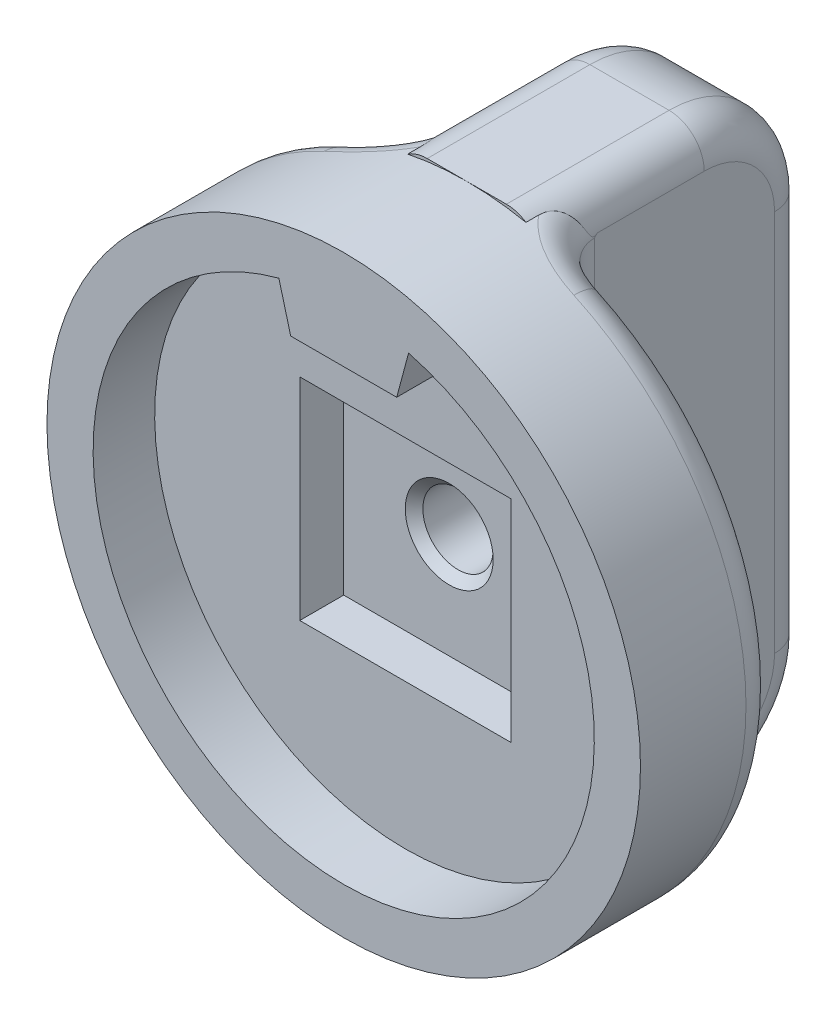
ISO-10303-21;
HEADER;
FILE_DESCRIPTION(('STEP AP214'),'2;1');
FILE_NAME('part.step','',(''),(''),'','','');
FILE_SCHEMA(('AUTOMOTIVE_DESIGN { 1 0 10303 214 1 1 1 1 }'));
ENDSEC;
DATA;
#1=APPLICATION_CONTEXT('core data for automotive mechanical design processes');
#2=APPLICATION_PROTOCOL_DEFINITION('international standard','automotive_design',2000,#1);
#3=PRODUCT_CONTEXT('',#1,'mechanical');
#4=PRODUCT('Part','Part','',(#3));
#5=PRODUCT_RELATED_PRODUCT_CATEGORY('part','',(#4));
#6=PRODUCT_DEFINITION_FORMATION('','',#4);
#7=PRODUCT_DEFINITION_CONTEXT('part definition',#1,'design');
#8=PRODUCT_DEFINITION('design','',#6,#7);
#9=PRODUCT_DEFINITION_SHAPE('','',#8);
#10=(LENGTH_UNIT() NAMED_UNIT(*) SI_UNIT(.MILLI.,.METRE.));
#11=(NAMED_UNIT(*) PLANE_ANGLE_UNIT() SI_UNIT($,.RADIAN.));
#12=(NAMED_UNIT(*) SI_UNIT($,.STERADIAN.) SOLID_ANGLE_UNIT());
#13=UNCERTAINTY_MEASURE_WITH_UNIT(LENGTH_MEASURE(1.E-05),#10,'distance_accuracy_value','');
#14=(GEOMETRIC_REPRESENTATION_CONTEXT(3) GLOBAL_UNCERTAINTY_ASSIGNED_CONTEXT((#13)) GLOBAL_UNIT_ASSIGNED_CONTEXT((#10,
#11,#12)) REPRESENTATION_CONTEXT('',''));
#15=CARTESIAN_POINT('',(0.,0.,0.));
#16=DIRECTION('',(0.,0.,1.));
#17=DIRECTION('',(1.,0.,0.));
#18=AXIS2_PLACEMENT_3D('',#15,#16,#17);
#19=CARTESIAN_POINT('',(0.,0.,16.));
#20=DIRECTION('',(0.,0.,-1.));
#21=DIRECTION('',(-1.,0.,0.));
#22=AXIS2_PLACEMENT_3D('',#19,#20,#21);
#23=CYLINDRICAL_SURFACE('',#22,33.75);
#24=DIRECTION('',(0.,0.,-1.));
#25=VECTOR('',#24,1.);
#26=CARTESIAN_POINT('',(6.72683369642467,-33.0728318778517,2.));
#27=LINE('',#26,#25);
#28=CARTESIAN_POINT('',(6.7268336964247,-33.0728318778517,2.));
#29=VERTEX_POINT('',#28);
#30=CARTESIAN_POINT('',(6.72683369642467,-33.0728318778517,0.56394262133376));
#31=VERTEX_POINT('',#30);
#32=EDGE_CURVE('E646',#29,#31,#27,.T.);
#33=ORIENTED_EDGE('',*,*,#32,.T.);
#34=CARTESIAN_POINT('',(8.67954383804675,-29.3504985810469,-5.18495346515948));
#35=CARTESIAN_POINT('',(8.72914053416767,-32.7642420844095,-5.34486016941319));
#36=CARTESIAN_POINT('',(5.51241038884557,-33.296784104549,-6.36990693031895));
#37=CARTESIAN_POINT('',(8.64680321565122,-29.3613226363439,-5.07943191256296));
#38=CARTESIAN_POINT('',(8.68692828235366,-32.7786012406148,-5.22435470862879));
#39=CARTESIAN_POINT('',(5.43812494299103,-33.3090634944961,-6.1588638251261));
#40=CARTESIAN_POINT('',(8.61844631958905,-29.3705027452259,-4.97251456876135));
#41=CARTESIAN_POINT('',(8.65058731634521,-32.7909604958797,-5.10258312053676));
#42=CARTESIAN_POINT('',(5.37378576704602,-33.3194779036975,-5.94502913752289));
#43=CARTESIAN_POINT('',(8.57066522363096,-29.3857644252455,-4.7566532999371));
#44=CARTESIAN_POINT('',(8.58956088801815,-32.8117131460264,-4.85713253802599));
#45=CARTESIAN_POINT('',(5.26537487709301,-33.3367915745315,-5.51330659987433));
#46=CARTESIAN_POINT('',(8.55124056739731,-29.3918461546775,-4.64770947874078));
#47=CARTESIAN_POINT('',(8.56488576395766,-32.8201030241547,-4.73347115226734));
#48=CARTESIAN_POINT('',(5.2213021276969,-33.3436910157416,-5.29541895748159));
#49=CARTESIAN_POINT('',(8.52148728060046,-29.4011010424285,-4.42856011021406));
#50=CARTESIAN_POINT('',(8.52714920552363,-32.8329354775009,-4.48501056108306));
#51=CARTESIAN_POINT('',(5.15379467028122,-33.3541902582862,-4.85712022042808));
#52=CARTESIAN_POINT('',(8.5111577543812,-29.4042744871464,-4.3183546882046));
#53=CARTESIAN_POINT('',(8.51409473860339,-32.8373756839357,-4.36023661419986));
#54=CARTESIAN_POINT('',(5.13035793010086,-33.3577903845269,-4.63670937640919));
#55=CARTESIAN_POINT('',(8.49965729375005,-29.4078007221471,-4.09748639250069));
#56=CARTESIAN_POINT('',(8.49956567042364,-32.8423175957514,-4.110271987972));
#57=CARTESIAN_POINT('',(5.10426444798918,-33.3617907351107,-4.19497278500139));
#58=CARTESIAN_POINT('',(8.49848624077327,-29.4081535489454,-3.98682352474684));
#59=CARTESIAN_POINT('',(8.49809428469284,-32.8428182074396,-3.98511002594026));
#60=CARTESIAN_POINT('',(5.1016074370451,-33.362191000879,-3.97364704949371));
#61=CARTESIAN_POINT('',(8.50879872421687,-29.4050096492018,-3.65423031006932));
#62=CARTESIAN_POINT('',(8.5110988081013,-32.8383943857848,-3.60878276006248));
#63=CARTESIAN_POINT('',(5.12500550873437,-33.3586243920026,-3.30846062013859));
#64=CARTESIAN_POINT('',(8.53422677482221,-29.3972744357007,-3.43257413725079));
#65=CARTESIAN_POINT('',(8.54312758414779,-32.8274986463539,-3.35791629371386));
#66=CARTESIAN_POINT('',(5.18269940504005,-33.3498491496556,-2.86514827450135));
#67=CARTESIAN_POINT('',(8.62142567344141,-29.3696346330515,-2.99700825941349));
#68=CARTESIAN_POINT('',(8.65429361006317,-32.78970377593,-2.86299766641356));
#69=CARTESIAN_POINT('',(5.38054564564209,-33.3184930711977,-1.99401651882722));
#70=CARTESIAN_POINT('',(8.68316500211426,-29.3497405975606,-2.78309200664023));
#71=CARTESIAN_POINT('',(8.73330320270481,-32.7628480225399,-2.61910777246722));
#72=CARTESIAN_POINT('',(5.52062647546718,-33.2959242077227,-1.56618401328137));
#73=CARTESIAN_POINT('',(8.82782707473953,-29.3001583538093,-2.40334918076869));
#74=CARTESIAN_POINT('',(8.9215048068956,-32.6987405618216,-2.18440359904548));
#75=CARTESIAN_POINT('',(5.8488513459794,-33.2396754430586,-0.80669836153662));
#76=CARTESIAN_POINT('',(8.90551893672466,-29.2726493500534,-2.23544164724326));
#77=CARTESIAN_POINT('',(9.02342584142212,-32.6639831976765,-1.99155063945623));
#78=CARTESIAN_POINT('',(6.0251269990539,-33.2084677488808,-0.470883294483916));
#79=CARTESIAN_POINT('',(9.08302405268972,-29.2060098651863,-1.91235501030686));
#80=CARTESIAN_POINT('',(9.25958460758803,-32.5830132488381,-1.62025246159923));
#81=CARTESIAN_POINT('',(6.4278696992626,-33.1328683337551,0.17528997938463));
#82=CARTESIAN_POINT('',(9.18284027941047,-29.1668778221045,-1.75717762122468));
#83=CARTESIAN_POINT('',(9.39384665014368,-32.5367926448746,-1.44171406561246));
#84=CARTESIAN_POINT('',(6.654343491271,-33.0884748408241,0.485644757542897));
#85=CARTESIAN_POINT('',(9.42490829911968,-29.065704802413,-1.43236294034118));
#86=CARTESIAN_POINT('',(9.7239752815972,-32.4219975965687,-1.06995791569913));
#87=CARTESIAN_POINT('',(7.20357345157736,-32.9736987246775,1.13527411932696));
#88=CARTESIAN_POINT('',(9.57166483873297,-29.0006109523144,-1.26629034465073));
#89=CARTESIAN_POINT('',(9.92706860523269,-32.3506996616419,-0.880955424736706));
#90=CARTESIAN_POINT('',(7.53655047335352,-32.8998527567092,1.46741931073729));
#91=CARTESIAN_POINT('',(9.88900992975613,-28.8478637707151,-0.961719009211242));
#92=CARTESIAN_POINT('',(10.3724968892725,-32.1911954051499,-0.542050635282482));
#93=CARTESIAN_POINT('',(8.2565771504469,-32.7265681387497,2.07656198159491));
#94=CARTESIAN_POINT('',(10.0596099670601,-28.7601995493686,-0.82323363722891));
#95=CARTESIAN_POINT('',(10.615460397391,-32.1027579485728,-0.39181633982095));
#96=CARTESIAN_POINT('',(8.64365286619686,-32.6271171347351,2.35353272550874));
#97=CARTESIAN_POINT('',(10.418412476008,-28.5604305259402,-0.577393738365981));
#98=CARTESIAN_POINT('',(11.1314657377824,-31.9099489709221,-0.13957068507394));
#99=CARTESIAN_POINT('',(9.45774259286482,-32.400488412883,2.84521252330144));
#100=CARTESIAN_POINT('',(10.6065960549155,-28.4483517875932,-0.470006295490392));
#101=CARTESIAN_POINT('',(11.4054740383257,-31.8051999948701,-0.0373057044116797));
#102=CARTESIAN_POINT('',(9.8847137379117,-32.2733402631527,3.05998740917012));
#103=CARTESIAN_POINT('',(10.9942124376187,-28.1992530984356,-0.288067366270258));
#104=CARTESIAN_POINT('',(11.9724265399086,-31.5818545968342,0.112881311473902));
#105=CARTESIAN_POINT('',(10.7641794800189,-31.9907493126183,3.4238652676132));
#106=CARTESIAN_POINT('',(11.193641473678,-28.0622414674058,-0.213504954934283));
#107=CARTESIAN_POINT('',(12.2666554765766,-31.462701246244,0.16067143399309));
#108=CARTESIAN_POINT('',(11.2166655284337,-31.8353159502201,3.57299009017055));
#109=CARTESIAN_POINT('',(11.6022070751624,-27.7609805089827,-0.0961282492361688));
#110=CARTESIAN_POINT('',(12.8687527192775,-31.2111975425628,0.199394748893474));
#111=CARTESIAN_POINT('',(12.1436631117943,-31.4935493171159,3.80774350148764));
#112=CARTESIAN_POINT('',(11.8114614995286,-27.5961736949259,-0.0540894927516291));
#113=CARTESIAN_POINT('',(13.1781629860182,-31.077926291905,0.188296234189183));
#114=CARTESIAN_POINT('',(12.6184420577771,-31.3065836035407,3.89182101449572));
#115=CARTESIAN_POINT('',(12.2296404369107,-27.2441569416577,-0.00358625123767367));
#116=CARTESIAN_POINT('',(13.7913725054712,-30.8058522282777,0.106198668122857));
#117=CARTESIAN_POINT('',(13.5672514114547,-30.9072368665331,3.99282749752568));
#118=CARTESIAN_POINT('',(12.438564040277,-27.056915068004,0.0048297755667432));
#119=CARTESIAN_POINT('',(14.0965051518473,-30.6663005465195,0.0338319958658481));
#120=CARTESIAN_POINT('',(14.041279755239,-30.6948196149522,4.00965955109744));
#121=CARTESIAN_POINT('',(12.7566089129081,-26.7540777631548,-0.00666148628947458));
#122=CARTESIAN_POINT('',(14.550879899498,-30.4534421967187,-0.120801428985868));
#123=CARTESIAN_POINT('',(14.7628941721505,-30.3512646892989,3.98667702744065));
#124=CARTESIAN_POINT('',(12.8677826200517,-26.6447619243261,-0.0153999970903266));
#125=CARTESIAN_POINT('',(14.7092477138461,-30.3782140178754,-0.184334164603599));
#126=CARTESIAN_POINT('',(15.0151370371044,-30.2272509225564,3.96920000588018));
#127=CARTESIAN_POINT('',(13.0879189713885,-26.4214832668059,-0.0418904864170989));
#128=CARTESIAN_POINT('',(15.0190620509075,-30.2294772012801,-0.327640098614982));
#129=CARTESIAN_POINT('',(15.5146060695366,-29.9739516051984,3.91621902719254));
#130=CARTESIAN_POINT('',(13.1968811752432,-26.3075195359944,-0.059644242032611));
#131=CARTESIAN_POINT('',(15.1706122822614,-30.1558955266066,-0.407743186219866));
#132=CARTESIAN_POINT('',(15.7618312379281,-29.8446650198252,3.88071151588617));
#133=CARTESIAN_POINT('',(13.4116712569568,-26.0761133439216,-0.103739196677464));
#134=CARTESIAN_POINT('',(15.4644873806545,-30.0121759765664,-0.583035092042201));
#135=CARTESIAN_POINT('',(16.2491700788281,-29.5821453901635,3.79252160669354));
#136=CARTESIAN_POINT('',(13.5175073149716,-25.9586819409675,-0.130055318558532));
#137=CARTESIAN_POINT('',(15.6068908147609,-29.9419858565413,-0.678537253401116));
#138=CARTESIAN_POINT('',(16.4893023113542,-29.4489248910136,3.73988936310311));
#139=CARTESIAN_POINT('',(13.7258728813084,-25.7209171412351,-0.190931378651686));
#140=CARTESIAN_POINT('',(15.881272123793,-29.8064549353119,-0.883617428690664));
#141=CARTESIAN_POINT('',(16.9620645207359,-29.179191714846,3.61813724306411));
#142=CARTESIAN_POINT('',(13.8284040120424,-25.6005852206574,-0.2254871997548));
#143=CARTESIAN_POINT('',(16.0132388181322,-29.7411145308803,-0.99356023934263));
#144=CARTESIAN_POINT('',(17.1946981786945,-29.0426807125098,3.54902560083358));
#145=CARTESIAN_POINT('',(13.929085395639,-25.4791893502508,-0.263997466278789));
#146=CARTESIAN_POINT('',(16.1378525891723,-29.6796963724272,-1.10888900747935));
#147=CARTESIAN_POINT('',(17.4231349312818,-28.9049627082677,3.47200506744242));
#148=(BOUNDED_SURFACE() B_SPLINE_SURFACE(3,2,((#34,#35,#36),(#37,#38,#39),(#40,#41,#42),(#43,
#44,#45),(#46,#47,#48),(#49,#50,#51),(#52,#53,#54),(#55,#56,#57),(#58,#59,#60),(#61,#62,#63),
(#64,#65,#66),(#67,#68,#69),(#70,#71,#72),(#73,#74,#75),(#76,#77,#78),(#79,#80,#81),(#82,#83,
#84),(#85,#86,#87),(#88,#89,#90),(#91,#92,#93),(#94,#95,#96),(#97,#98,#99),(#100,#101,#102),
(#103,#104,#105),(#106,#107,#108),(#109,#110,#111),(#112,#113,#114),(#115,#116,#117),(#118,#119,
#120),(#121,#122,#123),(#124,#125,#126),(#127,#128,#129),(#130,#131,#132),(#133,#134,#135),
(#136,#137,#138),(#139,#140,#141),(#142,#143,#144),(#145,#146,#147)),.UNSPECIFIED.,.F.,.F.,
.F.) B_SPLINE_SURFACE_WITH_KNOTS((4,2,2,2,2,2,2,2,2,2,2,2,2,2,2,2,2,2,4),(3,3),(0.,
0.66348294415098,1.32693198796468,1.9903156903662,2.65369080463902,3.98569604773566,
5.31654677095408,6.42605672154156,7.53571584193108,8.87302758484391,10.2109857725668,
11.5475225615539,12.8836141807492,14.2506594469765,15.6196742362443,16.364196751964,
17.1088660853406,17.8513737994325,18.5935112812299),(0.,1.),
.UNSPECIFIED.) GEOMETRIC_REPRESENTATION_ITEM() RATIONAL_B_SPLINE_SURFACE(((1.,0.760262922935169,
1.),(1.,0.760009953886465,1.),(1.,0.759775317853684,1.),(1.,0.759363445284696,1.),(1.,
0.759186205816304,1.),(1.,0.758909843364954,1.),(1.,0.758810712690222,1.),(1.,0.758699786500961,
1.),(1.,0.758687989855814,1.),(1.,0.758788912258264,1.),(1.,0.75903911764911,1.),(1.,
0.759807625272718,1.),(1.,0.760325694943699,1.),(1.,0.761304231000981,1.),(1.,0.761759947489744,
1.),(1.,0.762505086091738,1.),(1.,0.762794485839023,1.),(1.,0.763013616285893,1.),(1.,
0.762857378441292,1.),(1.,0.761613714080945,1.),(1.,0.76052583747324,1.),(1.,0.757091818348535,
1.),(1.,0.754747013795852,1.),(1.,0.748569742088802,1.),(1.,0.744737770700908,1.),(1.,
0.73536452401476,1.),(1.,0.729785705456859,1.),(1.,0.71693396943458,1.),(1.,0.70965862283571,
1.),(1.,0.697204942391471,1.),(1.,0.692583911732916,1.),(1.,0.682892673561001,1.),(1.,
0.677822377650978,1.),(1.,0.667276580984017,1.),(1.,0.661802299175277,1.),(1.,0.650470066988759,
1.),(1.,0.644612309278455,1.),(1.,0.638577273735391,1.))) REPRESENTATION_ITEM('') SURFACE());
#149=CARTESIAN_POINT('',(5.51241038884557,-33.296784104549,-6.36990693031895));
#150=CARTESIAN_POINT('',(5.43812494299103,-33.3090634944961,-6.1588638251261));
#151=CARTESIAN_POINT('',(5.37378576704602,-33.3194779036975,-5.94502913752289));
#152=CARTESIAN_POINT('',(5.26537487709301,-33.3367915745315,-5.51330659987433));
#153=CARTESIAN_POINT('',(5.2213021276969,-33.3436910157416,-5.29541895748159));
#154=CARTESIAN_POINT('',(5.15379467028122,-33.3541902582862,-4.85712022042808));
#155=CARTESIAN_POINT('',(5.13035793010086,-33.3577903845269,-4.63670937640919));
#156=CARTESIAN_POINT('',(5.10426444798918,-33.3617907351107,-4.19497278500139));
#157=CARTESIAN_POINT('',(5.1016074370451,-33.362191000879,-3.97364704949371));
#158=CARTESIAN_POINT('',(5.12500550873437,-33.3586243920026,-3.30846062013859));
#159=CARTESIAN_POINT('',(5.18269940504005,-33.3498491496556,-2.86514827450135));
#160=CARTESIAN_POINT('',(5.38054564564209,-33.3184930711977,-1.99401651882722));
#161=CARTESIAN_POINT('',(5.52062647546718,-33.2959242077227,-1.56618401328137));
#162=CARTESIAN_POINT('',(5.8488513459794,-33.2396754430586,-0.80669836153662));
#163=CARTESIAN_POINT('',(6.0251269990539,-33.2084677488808,-0.470883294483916));
#164=CARTESIAN_POINT('',(6.4278696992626,-33.1328683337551,0.17528997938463));
#165=CARTESIAN_POINT('',(6.654343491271,-33.0884748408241,0.485644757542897));
#166=CARTESIAN_POINT('',(7.20357345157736,-32.9736987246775,1.13527411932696));
#167=CARTESIAN_POINT('',(7.53655047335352,-32.8998527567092,1.46741931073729));
#168=CARTESIAN_POINT('',(8.2565771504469,-32.7265681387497,2.07656198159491));
#169=CARTESIAN_POINT('',(8.64365286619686,-32.6271171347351,2.35353272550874));
#170=CARTESIAN_POINT('',(9.45774259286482,-32.400488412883,2.84521252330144));
#171=CARTESIAN_POINT('',(9.8847137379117,-32.2733402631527,3.05998740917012));
#172=CARTESIAN_POINT('',(10.7641794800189,-31.9907493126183,3.4238652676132));
#173=CARTESIAN_POINT('',(11.2166655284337,-31.8353159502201,3.57299009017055));
#174=CARTESIAN_POINT('',(12.1436631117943,-31.4935493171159,3.80774350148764));
#175=CARTESIAN_POINT('',(12.6184420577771,-31.3065836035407,3.89182101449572));
#176=CARTESIAN_POINT('',(13.5672514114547,-30.9072368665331,3.99282749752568));
#177=CARTESIAN_POINT('',(14.041279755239,-30.6948196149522,4.00965955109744));
#178=CARTESIAN_POINT('',(14.7628941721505,-30.3512646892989,3.98667702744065));
#179=CARTESIAN_POINT('',(15.0151370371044,-30.2272509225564,3.96920000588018));
#180=CARTESIAN_POINT('',(15.5146060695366,-29.9739516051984,3.91621902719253));
#181=CARTESIAN_POINT('',(15.7618312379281,-29.8446650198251,3.88071151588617));
#182=CARTESIAN_POINT('',(16.2491700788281,-29.5821453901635,3.79252160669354));
#183=CARTESIAN_POINT('',(16.4893023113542,-29.4489248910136,3.73988936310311));
#184=CARTESIAN_POINT('',(16.9620645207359,-29.179191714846,3.61813724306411));
#185=CARTESIAN_POINT('',(17.1946981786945,-29.0426807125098,3.54902560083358));
#186=CARTESIAN_POINT('',(17.4231349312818,-28.9049627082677,3.47200506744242));
#187=B_SPLINE_CURVE_WITH_KNOTS('',3,(#149,#150,#151,#152,#153,#154,#155,#156,#157,#158,#159,
#160,#161,#162,#163,#164,#165,#166,#167,#168,#169,#170,#171,#172,#173,#174,#175,#176,#177,#178,
#179,#180,#181,#182,#183,#184,#185,#186),.UNSPECIFIED.,.F.,.F.,(4,2,2,2,2,2,2,2,2,2,2,2,2,2,2,2,
2,2,4),(0.,0.66348294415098,1.32693198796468,1.9903156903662,2.65369080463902,3.98569604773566,
5.31654677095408,6.42605672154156,7.53571584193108,8.87302758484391,10.2109857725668,
11.5475225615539,12.8836141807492,14.2506594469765,15.6196742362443,16.364196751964,
17.1088660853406,17.8513737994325,18.5935112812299),.UNSPECIFIED.);
#188=CARTESIAN_POINT('',(14.1806722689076,-30.6263127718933,4.));
#189=VERTEX_POINT('',#188);
#190=EDGE_CURVE('E732',#31,#189,#187,.T.);
#191=ORIENTED_EDGE('',*,*,#190,.T.);
#192=CARTESIAN_POINT('',(0.,0.,4.));
#193=DIRECTION('',(0.,0.,1.));
#194=DIRECTION('',(1.,0.,0.));
#195=AXIS2_PLACEMENT_3D('',#192,#193,#194);
#196=CIRCLE('',#195,33.75);
#197=CARTESIAN_POINT('',(14.1806722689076,30.6263127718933,4.));
#198=VERTEX_POINT('',#197);
#199=EDGE_CURVE('E725',#189,#198,#196,.T.);
#200=ORIENTED_EDGE('',*,*,#199,.T.);
#201=CARTESIAN_POINT('',(13.1444346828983,26.3615170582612,-0.0522533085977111));
#202=CARTESIAN_POINT('',(15.0960075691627,30.1919507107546,-0.370830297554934));
#203=CARTESIAN_POINT('',(15.6428349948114,29.9059227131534,3.89549338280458));
#204=CARTESIAN_POINT('',(13.016551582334,26.4953551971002,-0.0313649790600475));
#205=CARTESIAN_POINT('',(14.9200084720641,30.277376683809,-0.277611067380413));
#206=CARTESIAN_POINT('',(15.3526800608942,30.0577558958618,3.93727004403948));
#207=CARTESIAN_POINT('',(12.8868467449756,26.6262496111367,-0.0165849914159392));
#208=CARTESIAN_POINT('',(14.7367698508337,30.3652696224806,-0.194639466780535));
#209=CARTESIAN_POINT('',(15.0583917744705,30.2062495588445,3.96683001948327));
#210=CARTESIAN_POINT('',(12.6247833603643,26.8811323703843,0.000207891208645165));
#211=CARTESIAN_POINT('',(14.3626141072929,30.5420512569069,-0.0525631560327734));
#212=CARTESIAN_POINT('',(14.4637941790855,30.4954022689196,4.000415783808));
#213=CARTESIAN_POINT('',(12.4924222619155,27.0051135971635,0.00220785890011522));
#214=CARTESIAN_POINT('',(14.1714614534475,30.6310883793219,0.00700891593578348));
#215=CARTESIAN_POINT('',(14.1634790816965,30.63605324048,4.00441571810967));
#216=CARTESIAN_POINT('',(12.2259581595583,27.2451833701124,-0.00716623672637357));
#217=CARTESIAN_POINT('',(13.7842457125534,30.8082452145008,0.101353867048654));
#218=CARTESIAN_POINT('',(13.5588966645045,30.9084013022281,3.98566752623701));
#219=CARTESIAN_POINT('',(12.0918515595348,27.3612508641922,-0.0185746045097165));
#220=CARTESIAN_POINT('',(13.5878597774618,30.8965458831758,0.136478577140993));
#221=CARTESIAN_POINT('',(13.2546211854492,31.0400745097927,3.96285079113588));
#222=CARTESIAN_POINT('',(11.8236633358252,27.5841227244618,-0.0552729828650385));
#223=CARTESIAN_POINT('',(13.194148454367,31.0702020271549,0.181331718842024));
#224=CARTESIAN_POINT('',(12.6461268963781,31.2929123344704,3.88945403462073));
#225=CARTESIAN_POINT('',(11.6895817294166,27.690931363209,-0.0805565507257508));
#226=CARTESIAN_POINT('',(12.9964641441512,31.1557541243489,0.191391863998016));
#227=CARTESIAN_POINT('',(12.3419081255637,31.4140817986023,3.83888689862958));
#228=CARTESIAN_POINT('',(11.4387313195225,27.8825062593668,-0.141458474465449));
#229=CARTESIAN_POINT('',(12.6266252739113,31.3126999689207,0.186588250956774));
#230=CARTESIAN_POINT('',(11.7727517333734,31.6314146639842,3.71708305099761));
#231=CARTESIAN_POINT('',(11.3217908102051,27.9683853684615,-0.175500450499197));
#232=CARTESIAN_POINT('',(12.4541057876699,31.3846404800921,0.174696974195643));
#233=CARTESIAN_POINT('',(11.5074245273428,31.728840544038,3.64899909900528));
#234=CARTESIAN_POINT('',(11.0902614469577,28.1320146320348,-0.254656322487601));
#235=CARTESIAN_POINT('',(12.1133438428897,31.5243375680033,0.131788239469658));
#236=CARTESIAN_POINT('',(10.9821058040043,31.9144703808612,3.49068735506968));
#237=CARTESIAN_POINT('',(10.9756723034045,28.2097657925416,-0.299768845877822));
#238=CARTESIAN_POINT('',(11.9448342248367,31.5922195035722,0.1008652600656));
#239=CARTESIAN_POINT('',(10.7221136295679,32.002675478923,3.40046230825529));
#240=CARTESIAN_POINT('',(10.7503216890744,28.3567803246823,-0.400855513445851));
#241=CARTESIAN_POINT('',(11.6147895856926,31.7230273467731,0.0207827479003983));
#242=CARTESIAN_POINT('',(10.2108139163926,32.1694566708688,3.19828897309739));
#243=CARTESIAN_POINT('',(10.6395519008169,28.4260631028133,-0.456804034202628));
#244=CARTESIAN_POINT('',(11.4529897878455,31.7860741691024,-0.0282957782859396));
#245=CARTESIAN_POINT('',(9.95948750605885,32.2480547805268,3.08639193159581));
#246=CARTESIAN_POINT('',(10.422799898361,28.5563423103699,-0.579366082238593));
#247=CARTESIAN_POINT('',(11.1381242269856,31.9069392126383,-0.143562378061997));
#248=CARTESIAN_POINT('',(9.46769724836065,32.3958505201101,2.84126783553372));
#249=CARTESIAN_POINT('',(10.316817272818,28.6173394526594,-0.645978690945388));
#250=CARTESIAN_POINT('',(10.984833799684,31.9648507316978,-0.209756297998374));
#251=CARTESIAN_POINT('',(9.22723246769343,32.4650489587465,2.70804261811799));
#252=CARTESIAN_POINT('',(10.1190718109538,28.7266832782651,-0.783709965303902));
#253=CARTESIAN_POINT('',(10.7006992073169,32.0707744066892,-0.351921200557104));
#254=CARTESIAN_POINT('',(8.77856629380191,32.5890944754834,2.43258006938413));
#255=CARTESIAN_POINT('',(10.0268488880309,28.7756507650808,-0.854046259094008));
#256=CARTESIAN_POINT('',(10.5689135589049,32.1192579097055,-0.426712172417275));
#257=CARTESIAN_POINT('',(8.56932100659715,32.6446458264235,2.29190748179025));
#258=CARTESIAN_POINT('',(9.84836349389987,28.866998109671,-1.00294536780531));
#259=CARTESIAN_POINT('',(10.3156156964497,32.2114632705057,-0.588295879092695));
#260=CARTESIAN_POINT('',(8.16435414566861,32.7482751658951,1.99410926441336));
#261=CARTESIAN_POINT('',(9.76210316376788,28.9093756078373,-1.08151111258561));
#262=CARTESIAN_POINT('',(10.1939914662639,32.2552270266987,-0.675139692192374));
#263=CARTESIAN_POINT('',(7.96863742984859,32.7963504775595,1.83697777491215));
#264=CARTESIAN_POINT('',(9.59642328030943,28.9878821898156,-1.24629565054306));
#265=CARTESIAN_POINT('',(9.96212911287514,32.3379330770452,-0.859409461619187));
#266=CARTESIAN_POINT('',(7.59272508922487,32.8854125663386,1.50740869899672));
#267=CARTESIAN_POINT('',(9.51700449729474,29.0240105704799,-1.33251530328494));
#268=CARTESIAN_POINT('',(9.85180781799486,32.3769055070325,-0.956889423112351));
#269=CARTESIAN_POINT('',(7.41253121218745,32.9263985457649,1.33496939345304));
#270=CARTESIAN_POINT('',(9.36578531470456,29.0904452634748,-1.51193045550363));
#271=CARTESIAN_POINT('',(9.64336322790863,32.450041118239,-1.16095190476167));
#272=CARTESIAN_POINT('',(7.06942886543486,33.0017656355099,0.976139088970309));
#273=CARTESIAN_POINT('',(9.29398771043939,29.1207494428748,-1.60512849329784));
#274=CARTESIAN_POINT('',(9.54518942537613,32.4842219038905,-1.26758851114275));
#275=CARTESIAN_POINT('',(6.90652673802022,33.0361443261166,0.789743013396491));
#276=CARTESIAN_POINT('',(9.09987548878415,29.2000363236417,-1.8816324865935));
#277=CARTESIAN_POINT('',(9.28181567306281,32.5754830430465,-1.58465986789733));
#278=CARTESIAN_POINT('',(6.46610405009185,33.1260916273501,0.236735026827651));
#279=CARTESIAN_POINT('',(8.9878907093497,29.2423613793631,-2.07285266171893));
#280=CARTESIAN_POINT('',(9.13244136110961,32.6266731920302,-1.80489521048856));
#281=CARTESIAN_POINT('',(6.21202093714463,33.1741074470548,-0.145705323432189));
#282=CARTESIAN_POINT('',(8.79692788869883,29.311312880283,-2.47154937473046));
#283=CARTESIAN_POINT('',(8.8807489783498,32.7126713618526,-2.26262851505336));
#284=CARTESIAN_POINT('',(5.77874394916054,33.2523297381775,-0.943098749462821));
#285=CARTESIAN_POINT('',(8.71793544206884,29.33794617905,-2.67901877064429));
#286=CARTESIAN_POINT('',(8.77843263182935,32.7474785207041,-2.50021564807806));
#287=CARTESIAN_POINT('',(5.5995173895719,33.2825439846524,-1.35803754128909));
#288=CARTESIAN_POINT('',(8.59526649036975,29.3781704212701,-3.10442185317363));
#289=CARTESIAN_POINT('',(8.62066120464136,32.8011402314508,-2.9853210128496));
#290=CARTESIAN_POINT('',(5.32119287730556,33.3281765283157,-2.20884370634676));
#291=CARTESIAN_POINT('',(8.55158691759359,29.3917624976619,-3.32235462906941));
#292=CARTESIAN_POINT('',(8.56529615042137,32.8199641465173,-3.23274664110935));
#293=CARTESIAN_POINT('',(5.2220879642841,33.3435961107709,-2.64470925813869));
#294=CARTESIAN_POINT('',(8.50090384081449,29.407466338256,-3.76271541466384));
#295=CARTESIAN_POINT('',(8.50107360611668,32.8418024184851,-3.73174547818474));
#296=CARTESIAN_POINT('',(5.10709274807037,33.3614113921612,-3.52543082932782));
#297=CARTESIAN_POINT('',(8.49391045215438,29.4095749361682,-3.98514464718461));
#298=CARTESIAN_POINT('',(8.49228649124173,32.8447928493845,-3.98310194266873));
#299=CARTESIAN_POINT('',(5.09122539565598,33.3638034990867,-3.97028929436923));
#300=CARTESIAN_POINT('',(8.5110528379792,29.4043005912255,-4.31731954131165));
#301=CARTESIAN_POINT('',(8.51397088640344,32.8374181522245,-4.35906614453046));
#302=CARTESIAN_POINT('',(5.1301198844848,33.3578199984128,-4.63463908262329));
#303=CARTESIAN_POINT('',(8.52140805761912,29.4011253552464,-4.42796136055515));
#304=CARTESIAN_POINT('',(8.52705006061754,32.8329695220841,-4.48433453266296));
#305=CARTESIAN_POINT('',(5.15361492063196,33.3542178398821,-4.85592272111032));
#306=CARTESIAN_POINT('',(8.55127817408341,29.3918347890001,-4.64800165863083));
#307=CARTESIAN_POINT('',(8.56493207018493,32.8200869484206,-4.73379924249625));
#308=CARTESIAN_POINT('',(5.22138745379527,33.3436781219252,-5.29600331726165));
#309=CARTESIAN_POINT('',(8.57079315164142,29.3857194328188,-4.75740012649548));
#310=CARTESIAN_POINT('',(8.58972684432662,32.8116557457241,-4.85797039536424));
#311=CARTESIAN_POINT('',(5.26566513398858,33.3367405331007,-5.51480025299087));
#312=CARTESIAN_POINT('',(8.61885816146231,29.3703754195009,-4.97420415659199));
#313=CARTESIAN_POINT('',(8.65111045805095,32.7907835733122,-5.10451502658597));
#314=CARTESIAN_POINT('',(5.37472019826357,33.3193334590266,-5.94840831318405));
#315=CARTESIAN_POINT('',(8.64741392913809,29.3611447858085,-5.0816084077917));
#316=CARTESIAN_POINT('',(8.68769554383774,32.778343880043,-5.22686904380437));
#317=CARTESIAN_POINT('',(5.43951059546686,33.3088617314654,-6.16321681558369));
#318=CARTESIAN_POINT('',(8.7133208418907,29.3393069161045,-5.29360248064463));
#319=CARTESIAN_POINT('',(8.77268098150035,32.7494273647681,-5.46882478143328));
#320=CARTESIAN_POINT('',(5.58904728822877,33.2840876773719,-6.58720496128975));
#321=CARTESIAN_POINT('',(8.75067254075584,29.3266994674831,-5.39819212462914));
#322=CARTESIAN_POINT('',(8.82107079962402,32.7329541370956,-5.58841839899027));
#323=CARTESIAN_POINT('',(5.67379484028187,33.2697851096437,-6.79638424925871));
#324=CARTESIAN_POINT('',(8.79230244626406,29.3122720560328,-5.50099262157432));
#325=CARTESIAN_POINT('',(8.87540238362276,32.7144406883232,-5.70626307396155));
#326=CARTESIAN_POINT('',(5.76824924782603,33.2534178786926,-7.00198524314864));
#327=(BOUNDED_SURFACE() B_SPLINE_SURFACE(3,2,((#201,#202,#203),(#204,#205,#206),(#207,#208,
#209),(#210,#211,#212),(#213,#214,#215),(#216,#217,#218),(#219,#220,#221),(#222,#223,#224),
(#225,#226,#227),(#228,#229,#230),(#231,#232,#233),(#234,#235,#236),(#237,#238,#239),(#240,#241,
#242),(#243,#244,#245),(#246,#247,#248),(#249,#250,#251),(#252,#253,#254),(#255,#256,#257),
(#258,#259,#260),(#261,#262,#263),(#264,#265,#266),(#267,#268,#269),(#270,#271,#272),(#273,#274,
#275),(#276,#277,#278),(#279,#280,#281),(#282,#283,#284),(#285,#286,#287),(#288,#289,#290),
(#291,#292,#293),(#294,#295,#296),(#297,#298,#299),(#300,#301,#302),(#303,#304,#305),(#306,#307,
#308),(#309,#310,#311),(#312,#313,#314),(#315,#316,#317),(#318,#319,#320),(#321,#322,#323),
(#324,#325,#326)),.UNSPECIFIED.,.F.,.F.,.F.) B_SPLINE_SURFACE_WITH_KNOTS((4,2,2,2,2,2,2,2,2,2,2,
2,2,2,2,2,2,2,2,2,4),(3,3),(0.,0.874877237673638,1.75063929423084,2.62864682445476,
3.50624701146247,4.28003066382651,5.0537184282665,5.8255985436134,6.59741220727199,
7.3077067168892,8.01825497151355,8.72888312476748,9.4397710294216,10.7685197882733,
12.0966877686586,13.4247403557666,14.753159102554,15.4193314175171,16.0855096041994,
16.7521112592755,17.418754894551),(0.,1.),
.UNSPECIFIED.) GEOMETRIC_REPRESENTATION_ITEM() RATIONAL_B_SPLINE_SURFACE(((1.,0.680193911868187,
1.),(1.,0.686152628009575,1.),(1.,0.691808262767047,1.),(1.,0.702486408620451,1.),(1.,
0.707508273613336,1.),(1.,0.716891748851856,1.),(1.,0.721251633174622,1.),(1.,0.729276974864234,
1.),(1.,0.732942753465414,1.),(1.,0.739188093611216,1.),(1.,0.741844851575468,1.),(1.,
0.746631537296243,1.),(1.,0.748761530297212,1.),(1.,0.752515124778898,1.),(1.,0.754139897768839,
1.),(1.,0.756927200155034,1.),(1.,0.758089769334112,1.),(1.,0.759926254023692,1.),(1.,
0.760631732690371,1.),(1.,0.761740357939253,1.),(1.,0.762143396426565,1.),(1.,0.762699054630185,
1.),(1.,0.762851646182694,1.),(1.,0.762962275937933,1.),(1.,0.762920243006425,1.),(1.,
0.762602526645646,1.),(1.,0.762155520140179,1.),(1.,0.761139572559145,1.),(1.,0.760570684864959,
1.),(1.,0.759596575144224,1.),(1.,0.759191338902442,1.),(1.,0.758715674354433,1.),(1.,
0.758645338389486,1.),(1.,0.758809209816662,1.),(1.,0.758909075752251,1.),(1.,0.759186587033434,
1.),(1.,0.759364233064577,1.),(1.,0.759779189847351,1.),(1.,0.760016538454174,1.),(1.,
0.760521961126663,1.),(1.,0.760790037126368,1.),(1.,0.761059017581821,1.))) REPRESENTATION_ITEM('') SURFACE());
#328=CARTESIAN_POINT('',(15.6428349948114,29.9059227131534,3.89549338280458));
#329=CARTESIAN_POINT('',(15.3526800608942,30.0577558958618,3.93727004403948));
#330=CARTESIAN_POINT('',(15.0583917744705,30.2062495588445,3.96683001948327));
#331=CARTESIAN_POINT('',(14.4637941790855,30.4954022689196,4.000415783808));
#332=CARTESIAN_POINT('',(14.1634790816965,30.63605324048,4.00441571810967));
#333=CARTESIAN_POINT('',(13.5588966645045,30.9084013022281,3.98566752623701));
#334=CARTESIAN_POINT('',(13.2546211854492,31.0400745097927,3.96285079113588));
#335=CARTESIAN_POINT('',(12.6461268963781,31.2929123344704,3.88945403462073));
#336=CARTESIAN_POINT('',(12.3419081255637,31.4140817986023,3.83888689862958));
#337=CARTESIAN_POINT('',(11.7727517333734,31.6314146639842,3.71708305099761));
#338=CARTESIAN_POINT('',(11.5074245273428,31.728840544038,3.64899909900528));
#339=CARTESIAN_POINT('',(10.9821058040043,31.9144703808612,3.49068735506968));
#340=CARTESIAN_POINT('',(10.7221136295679,32.002675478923,3.40046230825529));
#341=CARTESIAN_POINT('',(10.2108139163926,32.1694566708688,3.19828897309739));
#342=CARTESIAN_POINT('',(9.95948750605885,32.2480547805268,3.08639193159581));
#343=CARTESIAN_POINT('',(9.46769724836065,32.3958505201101,2.84126783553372));
#344=CARTESIAN_POINT('',(9.22723246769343,32.4650489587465,2.70804261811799));
#345=CARTESIAN_POINT('',(8.77856629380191,32.5890944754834,2.43258006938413));
#346=CARTESIAN_POINT('',(8.56932100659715,32.6446458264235,2.29190748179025));
#347=CARTESIAN_POINT('',(8.16435414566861,32.7482751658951,1.99410926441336));
#348=CARTESIAN_POINT('',(7.96863742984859,32.7963504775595,1.83697777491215));
#349=CARTESIAN_POINT('',(7.59272508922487,32.8854125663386,1.50740869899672));
#350=CARTESIAN_POINT('',(7.41253121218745,32.9263985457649,1.33496939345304));
#351=CARTESIAN_POINT('',(7.06942886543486,33.0017656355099,0.976139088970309));
#352=CARTESIAN_POINT('',(6.90652673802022,33.0361443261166,0.789743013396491));
#353=CARTESIAN_POINT('',(6.46610405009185,33.1260916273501,0.236735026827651));
#354=CARTESIAN_POINT('',(6.21202093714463,33.1741074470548,-0.14570532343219));
#355=CARTESIAN_POINT('',(5.77874394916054,33.2523297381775,-0.943098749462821));
#356=CARTESIAN_POINT('',(5.5995173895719,33.2825439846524,-1.35803754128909));
#357=CARTESIAN_POINT('',(5.32119287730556,33.3281765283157,-2.20884370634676));
#358=CARTESIAN_POINT('',(5.2220879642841,33.3435961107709,-2.64470925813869));
#359=CARTESIAN_POINT('',(5.10709274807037,33.3614113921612,-3.52543082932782));
#360=CARTESIAN_POINT('',(5.09122539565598,33.3638034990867,-3.97028929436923));
#361=CARTESIAN_POINT('',(5.1301198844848,33.3578199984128,-4.63463908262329));
#362=CARTESIAN_POINT('',(5.15361492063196,33.3542178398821,-4.85592272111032));
#363=CARTESIAN_POINT('',(5.22138745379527,33.3436781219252,-5.29600331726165));
#364=CARTESIAN_POINT('',(5.26566513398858,33.3367405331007,-5.51480025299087));
#365=CARTESIAN_POINT('',(5.37472019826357,33.3193334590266,-5.94840831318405));
#366=CARTESIAN_POINT('',(5.43951059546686,33.3088617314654,-6.16321681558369));
#367=CARTESIAN_POINT('',(5.58904728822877,33.2840876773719,-6.58720496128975));
#368=CARTESIAN_POINT('',(5.67379484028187,33.2697851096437,-6.79638424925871));
#369=CARTESIAN_POINT('',(5.76824924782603,33.2534178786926,-7.00198524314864));
#370=B_SPLINE_CURVE_WITH_KNOTS('',3,(#328,#329,#330,#331,#332,#333,#334,#335,#336,#337,#338,
#339,#340,#341,#342,#343,#344,#345,#346,#347,#348,#349,#350,#351,#352,#353,#354,#355,#356,#357,
#358,#359,#360,#361,#362,#363,#364,#365,#366,#367,#368,#369),.UNSPECIFIED.,.F.,.F.,(4,2,2,2,2,2,
2,2,2,2,2,2,2,2,2,2,2,2,2,2,4),(0.,0.874877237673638,1.75063929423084,2.62864682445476,
3.50624701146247,4.28003066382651,5.0537184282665,5.8255985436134,6.59741220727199,
7.3077067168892,8.01825497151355,8.72888312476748,9.4397710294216,10.7685197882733,
12.0966877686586,13.4247403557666,14.753159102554,15.4193314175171,16.0855096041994,
16.7521112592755,17.418754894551),.UNSPECIFIED.);
#371=CARTESIAN_POINT('',(6.72683369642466,33.0728318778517,0.563942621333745));
#372=VERTEX_POINT('',#371);
#373=EDGE_CURVE('E727',#198,#372,#370,.T.);
#374=ORIENTED_EDGE('',*,*,#373,.T.);
#375=DIRECTION('',(0.,0.,1.));
#376=VECTOR('',#375,1.);
#377=CARTESIAN_POINT('',(6.72683369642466,33.0728318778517,0.));
#378=LINE('',#377,#376);
#379=CARTESIAN_POINT('',(6.7268336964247,33.0728318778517,2.));
#380=VERTEX_POINT('',#379);
#381=EDGE_CURVE('E519',#372,#380,#378,.T.);
#382=ORIENTED_EDGE('',*,*,#381,.T.);
#383=CARTESIAN_POINT('',(0.,0.,2.));
#384=DIRECTION('',(0.,0.,-1.));
#385=DIRECTION('',(-1.,0.,0.));
#386=AXIS2_PLACEMENT_3D('',#383,#384,#385);
#387=CIRCLE('',#386,33.75);
#388=CARTESIAN_POINT('',(0.,33.75,2.));
#389=VERTEX_POINT('',#388);
#390=EDGE_CURVE('E334',#389,#380,#387,.T.);
#391=ORIENTED_EDGE('',*,*,#390,.F.);
#392=CARTESIAN_POINT('',(-6.7268336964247,33.0728318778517,2.));
#393=VERTEX_POINT('',#392);
#394=EDGE_CURVE('E757',#393,#389,#387,.T.);
#395=ORIENTED_EDGE('',*,*,#394,.F.);
#396=DIRECTION('',(0.,0.,-1.));
#397=VECTOR('',#396,1.);
#398=CARTESIAN_POINT('',(-6.72683369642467,33.0728318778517,2.));
#399=LINE('',#398,#397);
#400=CARTESIAN_POINT('',(-6.72683369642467,33.0728318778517,0.563942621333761));
#401=VERTEX_POINT('',#400);
#402=EDGE_CURVE('E366',#393,#401,#399,.T.);
#403=ORIENTED_EDGE('',*,*,#402,.T.);
#404=CARTESIAN_POINT('',(-8.67954383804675,29.3504985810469,-5.18495346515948));
#405=CARTESIAN_POINT('',(-8.72914053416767,32.7642420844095,-5.34486016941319));
#406=CARTESIAN_POINT('',(-5.51241038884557,33.296784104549,-6.36990693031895));
#407=CARTESIAN_POINT('',(-8.64680321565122,29.3613226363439,-5.07943191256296));
#408=CARTESIAN_POINT('',(-8.68692828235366,32.7786012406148,-5.22435470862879));
#409=CARTESIAN_POINT('',(-5.43812494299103,33.3090634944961,-6.1588638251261));
#410=CARTESIAN_POINT('',(-8.61844631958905,29.3705027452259,-4.97251456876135));
#411=CARTESIAN_POINT('',(-8.65058731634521,32.7909604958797,-5.10258312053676));
#412=CARTESIAN_POINT('',(-5.37378576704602,33.3194779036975,-5.94502913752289));
#413=CARTESIAN_POINT('',(-8.57066522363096,29.3857644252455,-4.7566532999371));
#414=CARTESIAN_POINT('',(-8.58956088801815,32.8117131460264,-4.85713253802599));
#415=CARTESIAN_POINT('',(-5.26537487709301,33.3367915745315,-5.51330659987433));
#416=CARTESIAN_POINT('',(-8.55124056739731,29.3918461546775,-4.64770947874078));
#417=CARTESIAN_POINT('',(-8.56488576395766,32.8201030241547,-4.73347115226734));
#418=CARTESIAN_POINT('',(-5.2213021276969,33.3436910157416,-5.29541895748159));
#419=CARTESIAN_POINT('',(-8.52148728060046,29.4011010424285,-4.42856011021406));
#420=CARTESIAN_POINT('',(-8.52714920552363,32.8329354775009,-4.48501056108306));
#421=CARTESIAN_POINT('',(-5.15379467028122,33.3541902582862,-4.85712022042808));
#422=CARTESIAN_POINT('',(-8.5111577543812,29.4042744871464,-4.3183546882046));
#423=CARTESIAN_POINT('',(-8.51409473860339,32.8373756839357,-4.36023661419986));
#424=CARTESIAN_POINT('',(-5.13035793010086,33.3577903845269,-4.63670937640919));
#425=CARTESIAN_POINT('',(-8.49965729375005,29.4078007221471,-4.09748639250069));
#426=CARTESIAN_POINT('',(-8.49956567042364,32.8423175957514,-4.110271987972));
#427=CARTESIAN_POINT('',(-5.10426444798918,33.3617907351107,-4.19497278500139));
#428=CARTESIAN_POINT('',(-8.49848624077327,29.4081535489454,-3.98682352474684));
#429=CARTESIAN_POINT('',(-8.49809428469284,32.8428182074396,-3.98511002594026));
#430=CARTESIAN_POINT('',(-5.1016074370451,33.362191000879,-3.97364704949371));
#431=CARTESIAN_POINT('',(-8.50879872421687,29.4050096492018,-3.65423031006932));
#432=CARTESIAN_POINT('',(-8.5110988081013,32.8383943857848,-3.60878276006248));
#433=CARTESIAN_POINT('',(-5.12500550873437,33.3586243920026,-3.30846062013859));
#434=CARTESIAN_POINT('',(-8.53422677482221,29.3972744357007,-3.43257413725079));
#435=CARTESIAN_POINT('',(-8.54312758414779,32.8274986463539,-3.35791629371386));
#436=CARTESIAN_POINT('',(-5.18269940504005,33.3498491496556,-2.86514827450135));
#437=CARTESIAN_POINT('',(-8.62142567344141,29.3696346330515,-2.99700825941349));
#438=CARTESIAN_POINT('',(-8.65429361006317,32.78970377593,-2.86299766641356));
#439=CARTESIAN_POINT('',(-5.38054564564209,33.3184930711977,-1.99401651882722));
#440=CARTESIAN_POINT('',(-8.68316500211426,29.3497405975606,-2.78309200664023));
#441=CARTESIAN_POINT('',(-8.73330320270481,32.7628480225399,-2.61910777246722));
#442=CARTESIAN_POINT('',(-5.52062647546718,33.2959242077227,-1.56618401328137));
#443=CARTESIAN_POINT('',(-8.82782707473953,29.3001583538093,-2.40334918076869));
#444=CARTESIAN_POINT('',(-8.9215048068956,32.6987405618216,-2.18440359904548));
#445=CARTESIAN_POINT('',(-5.8488513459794,33.2396754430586,-0.80669836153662));
#446=CARTESIAN_POINT('',(-8.90551893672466,29.2726493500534,-2.23544164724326));
#447=CARTESIAN_POINT('',(-9.02342584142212,32.6639831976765,-1.99155063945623));
#448=CARTESIAN_POINT('',(-6.0251269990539,33.2084677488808,-0.470883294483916));
#449=CARTESIAN_POINT('',(-9.08302405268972,29.2060098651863,-1.91235501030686));
#450=CARTESIAN_POINT('',(-9.25958460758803,32.5830132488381,-1.62025246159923));
#451=CARTESIAN_POINT('',(-6.4278696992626,33.1328683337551,0.17528997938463));
#452=CARTESIAN_POINT('',(-9.18284027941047,29.1668778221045,-1.75717762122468));
#453=CARTESIAN_POINT('',(-9.39384665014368,32.5367926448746,-1.44171406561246));
#454=CARTESIAN_POINT('',(-6.654343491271,33.0884748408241,0.485644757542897));
#455=CARTESIAN_POINT('',(-9.42490829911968,29.065704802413,-1.43236294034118));
#456=CARTESIAN_POINT('',(-9.7239752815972,32.4219975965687,-1.06995791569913));
#457=CARTESIAN_POINT('',(-7.20357345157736,32.9736987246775,1.13527411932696));
#458=CARTESIAN_POINT('',(-9.57166483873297,29.0006109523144,-1.26629034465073));
#459=CARTESIAN_POINT('',(-9.92706860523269,32.3506996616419,-0.880955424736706));
#460=CARTESIAN_POINT('',(-7.53655047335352,32.8998527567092,1.46741931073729));
#461=CARTESIAN_POINT('',(-9.88900992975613,28.8478637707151,-0.961719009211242));
#462=CARTESIAN_POINT('',(-10.3724968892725,32.1911954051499,-0.542050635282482));
#463=CARTESIAN_POINT('',(-8.2565771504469,32.7265681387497,2.07656198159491));
#464=CARTESIAN_POINT('',(-10.0596099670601,28.7601995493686,-0.82323363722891));
#465=CARTESIAN_POINT('',(-10.615460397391,32.1027579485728,-0.39181633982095));
#466=CARTESIAN_POINT('',(-8.64365286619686,32.6271171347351,2.35353272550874));
#467=CARTESIAN_POINT('',(-10.418412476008,28.5604305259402,-0.577393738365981));
#468=CARTESIAN_POINT('',(-11.1314657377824,31.9099489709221,-0.13957068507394));
#469=CARTESIAN_POINT('',(-9.45774259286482,32.400488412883,2.84521252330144));
#470=CARTESIAN_POINT('',(-10.6065960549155,28.4483517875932,-0.470006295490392));
#471=CARTESIAN_POINT('',(-11.4054740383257,31.8051999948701,-0.0373057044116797));
#472=CARTESIAN_POINT('',(-9.8847137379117,32.2733402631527,3.05998740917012));
#473=CARTESIAN_POINT('',(-10.9942124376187,28.1992530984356,-0.288067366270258));
#474=CARTESIAN_POINT('',(-11.9724265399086,31.5818545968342,0.112881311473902));
#475=CARTESIAN_POINT('',(-10.7641794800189,31.9907493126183,3.4238652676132));
#476=CARTESIAN_POINT('',(-11.193641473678,28.0622414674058,-0.213504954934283));
#477=CARTESIAN_POINT('',(-12.2666554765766,31.462701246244,0.16067143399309));
#478=CARTESIAN_POINT('',(-11.2166655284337,31.8353159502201,3.57299009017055));
#479=CARTESIAN_POINT('',(-11.6022070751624,27.7609805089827,-0.0961282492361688));
#480=CARTESIAN_POINT('',(-12.8687527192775,31.2111975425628,0.199394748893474));
#481=CARTESIAN_POINT('',(-12.1436631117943,31.4935493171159,3.80774350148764));
#482=CARTESIAN_POINT('',(-11.8114614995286,27.5961736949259,-0.0540894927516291));
#483=CARTESIAN_POINT('',(-13.1781629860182,31.077926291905,0.188296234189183));
#484=CARTESIAN_POINT('',(-12.6184420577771,31.3065836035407,3.89182101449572));
#485=CARTESIAN_POINT('',(-12.2296404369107,27.2441569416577,-0.00358625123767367));
#486=CARTESIAN_POINT('',(-13.7913725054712,30.8058522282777,0.106198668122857));
#487=CARTESIAN_POINT('',(-13.5672514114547,30.9072368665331,3.99282749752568));
#488=CARTESIAN_POINT('',(-12.438564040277,27.056915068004,0.0048297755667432));
#489=CARTESIAN_POINT('',(-14.0965051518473,30.6663005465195,0.0338319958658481));
#490=CARTESIAN_POINT('',(-14.041279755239,30.6948196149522,4.00965955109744));
#491=CARTESIAN_POINT('',(-12.7566089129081,26.7540777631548,-0.00666148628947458));
#492=CARTESIAN_POINT('',(-14.550879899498,30.4534421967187,-0.120801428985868));
#493=CARTESIAN_POINT('',(-14.7628941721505,30.3512646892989,3.98667702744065));
#494=CARTESIAN_POINT('',(-12.8677826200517,26.6447619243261,-0.0153999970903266));
#495=CARTESIAN_POINT('',(-14.7092477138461,30.3782140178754,-0.184334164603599));
#496=CARTESIAN_POINT('',(-15.0151370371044,30.2272509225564,3.96920000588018));
#497=CARTESIAN_POINT('',(-13.0879189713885,26.4214832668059,-0.0418904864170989));
#498=CARTESIAN_POINT('',(-15.0190620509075,30.2294772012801,-0.327640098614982));
#499=CARTESIAN_POINT('',(-15.5146060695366,29.9739516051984,3.91621902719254));
#500=CARTESIAN_POINT('',(-13.1968811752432,26.3075195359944,-0.059644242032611));
#501=CARTESIAN_POINT('',(-15.1706122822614,30.1558955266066,-0.407743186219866));
#502=CARTESIAN_POINT('',(-15.7618312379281,29.8446650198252,3.88071151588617));
#503=CARTESIAN_POINT('',(-13.4116712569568,26.0761133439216,-0.103739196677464));
#504=CARTESIAN_POINT('',(-15.4644873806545,30.0121759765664,-0.583035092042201));
#505=CARTESIAN_POINT('',(-16.2491700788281,29.5821453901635,3.79252160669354));
#506=CARTESIAN_POINT('',(-13.5175073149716,25.9586819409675,-0.130055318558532));
#507=CARTESIAN_POINT('',(-15.6068908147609,29.9419858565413,-0.678537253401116));
#508=CARTESIAN_POINT('',(-16.4893023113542,29.4489248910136,3.73988936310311));
#509=CARTESIAN_POINT('',(-13.7258728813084,25.7209171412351,-0.190931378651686));
#510=CARTESIAN_POINT('',(-15.881272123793,29.8064549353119,-0.883617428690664));
#511=CARTESIAN_POINT('',(-16.9620645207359,29.179191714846,3.61813724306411));
#512=CARTESIAN_POINT('',(-13.8284040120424,25.6005852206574,-0.2254871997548));
#513=CARTESIAN_POINT('',(-16.0132388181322,29.7411145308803,-0.99356023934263));
#514=CARTESIAN_POINT('',(-17.1946981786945,29.0426807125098,3.54902560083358));
#515=CARTESIAN_POINT('',(-13.929085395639,25.4791893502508,-0.263997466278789));
#516=CARTESIAN_POINT('',(-16.1378525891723,29.6796963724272,-1.10888900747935));
#517=CARTESIAN_POINT('',(-17.4231349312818,28.9049627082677,3.47200506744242));
#518=(BOUNDED_SURFACE() B_SPLINE_SURFACE(3,2,((#404,#405,#406),(#407,#408,#409),(#410,#411,
#412),(#413,#414,#415),(#416,#417,#418),(#419,#420,#421),(#422,#423,#424),(#425,#426,#427),
(#428,#429,#430),(#431,#432,#433),(#434,#435,#436),(#437,#438,#439),(#440,#441,#442),(#443,#444,
#445),(#446,#447,#448),(#449,#450,#451),(#452,#453,#454),(#455,#456,#457),(#458,#459,#460),
(#461,#462,#463),(#464,#465,#466),(#467,#468,#469),(#470,#471,#472),(#473,#474,#475),(#476,#477,
#478),(#479,#480,#481),(#482,#483,#484),(#485,#486,#487),(#488,#489,#490),(#491,#492,#493),
(#494,#495,#496),(#497,#498,#499),(#500,#501,#502),(#503,#504,#505),(#506,#507,#508),(#509,#510,
#511),(#512,#513,#514),(#515,#516,#517)),.UNSPECIFIED.,.F.,.F.,
.F.) B_SPLINE_SURFACE_WITH_KNOTS((4,2,2,2,2,2,2,2,2,2,2,2,2,2,2,2,2,2,4),(3,3),(0.,
0.66348294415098,1.32693198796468,1.9903156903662,2.65369080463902,3.98569604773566,
5.31654677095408,6.42605672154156,7.53571584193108,8.87302758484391,10.2109857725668,
11.5475225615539,12.8836141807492,14.2506594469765,15.6196742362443,16.364196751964,
17.1088660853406,17.8513737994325,18.5935112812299),(0.,1.),
.UNSPECIFIED.) GEOMETRIC_REPRESENTATION_ITEM() RATIONAL_B_SPLINE_SURFACE(((1.,0.760262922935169,
1.),(1.,0.760009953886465,1.),(1.,0.759775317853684,1.),(1.,0.759363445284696,1.),(1.,
0.759186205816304,1.),(1.,0.758909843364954,1.),(1.,0.758810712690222,1.),(1.,0.758699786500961,
1.),(1.,0.758687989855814,1.),(1.,0.758788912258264,1.),(1.,0.75903911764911,1.),(1.,
0.759807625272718,1.),(1.,0.760325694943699,1.),(1.,0.761304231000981,1.),(1.,0.761759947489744,
1.),(1.,0.762505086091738,1.),(1.,0.762794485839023,1.),(1.,0.763013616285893,1.),(1.,
0.762857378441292,1.),(1.,0.761613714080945,1.),(1.,0.76052583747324,1.),(1.,0.757091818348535,
1.),(1.,0.754747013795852,1.),(1.,0.748569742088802,1.),(1.,0.744737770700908,1.),(1.,
0.73536452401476,1.),(1.,0.729785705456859,1.),(1.,0.71693396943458,1.),(1.,0.70965862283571,
1.),(1.,0.697204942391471,1.),(1.,0.692583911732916,1.),(1.,0.682892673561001,1.),(1.,
0.677822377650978,1.),(1.,0.667276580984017,1.),(1.,0.661802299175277,1.),(1.,0.650470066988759,
1.),(1.,0.644612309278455,1.),(1.,0.638577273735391,1.))) REPRESENTATION_ITEM('') SURFACE());
#519=CARTESIAN_POINT('',(-5.51241038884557,33.296784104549,-6.36990693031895));
#520=CARTESIAN_POINT('',(-5.43812494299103,33.3090634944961,-6.1588638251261));
#521=CARTESIAN_POINT('',(-5.37378576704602,33.3194779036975,-5.94502913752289));
#522=CARTESIAN_POINT('',(-5.26537487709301,33.3367915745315,-5.51330659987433));
#523=CARTESIAN_POINT('',(-5.2213021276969,33.3436910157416,-5.29541895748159));
#524=CARTESIAN_POINT('',(-5.15379467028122,33.3541902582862,-4.85712022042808));
#525=CARTESIAN_POINT('',(-5.13035793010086,33.3577903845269,-4.63670937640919));
#526=CARTESIAN_POINT('',(-5.10426444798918,33.3617907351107,-4.19497278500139));
#527=CARTESIAN_POINT('',(-5.1016074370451,33.362191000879,-3.97364704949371));
#528=CARTESIAN_POINT('',(-5.12500550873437,33.3586243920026,-3.30846062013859));
#529=CARTESIAN_POINT('',(-5.18269940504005,33.3498491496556,-2.86514827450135));
#530=CARTESIAN_POINT('',(-5.38054564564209,33.3184930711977,-1.99401651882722));
#531=CARTESIAN_POINT('',(-5.52062647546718,33.2959242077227,-1.56618401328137));
#532=CARTESIAN_POINT('',(-5.8488513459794,33.2396754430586,-0.80669836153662));
#533=CARTESIAN_POINT('',(-6.0251269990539,33.2084677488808,-0.470883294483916));
#534=CARTESIAN_POINT('',(-6.4278696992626,33.1328683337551,0.17528997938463));
#535=CARTESIAN_POINT('',(-6.654343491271,33.0884748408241,0.485644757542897));
#536=CARTESIAN_POINT('',(-7.20357345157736,32.9736987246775,1.13527411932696));
#537=CARTESIAN_POINT('',(-7.53655047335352,32.8998527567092,1.46741931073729));
#538=CARTESIAN_POINT('',(-8.2565771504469,32.7265681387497,2.07656198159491));
#539=CARTESIAN_POINT('',(-8.64365286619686,32.6271171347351,2.35353272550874));
#540=CARTESIAN_POINT('',(-9.45774259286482,32.400488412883,2.84521252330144));
#541=CARTESIAN_POINT('',(-9.8847137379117,32.2733402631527,3.05998740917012));
#542=CARTESIAN_POINT('',(-10.7641794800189,31.9907493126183,3.4238652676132));
#543=CARTESIAN_POINT('',(-11.2166655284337,31.8353159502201,3.57299009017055));
#544=CARTESIAN_POINT('',(-12.1436631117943,31.4935493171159,3.80774350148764));
#545=CARTESIAN_POINT('',(-12.6184420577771,31.3065836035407,3.89182101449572));
#546=CARTESIAN_POINT('',(-13.5672514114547,30.9072368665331,3.99282749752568));
#547=CARTESIAN_POINT('',(-14.041279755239,30.6948196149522,4.00965955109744));
#548=CARTESIAN_POINT('',(-14.7628941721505,30.3512646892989,3.98667702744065));
#549=CARTESIAN_POINT('',(-15.0151370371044,30.2272509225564,3.96920000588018));
#550=CARTESIAN_POINT('',(-15.5146060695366,29.9739516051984,3.91621902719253));
#551=CARTESIAN_POINT('',(-15.7618312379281,29.8446650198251,3.88071151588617));
#552=CARTESIAN_POINT('',(-16.2491700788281,29.5821453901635,3.79252160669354));
#553=CARTESIAN_POINT('',(-16.4893023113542,29.4489248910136,3.73988936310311));
#554=CARTESIAN_POINT('',(-16.9620645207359,29.179191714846,3.61813724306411));
#555=CARTESIAN_POINT('',(-17.1946981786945,29.0426807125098,3.54902560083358));
#556=CARTESIAN_POINT('',(-17.4231349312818,28.9049627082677,3.47200506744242));
#557=B_SPLINE_CURVE_WITH_KNOTS('',3,(#519,#520,#521,#522,#523,#524,#525,#526,#527,#528,#529,
#530,#531,#532,#533,#534,#535,#536,#537,#538,#539,#540,#541,#542,#543,#544,#545,#546,#547,#548,
#549,#550,#551,#552,#553,#554,#555,#556),.UNSPECIFIED.,.F.,.F.,(4,2,2,2,2,2,2,2,2,2,2,2,2,2,2,2,
2,2,4),(0.,0.66348294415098,1.32693198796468,1.9903156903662,2.65369080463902,3.98569604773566,
5.31654677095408,6.42605672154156,7.53571584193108,8.87302758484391,10.2109857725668,
11.5475225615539,12.8836141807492,14.2506594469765,15.6196742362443,16.364196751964,
17.1088660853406,17.8513737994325,18.5935112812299),.UNSPECIFIED.);
#558=CARTESIAN_POINT('',(-14.1806722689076,30.6263127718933,4.));
#559=VERTEX_POINT('',#558);
#560=EDGE_CURVE('E396',#401,#559,#557,.T.);
#561=ORIENTED_EDGE('',*,*,#560,.T.);
#562=CARTESIAN_POINT('',(0.,0.,4.));
#563=DIRECTION('',(0.,0.,1.));
#564=DIRECTION('',(1.,0.,0.));
#565=AXIS2_PLACEMENT_3D('',#562,#563,#564);
#566=CIRCLE('',#565,33.75);
#567=CARTESIAN_POINT('',(-14.1806722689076,-30.6263127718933,4.));
#568=VERTEX_POINT('',#567);
#569=EDGE_CURVE('E387',#559,#568,#566,.T.);
#570=ORIENTED_EDGE('',*,*,#569,.T.);
#571=CARTESIAN_POINT('',(-13.1444346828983,-26.3615170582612,-0.0522533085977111));
#572=CARTESIAN_POINT('',(-15.0960075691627,-30.1919507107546,-0.370830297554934));
#573=CARTESIAN_POINT('',(-15.6428349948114,-29.9059227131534,3.89549338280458));
#574=CARTESIAN_POINT('',(-13.016551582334,-26.4953551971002,-0.0313649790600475));
#575=CARTESIAN_POINT('',(-14.9200084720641,-30.277376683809,-0.277611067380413));
#576=CARTESIAN_POINT('',(-15.3526800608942,-30.0577558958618,3.93727004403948));
#577=CARTESIAN_POINT('',(-12.8868467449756,-26.6262496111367,-0.0165849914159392));
#578=CARTESIAN_POINT('',(-14.7367698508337,-30.3652696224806,-0.194639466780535));
#579=CARTESIAN_POINT('',(-15.0583917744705,-30.2062495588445,3.96683001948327));
#580=CARTESIAN_POINT('',(-12.6247833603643,-26.8811323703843,0.000207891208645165));
#581=CARTESIAN_POINT('',(-14.3626141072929,-30.5420512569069,-0.0525631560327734));
#582=CARTESIAN_POINT('',(-14.4637941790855,-30.4954022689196,4.000415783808));
#583=CARTESIAN_POINT('',(-12.4924222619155,-27.0051135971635,0.00220785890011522));
#584=CARTESIAN_POINT('',(-14.1714614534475,-30.6310883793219,0.00700891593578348));
#585=CARTESIAN_POINT('',(-14.1634790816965,-30.63605324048,4.00441571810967));
#586=CARTESIAN_POINT('',(-12.2259581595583,-27.2451833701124,-0.00716623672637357));
#587=CARTESIAN_POINT('',(-13.7842457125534,-30.8082452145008,0.101353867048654));
#588=CARTESIAN_POINT('',(-13.5588966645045,-30.9084013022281,3.98566752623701));
#589=CARTESIAN_POINT('',(-12.0918515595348,-27.3612508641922,-0.0185746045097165));
#590=CARTESIAN_POINT('',(-13.5878597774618,-30.8965458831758,0.136478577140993));
#591=CARTESIAN_POINT('',(-13.2546211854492,-31.0400745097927,3.96285079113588));
#592=CARTESIAN_POINT('',(-11.8236633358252,-27.5841227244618,-0.0552729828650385));
#593=CARTESIAN_POINT('',(-13.194148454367,-31.0702020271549,0.181331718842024));
#594=CARTESIAN_POINT('',(-12.6461268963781,-31.2929123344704,3.88945403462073));
#595=CARTESIAN_POINT('',(-11.6895817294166,-27.690931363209,-0.0805565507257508));
#596=CARTESIAN_POINT('',(-12.9964641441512,-31.1557541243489,0.191391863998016));
#597=CARTESIAN_POINT('',(-12.3419081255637,-31.4140817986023,3.83888689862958));
#598=CARTESIAN_POINT('',(-11.4387313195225,-27.8825062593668,-0.141458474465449));
#599=CARTESIAN_POINT('',(-12.6266252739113,-31.3126999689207,0.186588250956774));
#600=CARTESIAN_POINT('',(-11.7727517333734,-31.6314146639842,3.71708305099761));
#601=CARTESIAN_POINT('',(-11.3217908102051,-27.9683853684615,-0.175500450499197));
#602=CARTESIAN_POINT('',(-12.4541057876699,-31.3846404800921,0.174696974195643));
#603=CARTESIAN_POINT('',(-11.5074245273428,-31.728840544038,3.64899909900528));
#604=CARTESIAN_POINT('',(-11.0902614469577,-28.1320146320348,-0.254656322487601));
#605=CARTESIAN_POINT('',(-12.1133438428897,-31.5243375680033,0.131788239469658));
#606=CARTESIAN_POINT('',(-10.9821058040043,-31.9144703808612,3.49068735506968));
#607=CARTESIAN_POINT('',(-10.9756723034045,-28.2097657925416,-0.299768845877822));
#608=CARTESIAN_POINT('',(-11.9448342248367,-31.5922195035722,0.1008652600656));
#609=CARTESIAN_POINT('',(-10.7221136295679,-32.002675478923,3.40046230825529));
#610=CARTESIAN_POINT('',(-10.7503216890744,-28.3567803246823,-0.400855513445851));
#611=CARTESIAN_POINT('',(-11.6147895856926,-31.7230273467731,0.0207827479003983));
#612=CARTESIAN_POINT('',(-10.2108139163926,-32.1694566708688,3.19828897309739));
#613=CARTESIAN_POINT('',(-10.6395519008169,-28.4260631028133,-0.456804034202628));
#614=CARTESIAN_POINT('',(-11.4529897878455,-31.7860741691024,-0.0282957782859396));
#615=CARTESIAN_POINT('',(-9.95948750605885,-32.2480547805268,3.08639193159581));
#616=CARTESIAN_POINT('',(-10.422799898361,-28.5563423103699,-0.579366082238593));
#617=CARTESIAN_POINT('',(-11.1381242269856,-31.9069392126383,-0.143562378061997));
#618=CARTESIAN_POINT('',(-9.46769724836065,-32.3958505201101,2.84126783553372));
#619=CARTESIAN_POINT('',(-10.316817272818,-28.6173394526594,-0.645978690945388));
#620=CARTESIAN_POINT('',(-10.984833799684,-31.9648507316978,-0.209756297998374));
#621=CARTESIAN_POINT('',(-9.22723246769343,-32.4650489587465,2.70804261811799));
#622=CARTESIAN_POINT('',(-10.1190718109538,-28.7266832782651,-0.783709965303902));
#623=CARTESIAN_POINT('',(-10.7006992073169,-32.0707744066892,-0.351921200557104));
#624=CARTESIAN_POINT('',(-8.77856629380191,-32.5890944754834,2.43258006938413));
#625=CARTESIAN_POINT('',(-10.0268488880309,-28.7756507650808,-0.854046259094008));
#626=CARTESIAN_POINT('',(-10.5689135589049,-32.1192579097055,-0.426712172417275));
#627=CARTESIAN_POINT('',(-8.56932100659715,-32.6446458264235,2.29190748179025));
#628=CARTESIAN_POINT('',(-9.84836349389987,-28.866998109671,-1.00294536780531));
#629=CARTESIAN_POINT('',(-10.3156156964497,-32.2114632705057,-0.588295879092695));
#630=CARTESIAN_POINT('',(-8.16435414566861,-32.7482751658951,1.99410926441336));
#631=CARTESIAN_POINT('',(-9.76210316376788,-28.9093756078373,-1.08151111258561));
#632=CARTESIAN_POINT('',(-10.1939914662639,-32.2552270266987,-0.675139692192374));
#633=CARTESIAN_POINT('',(-7.96863742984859,-32.7963504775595,1.83697777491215));
#634=CARTESIAN_POINT('',(-9.59642328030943,-28.9878821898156,-1.24629565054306));
#635=CARTESIAN_POINT('',(-9.96212911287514,-32.3379330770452,-0.859409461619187));
#636=CARTESIAN_POINT('',(-7.59272508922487,-32.8854125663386,1.50740869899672));
#637=CARTESIAN_POINT('',(-9.51700449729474,-29.0240105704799,-1.33251530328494));
#638=CARTESIAN_POINT('',(-9.85180781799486,-32.3769055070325,-0.956889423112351));
#639=CARTESIAN_POINT('',(-7.41253121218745,-32.9263985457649,1.33496939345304));
#640=CARTESIAN_POINT('',(-9.36578531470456,-29.0904452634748,-1.51193045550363));
#641=CARTESIAN_POINT('',(-9.64336322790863,-32.450041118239,-1.16095190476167));
#642=CARTESIAN_POINT('',(-7.06942886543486,-33.0017656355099,0.976139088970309));
#643=CARTESIAN_POINT('',(-9.29398771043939,-29.1207494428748,-1.60512849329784));
#644=CARTESIAN_POINT('',(-9.54518942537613,-32.4842219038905,-1.26758851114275));
#645=CARTESIAN_POINT('',(-6.90652673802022,-33.0361443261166,0.789743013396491));
#646=CARTESIAN_POINT('',(-9.09987548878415,-29.2000363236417,-1.8816324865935));
#647=CARTESIAN_POINT('',(-9.28181567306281,-32.5754830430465,-1.58465986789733));
#648=CARTESIAN_POINT('',(-6.46610405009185,-33.1260916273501,0.236735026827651));
#649=CARTESIAN_POINT('',(-8.9878907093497,-29.2423613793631,-2.07285266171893));
#650=CARTESIAN_POINT('',(-9.13244136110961,-32.6266731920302,-1.80489521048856));
#651=CARTESIAN_POINT('',(-6.21202093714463,-33.1741074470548,-0.145705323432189));
#652=CARTESIAN_POINT('',(-8.79692788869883,-29.311312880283,-2.47154937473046));
#653=CARTESIAN_POINT('',(-8.8807489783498,-32.7126713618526,-2.26262851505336));
#654=CARTESIAN_POINT('',(-5.77874394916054,-33.2523297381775,-0.943098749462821));
#655=CARTESIAN_POINT('',(-8.71793544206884,-29.33794617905,-2.67901877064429));
#656=CARTESIAN_POINT('',(-8.77843263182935,-32.7474785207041,-2.50021564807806));
#657=CARTESIAN_POINT('',(-5.5995173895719,-33.2825439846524,-1.35803754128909));
#658=CARTESIAN_POINT('',(-8.59526649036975,-29.3781704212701,-3.10442185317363));
#659=CARTESIAN_POINT('',(-8.62066120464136,-32.8011402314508,-2.9853210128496));
#660=CARTESIAN_POINT('',(-5.32119287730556,-33.3281765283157,-2.20884370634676));
#661=CARTESIAN_POINT('',(-8.55158691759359,-29.3917624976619,-3.32235462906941));
#662=CARTESIAN_POINT('',(-8.56529615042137,-32.8199641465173,-3.23274664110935));
#663=CARTESIAN_POINT('',(-5.2220879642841,-33.3435961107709,-2.64470925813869));
#664=CARTESIAN_POINT('',(-8.50090384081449,-29.407466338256,-3.76271541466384));
#665=CARTESIAN_POINT('',(-8.50107360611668,-32.8418024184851,-3.73174547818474));
#666=CARTESIAN_POINT('',(-5.10709274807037,-33.3614113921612,-3.52543082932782));
#667=CARTESIAN_POINT('',(-8.49391045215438,-29.4095749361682,-3.98514464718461));
#668=CARTESIAN_POINT('',(-8.49228649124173,-32.8447928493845,-3.98310194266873));
#669=CARTESIAN_POINT('',(-5.09122539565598,-33.3638034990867,-3.97028929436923));
#670=CARTESIAN_POINT('',(-8.5110528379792,-29.4043005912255,-4.31731954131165));
#671=CARTESIAN_POINT('',(-8.51397088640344,-32.8374181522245,-4.35906614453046));
#672=CARTESIAN_POINT('',(-5.1301198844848,-33.3578199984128,-4.63463908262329));
#673=CARTESIAN_POINT('',(-8.52140805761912,-29.4011253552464,-4.42796136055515));
#674=CARTESIAN_POINT('',(-8.52705006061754,-32.8329695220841,-4.48433453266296));
#675=CARTESIAN_POINT('',(-5.15361492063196,-33.3542178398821,-4.85592272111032));
#676=CARTESIAN_POINT('',(-8.55127817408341,-29.3918347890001,-4.64800165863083));
#677=CARTESIAN_POINT('',(-8.56493207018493,-32.8200869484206,-4.73379924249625));
#678=CARTESIAN_POINT('',(-5.22138745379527,-33.3436781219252,-5.29600331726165));
#679=CARTESIAN_POINT('',(-8.57079315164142,-29.3857194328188,-4.75740012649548));
#680=CARTESIAN_POINT('',(-8.58972684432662,-32.8116557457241,-4.85797039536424));
#681=CARTESIAN_POINT('',(-5.26566513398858,-33.3367405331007,-5.51480025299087));
#682=CARTESIAN_POINT('',(-8.61885816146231,-29.3703754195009,-4.97420415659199));
#683=CARTESIAN_POINT('',(-8.65111045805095,-32.7907835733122,-5.10451502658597));
#684=CARTESIAN_POINT('',(-5.37472019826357,-33.3193334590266,-5.94840831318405));
#685=CARTESIAN_POINT('',(-8.64741392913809,-29.3611447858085,-5.0816084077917));
#686=CARTESIAN_POINT('',(-8.68769554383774,-32.778343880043,-5.22686904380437));
#687=CARTESIAN_POINT('',(-5.43951059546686,-33.3088617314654,-6.16321681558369));
#688=CARTESIAN_POINT('',(-8.7133208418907,-29.3393069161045,-5.29360248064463));
#689=CARTESIAN_POINT('',(-8.77268098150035,-32.7494273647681,-5.46882478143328));
#690=CARTESIAN_POINT('',(-5.58904728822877,-33.2840876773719,-6.58720496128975));
#691=CARTESIAN_POINT('',(-8.75067254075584,-29.3266994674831,-5.39819212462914));
#692=CARTESIAN_POINT('',(-8.82107079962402,-32.7329541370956,-5.58841839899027));
#693=CARTESIAN_POINT('',(-5.67379484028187,-33.2697851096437,-6.79638424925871));
#694=CARTESIAN_POINT('',(-8.79230244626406,-29.3122720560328,-5.50099262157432));
#695=CARTESIAN_POINT('',(-8.87540238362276,-32.7144406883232,-5.70626307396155));
#696=CARTESIAN_POINT('',(-5.76824924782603,-33.2534178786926,-7.00198524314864));
#697=(BOUNDED_SURFACE() B_SPLINE_SURFACE(3,2,((#571,#572,#573),(#574,#575,#576),(#577,#578,
#579),(#580,#581,#582),(#583,#584,#585),(#586,#587,#588),(#589,#590,#591),(#592,#593,#594),
(#595,#596,#597),(#598,#599,#600),(#601,#602,#603),(#604,#605,#606),(#607,#608,#609),(#610,#611,
#612),(#613,#614,#615),(#616,#617,#618),(#619,#620,#621),(#622,#623,#624),(#625,#626,#627),
(#628,#629,#630),(#631,#632,#633),(#634,#635,#636),(#637,#638,#639),(#640,#641,#642),(#643,#644,
#645),(#646,#647,#648),(#649,#650,#651),(#652,#653,#654),(#655,#656,#657),(#658,#659,#660),
(#661,#662,#663),(#664,#665,#666),(#667,#668,#669),(#670,#671,#672),(#673,#674,#675),(#676,#677,
#678),(#679,#680,#681),(#682,#683,#684),(#685,#686,#687),(#688,#689,#690),(#691,#692,#693),
(#694,#695,#696)),.UNSPECIFIED.,.F.,.F.,.F.) B_SPLINE_SURFACE_WITH_KNOTS((4,2,2,2,2,2,2,2,2,2,2,
2,2,2,2,2,2,2,2,2,4),(3,3),(0.,0.874877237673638,1.75063929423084,2.62864682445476,
3.50624701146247,4.28003066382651,5.0537184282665,5.8255985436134,6.59741220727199,
7.3077067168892,8.01825497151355,8.72888312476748,9.4397710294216,10.7685197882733,
12.0966877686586,13.4247403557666,14.753159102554,15.4193314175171,16.0855096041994,
16.7521112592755,17.418754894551),(0.,1.),
.UNSPECIFIED.) GEOMETRIC_REPRESENTATION_ITEM() RATIONAL_B_SPLINE_SURFACE(((1.,0.680193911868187,
1.),(1.,0.686152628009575,1.),(1.,0.691808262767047,1.),(1.,0.702486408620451,1.),(1.,
0.707508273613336,1.),(1.,0.716891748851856,1.),(1.,0.721251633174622,1.),(1.,0.729276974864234,
1.),(1.,0.732942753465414,1.),(1.,0.739188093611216,1.),(1.,0.741844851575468,1.),(1.,
0.746631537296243,1.),(1.,0.748761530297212,1.),(1.,0.752515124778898,1.),(1.,0.754139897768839,
1.),(1.,0.756927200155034,1.),(1.,0.758089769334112,1.),(1.,0.759926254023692,1.),(1.,
0.760631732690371,1.),(1.,0.761740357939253,1.),(1.,0.762143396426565,1.),(1.,0.762699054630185,
1.),(1.,0.762851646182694,1.),(1.,0.762962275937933,1.),(1.,0.762920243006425,1.),(1.,
0.762602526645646,1.),(1.,0.762155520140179,1.),(1.,0.761139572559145,1.),(1.,0.760570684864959,
1.),(1.,0.759596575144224,1.),(1.,0.759191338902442,1.),(1.,0.758715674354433,1.),(1.,
0.758645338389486,1.),(1.,0.758809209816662,1.),(1.,0.758909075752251,1.),(1.,0.759186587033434,
1.),(1.,0.759364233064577,1.),(1.,0.759779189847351,1.),(1.,0.760016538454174,1.),(1.,
0.760521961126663,1.),(1.,0.760790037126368,1.),(1.,0.761059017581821,1.))) REPRESENTATION_ITEM('') SURFACE());
#698=CARTESIAN_POINT('',(-15.6428349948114,-29.9059227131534,3.89549338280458));
#699=CARTESIAN_POINT('',(-15.3526800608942,-30.0577558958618,3.93727004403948));
#700=CARTESIAN_POINT('',(-15.0583917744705,-30.2062495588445,3.96683001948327));
#701=CARTESIAN_POINT('',(-14.4637941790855,-30.4954022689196,4.000415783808));
#702=CARTESIAN_POINT('',(-14.1634790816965,-30.63605324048,4.00441571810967));
#703=CARTESIAN_POINT('',(-13.5588966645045,-30.9084013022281,3.98566752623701));
#704=CARTESIAN_POINT('',(-13.2546211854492,-31.0400745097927,3.96285079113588));
#705=CARTESIAN_POINT('',(-12.6461268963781,-31.2929123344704,3.88945403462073));
#706=CARTESIAN_POINT('',(-12.3419081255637,-31.4140817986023,3.83888689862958));
#707=CARTESIAN_POINT('',(-11.7727517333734,-31.6314146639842,3.71708305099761));
#708=CARTESIAN_POINT('',(-11.5074245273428,-31.728840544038,3.64899909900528));
#709=CARTESIAN_POINT('',(-10.9821058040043,-31.9144703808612,3.49068735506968));
#710=CARTESIAN_POINT('',(-10.7221136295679,-32.002675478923,3.40046230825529));
#711=CARTESIAN_POINT('',(-10.2108139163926,-32.1694566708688,3.19828897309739));
#712=CARTESIAN_POINT('',(-9.95948750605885,-32.2480547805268,3.08639193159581));
#713=CARTESIAN_POINT('',(-9.46769724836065,-32.3958505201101,2.84126783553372));
#714=CARTESIAN_POINT('',(-9.22723246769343,-32.4650489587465,2.70804261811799));
#715=CARTESIAN_POINT('',(-8.77856629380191,-32.5890944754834,2.43258006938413));
#716=CARTESIAN_POINT('',(-8.56932100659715,-32.6446458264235,2.29190748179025));
#717=CARTESIAN_POINT('',(-8.16435414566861,-32.7482751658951,1.99410926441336));
#718=CARTESIAN_POINT('',(-7.96863742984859,-32.7963504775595,1.83697777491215));
#719=CARTESIAN_POINT('',(-7.59272508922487,-32.8854125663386,1.50740869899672));
#720=CARTESIAN_POINT('',(-7.41253121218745,-32.9263985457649,1.33496939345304));
#721=CARTESIAN_POINT('',(-7.06942886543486,-33.0017656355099,0.976139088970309));
#722=CARTESIAN_POINT('',(-6.90652673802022,-33.0361443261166,0.789743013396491));
#723=CARTESIAN_POINT('',(-6.46610405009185,-33.1260916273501,0.236735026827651));
#724=CARTESIAN_POINT('',(-6.21202093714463,-33.1741074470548,-0.14570532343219));
#725=CARTESIAN_POINT('',(-5.77874394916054,-33.2523297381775,-0.943098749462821));
#726=CARTESIAN_POINT('',(-5.5995173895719,-33.2825439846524,-1.35803754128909));
#727=CARTESIAN_POINT('',(-5.32119287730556,-33.3281765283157,-2.20884370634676));
#728=CARTESIAN_POINT('',(-5.2220879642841,-33.3435961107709,-2.64470925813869));
#729=CARTESIAN_POINT('',(-5.10709274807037,-33.3614113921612,-3.52543082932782));
#730=CARTESIAN_POINT('',(-5.09122539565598,-33.3638034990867,-3.97028929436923));
#731=CARTESIAN_POINT('',(-5.1301198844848,-33.3578199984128,-4.63463908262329));
#732=CARTESIAN_POINT('',(-5.15361492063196,-33.3542178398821,-4.85592272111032));
#733=CARTESIAN_POINT('',(-5.22138745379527,-33.3436781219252,-5.29600331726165));
#734=CARTESIAN_POINT('',(-5.26566513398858,-33.3367405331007,-5.51480025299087));
#735=CARTESIAN_POINT('',(-5.37472019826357,-33.3193334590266,-5.94840831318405));
#736=CARTESIAN_POINT('',(-5.43951059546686,-33.3088617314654,-6.16321681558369));
#737=CARTESIAN_POINT('',(-5.58904728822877,-33.2840876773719,-6.58720496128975));
#738=CARTESIAN_POINT('',(-5.67379484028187,-33.2697851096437,-6.79638424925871));
#739=CARTESIAN_POINT('',(-5.76824924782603,-33.2534178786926,-7.00198524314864));
#740=B_SPLINE_CURVE_WITH_KNOTS('',3,(#698,#699,#700,#701,#702,#703,#704,#705,#706,#707,#708,
#709,#710,#711,#712,#713,#714,#715,#716,#717,#718,#719,#720,#721,#722,#723,#724,#725,#726,#727,
#728,#729,#730,#731,#732,#733,#734,#735,#736,#737,#738,#739),.UNSPECIFIED.,.F.,.F.,(4,2,2,2,2,2,
2,2,2,2,2,2,2,2,2,2,2,2,2,2,4),(0.,0.874877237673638,1.75063929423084,2.62864682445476,
3.50624701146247,4.28003066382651,5.0537184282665,5.8255985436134,6.59741220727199,
7.3077067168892,8.01825497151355,8.72888312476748,9.4397710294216,10.7685197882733,
12.0966877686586,13.4247403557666,14.753159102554,15.4193314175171,16.0855096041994,
16.7521112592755,17.418754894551),.UNSPECIFIED.);
#741=CARTESIAN_POINT('',(-6.72683369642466,-33.0728318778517,0.563942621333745));
#742=VERTEX_POINT('',#741);
#743=EDGE_CURVE('E389',#568,#742,#740,.T.);
#744=ORIENTED_EDGE('',*,*,#743,.T.);
#745=DIRECTION('',(0.,0.,1.));
#746=VECTOR('',#745,1.);
#747=CARTESIAN_POINT('',(-6.72683369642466,-33.0728318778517,0.));
#748=LINE('',#747,#746);
#749=CARTESIAN_POINT('',(-6.7268336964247,-33.0728318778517,2.));
#750=VERTEX_POINT('',#749);
#751=EDGE_CURVE('E364',#742,#750,#748,.T.);
#752=ORIENTED_EDGE('',*,*,#751,.T.);
#753=CARTESIAN_POINT('',(0.,-33.75,2.));
#754=VERTEX_POINT('',#753);
#755=EDGE_CURVE('E330',#754,#750,#387,.T.);
#756=ORIENTED_EDGE('',*,*,#755,.F.);
#757=EDGE_CURVE('E333',#29,#754,#387,.T.);
#758=ORIENTED_EDGE('',*,*,#757,.F.);
#759=EDGE_LOOP('',(#33,#191,#200,#374,#382,#391,#395,#403,#561,#570,#744,#752,#756,#758));
#760=FACE_BOUND('',#759,.T.);
#761=CARTESIAN_POINT('',(0.,0.,16.));
#762=DIRECTION('',(0.,0.,1.));
#763=DIRECTION('',(1.,0.,0.));
#764=AXIS2_PLACEMENT_3D('',#761,#762,#763);
#765=CIRCLE('',#764,33.75);
#766=CARTESIAN_POINT('',(33.75,0.,16.));
#767=VERTEX_POINT('',#766);
#768=EDGE_CURVE('E327',#767,#767,#765,.T.);
#769=ORIENTED_EDGE('',*,*,#768,.F.);
#770=EDGE_LOOP('',(#769));
#771=FACE_BOUND('',#770,.T.);
#772=ADVANCED_FACE('F35',(#760,#771),#23,.T.);
#773=CARTESIAN_POINT('',(0.,0.,0.));
#774=DIRECTION('',(0.,0.,1.));
#775=DIRECTION('',(1.,0.,0.));
#776=AXIS2_PLACEMENT_3D('',#773,#774,#775);
#777=PLANE('',#776);
#778=DIRECTION('',(0.,-1.,0.));
#779=VECTOR('',#778,1.);
#780=CARTESIAN_POINT('',(12.5,29.75,0.));
#781=LINE('',#780,#779);
#782=CARTESIAN_POINT('',(12.5,-26.9965275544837,0.));
#783=VERTEX_POINT('',#782);
#784=CARTESIAN_POINT('',(12.5,26.9965275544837,0.));
#785=VERTEX_POINT('',#784);
#786=EDGE_CURVE('E717',#783,#785,#781,.F.);
#787=ORIENTED_EDGE('',*,*,#786,.T.);
#788=CARTESIAN_POINT('',(0.,0.,0.));
#789=DIRECTION('',(0.,0.,1.));
#790=DIRECTION('',(1.,0.,0.));
#791=AXIS2_PLACEMENT_3D('',#788,#789,#790);
#792=CIRCLE('',#791,29.75);
#793=EDGE_CURVE('E455',#785,#783,#792,.F.);
#794=ORIENTED_EDGE('',*,*,#793,.T.);
#795=EDGE_LOOP('',(#787,#794));
#796=FACE_BOUND('',#795,.T.);
#797=ADVANCED_FACE('F633',(#796),#777,.F.);
#798=CARTESIAN_POINT('',(0.,0.,16.));
#799=DIRECTION('',(0.,0.,1.));
#800=DIRECTION('',(1.,0.,0.));
#801=AXIS2_PLACEMENT_3D('',#798,#799,#800);
#802=PLANE('',#801);
#803=DIRECTION('',(-1.,0.,0.));
#804=VECTOR('',#803,1.);
#805=CARTESIAN_POINT('',(-6.02885682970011,22.5,16.));
#806=LINE('',#805,#804);
#807=CARTESIAN_POINT('',(6.02885682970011,22.5,16.));
#808=VERTEX_POINT('',#807);
#809=CARTESIAN_POINT('',(-6.02885682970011,22.5,16.));
#810=VERTEX_POINT('',#809);
#811=EDGE_CURVE('E58',#808,#810,#806,.T.);
#812=ORIENTED_EDGE('',*,*,#811,.F.);
#813=DIRECTION('',(-0.258819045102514,-0.96592582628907,0.));
#814=VECTOR('',#813,1.);
#815=CARTESIAN_POINT('',(7.37634278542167,27.5288860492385,16.));
#816=LINE('',#815,#814);
#817=CARTESIAN_POINT('',(7.37634278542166,27.5288860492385,16.));
#818=VERTEX_POINT('',#817);
#819=EDGE_CURVE('E284',#818,#808,#816,.T.);
#820=ORIENTED_EDGE('',*,*,#819,.F.);
#821=CARTESIAN_POINT('',(0.,0.,16.));
#822=DIRECTION('',(0.,0.,1.));
#823=DIRECTION('',(1.,0.,0.));
#824=AXIS2_PLACEMENT_3D('',#821,#822,#823);
#825=CIRCLE('',#824,28.5);
#826=CARTESIAN_POINT('',(-7.37634278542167,27.5288860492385,16.));
#827=VERTEX_POINT('',#826);
#828=EDGE_CURVE('E298',#827,#818,#825,.T.);
#829=ORIENTED_EDGE('',*,*,#828,.F.);
#830=DIRECTION('',(-0.258819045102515,0.96592582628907,0.));
#831=VECTOR('',#830,1.);
#832=CARTESIAN_POINT('',(-7.37634278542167,27.5288860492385,16.));
#833=LINE('',#832,#831);
#834=EDGE_CURVE('E295',#810,#827,#833,.T.);
#835=ORIENTED_EDGE('',*,*,#834,.F.);
#836=EDGE_LOOP('',(#812,#820,#829,#835));
#837=FACE_BOUND('',#836,.T.);
#838=ORIENTED_EDGE('',*,*,#768,.T.);
#839=EDGE_LOOP('',(#838));
#840=FACE_BOUND('',#839,.T.);
#841=ADVANCED_FACE('F638',(#837,#840),#802,.T.);
#842=DIRECTION('',(0.,-1.,0.));
#843=VECTOR('',#842,1.);
#844=CARTESIAN_POINT('',(-12.5,0.,0.));
#845=LINE('',#844,#843);
#846=CARTESIAN_POINT('',(-12.5,26.9965275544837,0.));
#847=VERTEX_POINT('',#846);
#848=CARTESIAN_POINT('',(-12.5,-26.9965275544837,0.));
#849=VERTEX_POINT('',#848);
#850=EDGE_CURVE('E369',#847,#849,#845,.T.);
#851=ORIENTED_EDGE('',*,*,#850,.T.);
#852=CARTESIAN_POINT('',(0.,0.,0.));
#853=DIRECTION('',(0.,0.,1.));
#854=DIRECTION('',(1.,0.,0.));
#855=AXIS2_PLACEMENT_3D('',#852,#853,#854);
#856=CIRCLE('',#855,29.75);
#857=EDGE_CURVE('E577',#849,#847,#856,.F.);
#858=ORIENTED_EDGE('',*,*,#857,.T.);
#859=EDGE_LOOP('',(#851,#858));
#860=FACE_BOUND('',#859,.T.);
#861=ADVANCED_FACE('F640',(#860),#777,.F.);
#862=CARTESIAN_POINT('',(8.5,-33.75,2.));
#863=DIRECTION('',(0.,0.,-1.));
#864=DIRECTION('',(-1.,0.,0.));
#865=AXIS2_PLACEMENT_3D('',#862,#863,#864);
#866=PLANE('',#865);
#867=DIRECTION('',(-1.,0.,0.));
#868=VECTOR('',#867,1.);
#869=CARTESIAN_POINT('',(8.5,33.75,2.));
#870=LINE('',#869,#868);
#871=CARTESIAN_POINT('',(-4.5,33.75,2.));
#872=VERTEX_POINT('',#871);
#873=EDGE_CURVE('E322',#389,#872,#870,.T.);
#874=ORIENTED_EDGE('',*,*,#873,.T.);
#875=CARTESIAN_POINT('',(-4.5,29.75,2.));
#876=DIRECTION('',(0.,0.,-1.));
#877=DIRECTION('',(-1.,0.,0.));
#878=AXIS2_PLACEMENT_3D('',#875,#876,#877);
#879=CIRCLE('',#878,4.);
#880=EDGE_CURVE('E362',#872,#393,#879,.F.);
#881=ORIENTED_EDGE('',*,*,#880,.T.);
#882=ORIENTED_EDGE('',*,*,#394,.T.);
#883=EDGE_LOOP('',(#874,#881,#882));
#884=FACE_BOUND('',#883,.T.);
#885=ADVANCED_FACE('F656',(#884),#866,.F.);
#886=ORIENTED_EDGE('',*,*,#390,.T.);
#887=CARTESIAN_POINT('',(4.5,29.75,2.));
#888=DIRECTION('',(0.,0.,-1.));
#889=DIRECTION('',(-1.,0.,0.));
#890=AXIS2_PLACEMENT_3D('',#887,#888,#889);
#891=CIRCLE('',#890,4.);
#892=CARTESIAN_POINT('',(4.5,33.75,2.));
#893=VERTEX_POINT('',#892);
#894=EDGE_CURVE('E708',#380,#893,#891,.F.);
#895=ORIENTED_EDGE('',*,*,#894,.T.);
#896=EDGE_CURVE('E323',#893,#389,#870,.T.);
#897=ORIENTED_EDGE('',*,*,#896,.T.);
#898=EDGE_LOOP('',(#886,#895,#897));
#899=FACE_BOUND('',#898,.T.);
#900=ADVANCED_FACE('F669',(#899),#866,.F.);
#901=DIRECTION('',(-1.,0.,0.));
#902=VECTOR('',#901,1.);
#903=CARTESIAN_POINT('',(8.5,-33.75,2.));
#904=LINE('',#903,#902);
#905=CARTESIAN_POINT('',(4.5,-33.75,2.));
#906=VERTEX_POINT('',#905);
#907=EDGE_CURVE('E319',#906,#754,#904,.T.);
#908=ORIENTED_EDGE('',*,*,#907,.F.);
#909=CARTESIAN_POINT('',(4.5,-29.75,2.));
#910=DIRECTION('',(0.,0.,-1.));
#911=DIRECTION('',(-1.,0.,0.));
#912=AXIS2_PLACEMENT_3D('',#909,#910,#911);
#913=CIRCLE('',#912,4.);
#914=EDGE_CURVE('E702',#906,#29,#913,.F.);
#915=ORIENTED_EDGE('',*,*,#914,.T.);
#916=ORIENTED_EDGE('',*,*,#757,.T.);
#917=EDGE_LOOP('',(#908,#915,#916));
#918=FACE_BOUND('',#917,.T.);
#919=ADVANCED_FACE('F800',(#918),#866,.F.);
#920=ORIENTED_EDGE('',*,*,#755,.T.);
#921=CARTESIAN_POINT('',(-4.5,-29.75,2.));
#922=DIRECTION('',(0.,0.,-1.));
#923=DIRECTION('',(-1.,0.,0.));
#924=AXIS2_PLACEMENT_3D('',#921,#922,#923);
#925=CIRCLE('',#924,4.);
#926=CARTESIAN_POINT('',(-4.5,-33.75,2.));
#927=VERTEX_POINT('',#926);
#928=EDGE_CURVE('E349',#750,#927,#925,.F.);
#929=ORIENTED_EDGE('',*,*,#928,.T.);
#930=EDGE_CURVE('E318',#754,#927,#904,.T.);
#931=ORIENTED_EDGE('',*,*,#930,.F.);
#932=EDGE_LOOP('',(#920,#929,#931));
#933=FACE_BOUND('',#932,.T.);
#934=ADVANCED_FACE('F554',(#933),#866,.F.);
#935=CARTESIAN_POINT('',(8.5,21.75,-16.5));
#936=DIRECTION('',(-1.,0.,0.));
#937=DIRECTION('',(0.,0.,1.));
#938=AXIS2_PLACEMENT_3D('',#935,#936,#937);
#939=PLANE('',#938);
#940=DIRECTION('',(0.,-1.,0.));
#941=VECTOR('',#940,1.);
#942=CARTESIAN_POINT('',(8.5,-29.75,-4.));
#943=LINE('',#942,#941);
#944=CARTESIAN_POINT('',(8.5,29.4076945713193,-4.));
#945=VERTEX_POINT('',#944);
#946=CARTESIAN_POINT('',(8.5,-29.4076945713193,-4.));
#947=VERTEX_POINT('',#946);
#948=EDGE_CURVE('E723',#945,#947,#943,.T.);
#949=ORIENTED_EDGE('',*,*,#948,.T.);
#950=CARTESIAN_POINT('',(8.5,-29.75,-4.34750815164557));
#951=CARTESIAN_POINT('',(8.5,-29.6397077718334,-4.23383189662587));
#952=CARTESIAN_POINT('',(8.5,-29.5285868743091,-4.12097778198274));
#953=CARTESIAN_POINT('',(8.5,-29.4136569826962,-4.00596328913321));
#954=CARTESIAN_POINT('',(8.5,-29.4106760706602,-4.00298135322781));
#955=CARTESIAN_POINT('',(8.5,-29.4076945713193,-4.));
#956=B_SPLINE_CURVE_WITH_KNOTS('',3,(#950,#951,#952,#953,#954,#955),.UNSPECIFIED.,.F.,.F.,(4,2,
4),(0.,0.475136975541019,0.487786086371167),.UNSPECIFIED.);
#957=CARTESIAN_POINT('',(8.5,-29.75,-4.34750815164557));
#958=VERTEX_POINT('',#957);
#959=EDGE_CURVE('E534',#947,#958,#956,.F.);
#960=ORIENTED_EDGE('',*,*,#959,.T.);
#961=DIRECTION('',(0.,0.,-1.));
#962=VECTOR('',#961,1.);
#963=CARTESIAN_POINT('',(8.5,-29.75,-16.5));
#964=LINE('',#963,#962);
#965=CARTESIAN_POINT('',(8.5,-29.75,-16.5));
#966=VERTEX_POINT('',#965);
#967=EDGE_CURVE('E700',#958,#966,#964,.T.);
#968=ORIENTED_EDGE('',*,*,#967,.T.);
#969=CARTESIAN_POINT('',(8.5,-21.75,-16.5));
#970=DIRECTION('',(-1.,0.,0.));
#971=DIRECTION('',(0.,0.,1.));
#972=AXIS2_PLACEMENT_3D('',#969,#970,#971);
#973=CIRCLE('',#972,8.);
#974=CARTESIAN_POINT('',(8.5,-21.75,-24.5));
#975=VERTEX_POINT('',#974);
#976=EDGE_CURVE('E529',#966,#975,#973,.F.);
#977=ORIENTED_EDGE('',*,*,#976,.T.);
#978=DIRECTION('',(0.,1.,0.));
#979=VECTOR('',#978,1.);
#980=CARTESIAN_POINT('',(8.5,21.75,-24.5));
#981=LINE('',#980,#979);
#982=CARTESIAN_POINT('',(8.5,21.75,-24.5));
#983=VERTEX_POINT('',#982);
#984=EDGE_CURVE('E434',#975,#983,#981,.T.);
#985=ORIENTED_EDGE('',*,*,#984,.T.);
#986=CARTESIAN_POINT('',(8.5,21.75,-16.5));
#987=DIRECTION('',(-1.,0.,0.));
#988=DIRECTION('',(0.,0.,1.));
#989=AXIS2_PLACEMENT_3D('',#986,#987,#988);
#990=CIRCLE('',#989,8.);
#991=CARTESIAN_POINT('',(8.5,29.75,-16.5));
#992=VERTEX_POINT('',#991);
#993=EDGE_CURVE('E528',#983,#992,#990,.F.);
#994=ORIENTED_EDGE('',*,*,#993,.T.);
#995=DIRECTION('',(0.,0.,1.));
#996=VECTOR('',#995,1.);
#997=CARTESIAN_POINT('',(8.5,29.75,-16.5));
#998=LINE('',#997,#996);
#999=CARTESIAN_POINT('',(8.5,29.75,-4.34750815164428));
#1000=VERTEX_POINT('',#999);
#1001=EDGE_CURVE('E516',#992,#1000,#998,.T.);
#1002=ORIENTED_EDGE('',*,*,#1001,.T.);
#1003=CARTESIAN_POINT('',(8.5,29.75,-4.34750815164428));
#1004=CARTESIAN_POINT('',(8.5,29.6397077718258,-4.23383189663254));
#1005=CARTESIAN_POINT('',(8.5,29.5285868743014,-4.12097778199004));
#1006=CARTESIAN_POINT('',(8.5,29.4136569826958,-4.00596328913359));
#1007=CARTESIAN_POINT('',(8.5,29.41067607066,-4.002981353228));
#1008=CARTESIAN_POINT('',(8.5,29.4076945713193,-4.));
#1009=B_SPLINE_CURVE_WITH_KNOTS('',3,(#1003,#1004,#1005,#1006,#1007,#1008),.UNSPECIFIED.,.F.,
.F.,(4,2,4),(0.,0.47513697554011,0.487786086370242),.UNSPECIFIED.);
#1010=EDGE_CURVE('E525',#1000,#945,#1009,.T.);
#1011=ORIENTED_EDGE('',*,*,#1010,.T.);
#1012=EDGE_LOOP('',(#949,#960,#968,#977,#985,#994,#1002,#1011));
#1013=FACE_BOUND('',#1012,.T.);
#1014=ADVANCED_FACE('F524',(#1013),#939,.F.);
#1015=CARTESIAN_POINT('',(-8.5,21.75,-16.5));
#1016=DIRECTION('',(-1.,0.,0.));
#1017=DIRECTION('',(0.,0.,1.));
#1018=AXIS2_PLACEMENT_3D('',#1015,#1016,#1017);
#1019=PLANE('',#1018);
#1020=DIRECTION('',(0.,-1.,0.));
#1021=VECTOR('',#1020,1.);
#1022=CARTESIAN_POINT('',(-8.5,21.75,-4.));
#1023=LINE('',#1022,#1021);
#1024=CARTESIAN_POINT('',(-8.5,-29.4076945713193,-4.));
#1025=VERTEX_POINT('',#1024);
#1026=CARTESIAN_POINT('',(-8.5,29.4076945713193,-4.));
#1027=VERTEX_POINT('',#1026);
#1028=EDGE_CURVE('E384',#1025,#1027,#1023,.F.);
#1029=ORIENTED_EDGE('',*,*,#1028,.T.);
#1030=CARTESIAN_POINT('',(-8.5,29.75,-4.34750815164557));
#1031=CARTESIAN_POINT('',(-8.5,29.6397077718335,-4.23383189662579));
#1032=CARTESIAN_POINT('',(-8.5,29.5285868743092,-4.12097778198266));
#1033=CARTESIAN_POINT('',(-8.5,29.4136569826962,-4.00596328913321));
#1034=CARTESIAN_POINT('',(-8.5,29.4106760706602,-4.00298135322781));
#1035=CARTESIAN_POINT('',(-8.5,29.4076945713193,-4.));
#1036=B_SPLINE_CURVE_WITH_KNOTS('',3,(#1030,#1031,#1032,#1033,#1034,#1035),.UNSPECIFIED.,.F.,
.F.,(4,2,4),(0.,0.475136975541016,0.487786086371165),.UNSPECIFIED.);
#1037=CARTESIAN_POINT('',(-8.5,29.75,-4.34750815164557));
#1038=VERTEX_POINT('',#1037);
#1039=EDGE_CURVE('E572',#1027,#1038,#1036,.F.);
#1040=ORIENTED_EDGE('',*,*,#1039,.T.);
#1041=DIRECTION('',(0.,0.,1.));
#1042=VECTOR('',#1041,1.);
#1043=CARTESIAN_POINT('',(-8.5,29.75,-16.5));
#1044=LINE('',#1043,#1042);
#1045=CARTESIAN_POINT('',(-8.5,29.75,-16.5));
#1046=VERTEX_POINT('',#1045);
#1047=EDGE_CURVE('E338',#1038,#1046,#1044,.F.);
#1048=ORIENTED_EDGE('',*,*,#1047,.T.);
#1049=CARTESIAN_POINT('',(-8.5,21.75,-16.5));
#1050=DIRECTION('',(-1.,0.,0.));
#1051=DIRECTION('',(0.,0.,1.));
#1052=AXIS2_PLACEMENT_3D('',#1049,#1050,#1051);
#1053=CIRCLE('',#1052,8.);
#1054=CARTESIAN_POINT('',(-8.5,21.75,-24.5));
#1055=VERTEX_POINT('',#1054);
#1056=EDGE_CURVE('E340',#1046,#1055,#1053,.T.);
#1057=ORIENTED_EDGE('',*,*,#1056,.T.);
#1058=DIRECTION('',(0.,1.,0.));
#1059=VECTOR('',#1058,1.);
#1060=CARTESIAN_POINT('',(-8.5,-21.75,-24.5));
#1061=LINE('',#1060,#1059);
#1062=CARTESIAN_POINT('',(-8.5,-21.75,-24.5));
#1063=VERTEX_POINT('',#1062);
#1064=EDGE_CURVE('E342',#1055,#1063,#1061,.F.);
#1065=ORIENTED_EDGE('',*,*,#1064,.T.);
#1066=CARTESIAN_POINT('',(-8.5,-21.75,-16.5));
#1067=DIRECTION('',(-1.,0.,0.));
#1068=DIRECTION('',(0.,0.,1.));
#1069=AXIS2_PLACEMENT_3D('',#1066,#1067,#1068);
#1070=CIRCLE('',#1069,8.);
#1071=CARTESIAN_POINT('',(-8.5,-29.75,-16.5));
#1072=VERTEX_POINT('',#1071);
#1073=EDGE_CURVE('E344',#1063,#1072,#1070,.T.);
#1074=ORIENTED_EDGE('',*,*,#1073,.T.);
#1075=DIRECTION('',(0.,0.,-1.));
#1076=VECTOR('',#1075,1.);
#1077=CARTESIAN_POINT('',(-8.5,-29.75,2.));
#1078=LINE('',#1077,#1076);
#1079=CARTESIAN_POINT('',(-8.5,-29.75,-4.34750815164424));
#1080=VERTEX_POINT('',#1079);
#1081=EDGE_CURVE('E346',#1072,#1080,#1078,.F.);
#1082=ORIENTED_EDGE('',*,*,#1081,.T.);
#1083=CARTESIAN_POINT('',(-8.5,-29.75,-4.34750815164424));
#1084=CARTESIAN_POINT('',(-8.5,-29.6397077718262,-4.23383189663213));
#1085=CARTESIAN_POINT('',(-8.5,-29.5285868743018,-4.12097778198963));
#1086=CARTESIAN_POINT('',(-8.5,-29.4136569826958,-4.00596328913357));
#1087=CARTESIAN_POINT('',(-8.5,-29.41067607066,-4.00298135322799));
#1088=CARTESIAN_POINT('',(-8.5,-29.4076945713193,-4.));
#1089=B_SPLINE_CURVE_WITH_KNOTS('',3,(#1083,#1084,#1085,#1086,#1087,#1088),.UNSPECIFIED.,.F.,
.F.,(4,2,4),(0.,0.475136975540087,0.487786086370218),.UNSPECIFIED.);
#1090=EDGE_CURVE('E566',#1080,#1025,#1089,.T.);
#1091=ORIENTED_EDGE('',*,*,#1090,.T.);
#1092=EDGE_LOOP('',(#1029,#1040,#1048,#1057,#1065,#1074,#1082,#1091));
#1093=FACE_BOUND('',#1092,.T.);
#1094=ADVANCED_FACE('F553',(#1093),#1019,.T.);
#1095=CARTESIAN_POINT('',(8.5,21.75,-16.5));
#1096=DIRECTION('',(-1.,0.,0.));
#1097=DIRECTION('',(0.,0.,1.));
#1098=AXIS2_PLACEMENT_3D('',#1095,#1096,#1097);
#1099=CYLINDRICAL_SURFACE('',#1098,12.);
#1100=DIRECTION('',(-1.,0.,0.));
#1101=VECTOR('',#1100,1.);
#1102=CARTESIAN_POINT('',(8.5,33.75,-16.5));
#1103=LINE('',#1102,#1101);
#1104=CARTESIAN_POINT('',(4.5,33.75,-16.5));
#1105=VERTEX_POINT('',#1104);
#1106=CARTESIAN_POINT('',(-4.5,33.75,-16.5));
#1107=VERTEX_POINT('',#1106);
#1108=EDGE_CURVE('E325',#1105,#1107,#1103,.T.);
#1109=ORIENTED_EDGE('',*,*,#1108,.F.);
#1110=CARTESIAN_POINT('',(4.5,21.75,-16.5));
#1111=DIRECTION('',(-1.,0.,0.));
#1112=DIRECTION('',(0.,0.,1.));
#1113=AXIS2_PLACEMENT_3D('',#1110,#1111,#1112);
#1114=CIRCLE('',#1113,12.);
#1115=CARTESIAN_POINT('',(4.5,21.75,-28.5));
#1116=VERTEX_POINT('',#1115);
#1117=EDGE_CURVE('E712',#1105,#1116,#1114,.T.);
#1118=ORIENTED_EDGE('',*,*,#1117,.T.);
#1119=DIRECTION('',(-1.,0.,0.));
#1120=VECTOR('',#1119,1.);
#1121=CARTESIAN_POINT('',(8.5,21.75,-28.5));
#1122=LINE('',#1121,#1120);
#1123=CARTESIAN_POINT('',(-4.5,21.75,-28.5));
#1124=VERTEX_POINT('',#1123);
#1125=EDGE_CURVE('E311',#1116,#1124,#1122,.T.);
#1126=ORIENTED_EDGE('',*,*,#1125,.T.);
#1127=CARTESIAN_POINT('',(-4.5,21.75,-16.5));
#1128=DIRECTION('',(-1.,0.,0.));
#1129=DIRECTION('',(0.,0.,1.));
#1130=AXIS2_PLACEMENT_3D('',#1127,#1128,#1129);
#1131=CIRCLE('',#1130,12.);
#1132=EDGE_CURVE('E357',#1124,#1107,#1131,.F.);
#1133=ORIENTED_EDGE('',*,*,#1132,.T.);
#1134=EDGE_LOOP('',(#1109,#1118,#1126,#1133));
#1135=FACE_BOUND('',#1134,.T.);
#1136=ADVANCED_FACE('F560',(#1135),#1099,.T.);
#1137=CARTESIAN_POINT('',(8.5,33.75,2.));
#1138=DIRECTION('',(0.,-1.,0.));
#1139=DIRECTION('',(0.,0.,-1.));
#1140=AXIS2_PLACEMENT_3D('',#1137,#1138,#1139);
#1141=PLANE('',#1140);
#1142=ORIENTED_EDGE('',*,*,#896,.F.);
#1143=DIRECTION('',(0.,0.,1.));
#1144=VECTOR('',#1143,1.);
#1145=CARTESIAN_POINT('',(4.5,33.75,2.));
#1146=LINE('',#1145,#1144);
#1147=EDGE_CURVE('E710',#893,#1105,#1146,.F.);
#1148=ORIENTED_EDGE('',*,*,#1147,.T.);
#1149=ORIENTED_EDGE('',*,*,#1108,.T.);
#1150=DIRECTION('',(0.,0.,1.));
#1151=VECTOR('',#1150,1.);
#1152=CARTESIAN_POINT('',(-4.5,33.75,2.));
#1153=LINE('',#1152,#1151);
#1154=EDGE_CURVE('E360',#1107,#872,#1153,.T.);
#1155=ORIENTED_EDGE('',*,*,#1154,.T.);
#1156=ORIENTED_EDGE('',*,*,#873,.F.);
#1157=EDGE_LOOP('',(#1142,#1148,#1149,#1155,#1156));
#1158=FACE_BOUND('',#1157,.T.);
#1159=ADVANCED_FACE('F661',(#1158),#1141,.F.);
#1160=CARTESIAN_POINT('',(8.5,-33.75,2.));
#1161=DIRECTION('',(0.,1.,0.));
#1162=DIRECTION('',(0.,0.,1.));
#1163=AXIS2_PLACEMENT_3D('',#1160,#1161,#1162);
#1164=PLANE('',#1163);
#1165=DIRECTION('',(-1.,0.,0.));
#1166=VECTOR('',#1165,1.);
#1167=CARTESIAN_POINT('',(8.5,-33.75,-16.5));
#1168=LINE('',#1167,#1166);
#1169=CARTESIAN_POINT('',(4.5,-33.75,-16.5));
#1170=VERTEX_POINT('',#1169);
#1171=CARTESIAN_POINT('',(-4.5,-33.75,-16.5));
#1172=VERTEX_POINT('',#1171);
#1173=EDGE_CURVE('E316',#1170,#1172,#1168,.T.);
#1174=ORIENTED_EDGE('',*,*,#1173,.F.);
#1175=DIRECTION('',(0.,0.,-1.));
#1176=VECTOR('',#1175,1.);
#1177=CARTESIAN_POINT('',(4.5,-33.75,2.));
#1178=LINE('',#1177,#1176);
#1179=EDGE_CURVE('E699',#1170,#906,#1178,.F.);
#1180=ORIENTED_EDGE('',*,*,#1179,.T.);
#1181=ORIENTED_EDGE('',*,*,#907,.T.);
#1182=ORIENTED_EDGE('',*,*,#930,.T.);
#1183=DIRECTION('',(0.,0.,-1.));
#1184=VECTOR('',#1183,1.);
#1185=CARTESIAN_POINT('',(-4.5,-33.75,-16.5));
#1186=LINE('',#1185,#1184);
#1187=EDGE_CURVE('E335',#927,#1172,#1186,.T.);
#1188=ORIENTED_EDGE('',*,*,#1187,.T.);
#1189=EDGE_LOOP('',(#1174,#1180,#1181,#1182,#1188));
#1190=FACE_BOUND('',#1189,.T.);
#1191=ADVANCED_FACE('F665',(#1190),#1164,.F.);
#1192=CARTESIAN_POINT('',(8.5,-21.75,-16.5));
#1193=DIRECTION('',(-1.,0.,0.));
#1194=DIRECTION('',(0.,0.,1.));
#1195=AXIS2_PLACEMENT_3D('',#1192,#1193,#1194);
#1196=CYLINDRICAL_SURFACE('',#1195,12.);
#1197=DIRECTION('',(-1.,0.,0.));
#1198=VECTOR('',#1197,1.);
#1199=CARTESIAN_POINT('',(8.5,-21.75,-28.5));
#1200=LINE('',#1199,#1198);
#1201=CARTESIAN_POINT('',(4.5,-21.75,-28.5));
#1202=VERTEX_POINT('',#1201);
#1203=CARTESIAN_POINT('',(-4.5,-21.75,-28.5));
#1204=VERTEX_POINT('',#1203);
#1205=EDGE_CURVE('E313',#1202,#1204,#1200,.T.);
#1206=ORIENTED_EDGE('',*,*,#1205,.F.);
#1207=CARTESIAN_POINT('',(4.5,-21.75,-16.5));
#1208=DIRECTION('',(-1.,0.,0.));
#1209=DIRECTION('',(0.,0.,1.));
#1210=AXIS2_PLACEMENT_3D('',#1207,#1208,#1209);
#1211=CIRCLE('',#1210,12.);
#1212=EDGE_CURVE('E680',#1202,#1170,#1211,.T.);
#1213=ORIENTED_EDGE('',*,*,#1212,.T.);
#1214=ORIENTED_EDGE('',*,*,#1173,.T.);
#1215=CARTESIAN_POINT('',(-4.5,-21.75,-16.5));
#1216=DIRECTION('',(-1.,0.,0.));
#1217=DIRECTION('',(0.,0.,1.));
#1218=AXIS2_PLACEMENT_3D('',#1215,#1216,#1217);
#1219=CIRCLE('',#1218,12.);
#1220=EDGE_CURVE('E351',#1172,#1204,#1219,.F.);
#1221=ORIENTED_EDGE('',*,*,#1220,.T.);
#1222=EDGE_LOOP('',(#1206,#1213,#1214,#1221));
#1223=FACE_BOUND('',#1222,.T.);
#1224=ADVANCED_FACE('F629',(#1223),#1196,.T.);
#1225=CARTESIAN_POINT('',(8.5,21.75,-28.5));
#1226=DIRECTION('',(0.,0.,1.));
#1227=DIRECTION('',(0.,-1.,0.));
#1228=AXIS2_PLACEMENT_3D('',#1225,#1226,#1227);
#1229=PLANE('',#1228);
#1230=ORIENTED_EDGE('',*,*,#1125,.F.);
#1231=DIRECTION('',(0.,1.,0.));
#1232=VECTOR('',#1231,1.);
#1233=CARTESIAN_POINT('',(4.5,21.75,-28.5));
#1234=LINE('',#1233,#1232);
#1235=EDGE_CURVE('E691',#1116,#1202,#1234,.F.);
#1236=ORIENTED_EDGE('',*,*,#1235,.T.);
#1237=ORIENTED_EDGE('',*,*,#1205,.T.);
#1238=DIRECTION('',(0.,1.,0.));
#1239=VECTOR('',#1238,1.);
#1240=CARTESIAN_POINT('',(-4.5,21.75,-28.5));
#1241=LINE('',#1240,#1239);
#1242=EDGE_CURVE('E354',#1204,#1124,#1241,.T.);
#1243=ORIENTED_EDGE('',*,*,#1242,.T.);
#1244=EDGE_LOOP('',(#1230,#1236,#1237,#1243));
#1245=FACE_BOUND('',#1244,.T.);
#1246=ADVANCED_FACE('F562',(#1245),#1229,.F.);
#1247=CARTESIAN_POINT('',(-4.5,29.75,2.));
#1248=DIRECTION('',(0.,0.,-1.));
#1249=DIRECTION('',(-1.,0.,0.));
#1250=AXIS2_PLACEMENT_3D('',#1247,#1248,#1249);
#1251=CYLINDRICAL_SURFACE('',#1250,4.);
#1252=ORIENTED_EDGE('',*,*,#1047,.F.);
#1253=CARTESIAN_POINT('',(-8.5,29.75,-4.34750815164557));
#1254=CARTESIAN_POINT('',(-8.50003804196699,29.7211659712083,-4.31762498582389));
#1255=CARTESIAN_POINT('',(-8.49968321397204,29.6934279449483,-4.28551917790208));
#1256=CARTESIAN_POINT('',(-8.49866285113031,29.6439146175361,-4.21599604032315));
#1257=CARTESIAN_POINT('',(-8.49799031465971,29.622292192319,-4.17847296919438));
#1258=CARTESIAN_POINT('',(-8.49714336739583,29.5986271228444,-4.11898373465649));
#1259=CARTESIAN_POINT('',(-8.49688983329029,29.5922227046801,-4.09884257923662));
#1260=CARTESIAN_POINT('',(-8.4965158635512,29.5830229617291,-4.05789987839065));
#1261=CARTESIAN_POINT('',(-8.49639440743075,29.5801999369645,-4.03710469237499));
#1262=CARTESIAN_POINT('',(-8.49631105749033,29.5782457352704,-3.99520522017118));
#1263=CARTESIAN_POINT('',(-8.49635015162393,29.5791374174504,-3.97409981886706));
#1264=CARTESIAN_POINT('',(-8.49658508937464,29.5847283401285,-3.93235091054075));
#1265=CARTESIAN_POINT('',(-8.49678138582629,29.5894385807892,-3.91170891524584));
#1266=CARTESIAN_POINT('',(-8.49733368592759,29.603761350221,-3.86596077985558));
#1267=CARTESIAN_POINT('',(-8.49771865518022,29.6143609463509,-3.84117374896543));
#1268=CARTESIAN_POINT('',(-8.49848399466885,29.639177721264,-3.79349356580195));
#1269=CARTESIAN_POINT('',(-8.49886435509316,29.6534015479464,-3.77060399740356));
#1270=CARTESIAN_POINT('',(-8.49947255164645,29.683477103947,-3.7284817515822));
#1271=CARTESIAN_POINT('',(-8.49970962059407,29.6991293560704,-3.70910372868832));
#1272=CARTESIAN_POINT('',(-8.49999307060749,29.7319006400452,-3.6716132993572));
#1273=CARTESIAN_POINT('',(-8.50003920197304,29.7490215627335,-3.65350258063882));
#1274=CARTESIAN_POINT('',(-8.49989066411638,29.7844767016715,-3.61841494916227));
#1275=CARTESIAN_POINT('',(-8.49969534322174,29.8028140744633,-3.60144123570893));
#1276=CARTESIAN_POINT('',(-8.49919143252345,29.8309699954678,-3.57672947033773));
#1277=CARTESIAN_POINT('',(-8.49898823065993,29.840466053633,-3.56861509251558));
#1278=CARTESIAN_POINT('',(-8.49862931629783,29.8548179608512,-3.55657540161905));
#1279=CARTESIAN_POINT('',(-8.4985006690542,29.8596196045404,-3.55258438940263));
#1280=CARTESIAN_POINT('',(-8.49829221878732,29.8668972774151,-3.54668898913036));
#1281=CARTESIAN_POINT('',(-8.49822015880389,29.8693355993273,-3.54473912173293));
#1282=CARTESIAN_POINT('',(-8.49811048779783,29.8729396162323,-3.54175200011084));
#1283=CARTESIAN_POINT('',(-8.49807366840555,29.8741320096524,-3.54074593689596));
#1284=CARTESIAN_POINT('',(-8.49801476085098,29.8760088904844,-3.53934099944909));
#1285=CARTESIAN_POINT('',(-8.4979945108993,29.8766492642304,-3.53889002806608));
#1286=CARTESIAN_POINT('',(-8.49795885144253,29.8777713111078,-3.53779421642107));
#1287=CARTESIAN_POINT('',(-8.49794346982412,29.878252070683,-3.53714829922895));
#1288=CARTESIAN_POINT('',(-8.49790570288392,29.879422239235,-3.53624190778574));
#1289=CARTESIAN_POINT('',(-8.49788413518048,29.8800870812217,-3.53595029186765));
#1290=CARTESIAN_POINT('',(-8.4978453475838,29.8812748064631,-3.53518218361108));
#1291=CARTESIAN_POINT('',(-8.49782809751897,29.8817986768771,-3.53470703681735));
#1292=CARTESIAN_POINT('',(-8.49777481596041,29.8834071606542,-3.53333192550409));
#1293=CARTESIAN_POINT('',(-8.49773725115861,29.8845287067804,-3.53248222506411));
#1294=CARTESIAN_POINT('',(-8.49762390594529,29.8878707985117,-3.52990188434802));
#1295=CARTESIAN_POINT('',(-8.49754747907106,29.8900686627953,-3.52814010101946));
#1296=CARTESIAN_POINT('',(-8.49731166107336,29.8966922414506,-3.52289408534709));
#1297=CARTESIAN_POINT('',(-8.49714574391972,29.9011475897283,-3.51944947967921));
#1298=CARTESIAN_POINT('',(-8.49662426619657,29.9145446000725,-3.50915461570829));
#1299=CARTESIAN_POINT('',(-8.49624500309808,29.9235164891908,-3.50234389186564));
#1300=CARTESIAN_POINT('',(-8.49500769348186,29.9505972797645,-3.48213123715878));
#1301=CARTESIAN_POINT('',(-8.49405024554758,29.9688675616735,-3.46895181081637));
#1302=CARTESIAN_POINT('',(-8.49076477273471,30.0241546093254,-3.43011277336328));
#1303=CARTESIAN_POINT('',(-8.48802382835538,30.0616407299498,-3.40515774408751));
#1304=CARTESIAN_POINT('',(-8.47804077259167,30.1754176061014,-3.332217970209));
#1305=CARTESIAN_POINT('',(-8.46904299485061,30.2528601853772,-3.28628236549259));
#1306=CARTESIAN_POINT('',(-8.44615747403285,30.408863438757,-3.19704032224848));
#1307=CARTESIAN_POINT('',(-8.4322521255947,30.4874271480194,-3.15374401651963));
#1308=CARTESIAN_POINT('',(-8.3996113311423,30.644110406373,-3.06840521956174));
#1309=CARTESIAN_POINT('',(-8.38088115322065,30.7222303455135,-3.02636141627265));
#1310=CARTESIAN_POINT('',(-8.32732137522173,30.9191428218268,-2.91966066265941));
#1311=CARTESIAN_POINT('',(-8.28926129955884,31.0371030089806,-2.85506081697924));
#1312=CARTESIAN_POINT('',(-8.20292218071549,31.2677475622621,-2.72312945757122));
#1313=CARTESIAN_POINT('',(-8.15463657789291,31.3804284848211,-2.65579621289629));
#1314=CARTESIAN_POINT('',(-8.04939177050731,31.5983609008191,-2.51638167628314));
#1315=CARTESIAN_POINT('',(-7.9924435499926,31.703621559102,-2.44430646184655));
#1316=CARTESIAN_POINT('',(-7.87187201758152,31.905048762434,-2.2933909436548));
#1317=CARTESIAN_POINT('',(-7.80825208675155,32.0012198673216,-2.21455407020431));
#1318=CARTESIAN_POINT('',(-7.69833786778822,32.1534110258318,-2.07532370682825));
#1319=CARTESIAN_POINT('',(-7.65311756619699,32.2123360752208,-2.01724273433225));
#1320=CARTESIAN_POINT('',(-7.56194237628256,32.3248287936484,-1.89665176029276));
#1321=CARTESIAN_POINT('',(-7.51598771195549,32.3783980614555,-1.83414309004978));
#1322=CARTESIAN_POINT('',(-7.42468491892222,32.4796247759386,-1.70445853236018));
#1323=CARTESIAN_POINT('',(-7.37933541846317,32.5272989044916,-1.63729669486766));
#1324=CARTESIAN_POINT('',(-7.29049703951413,32.6165472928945,-1.49786016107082));
#1325=CARTESIAN_POINT('',(-7.24700813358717,32.6581216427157,-1.42558554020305));
#1326=CARTESIAN_POINT('',(-7.16288124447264,32.7353575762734,-1.27516080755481));
#1327=CARTESIAN_POINT('',(-7.12227744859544,32.7709534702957,-1.19695760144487));
#1328=CARTESIAN_POINT('',(-7.04586481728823,32.8356254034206,-1.03565525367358));
#1329=CARTESIAN_POINT('',(-7.01005579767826,32.8647016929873,-0.952556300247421));
#1330=CARTESIAN_POINT('',(-6.94425023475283,32.9166080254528,-0.78188553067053));
#1331=CARTESIAN_POINT('',(-6.91427236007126,32.9394180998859,-0.694300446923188));
#1332=CARTESIAN_POINT('',(-6.86097381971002,32.9790726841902,-0.51583363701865));
#1333=CARTESIAN_POINT('',(-6.83765244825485,32.9959178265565,-0.424952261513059));
#1334=CARTESIAN_POINT('',(-6.80193820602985,33.0213074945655,-0.259787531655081));
#1335=CARTESIAN_POINT('',(-6.78828503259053,33.0308457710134,-0.185921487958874));
#1336=CARTESIAN_POINT('',(-6.76520809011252,33.0468210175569,-0.0371983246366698));
#1337=CARTESIAN_POINT('',(-6.75578460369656,33.0532577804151,0.0376588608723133));
#1338=CARTESIAN_POINT('',(-6.74098569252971,33.0633166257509,0.187659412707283));
#1339=CARTESIAN_POINT('',(-6.73559509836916,33.066949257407,0.262800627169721));
#1340=CARTESIAN_POINT('',(-6.72851551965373,33.0717039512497,0.413284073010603));
#1341=CARTESIAN_POINT('',(-6.72682377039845,33.0728278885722,0.488626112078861));
#1342=CARTESIAN_POINT('',(-6.72683369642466,33.0728318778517,0.56394262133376));
#1343=B_SPLINE_CURVE_WITH_KNOTS('',3,(#1253,#1254,#1255,#1256,#1257,#1258,#1259,#1260,#1261,
#1262,#1263,#1264,#1265,#1266,#1267,#1268,#1269,#1270,#1271,#1272,#1273,#1274,#1275,#1276,#1277,
#1278,#1279,#1280,#1281,#1282,#1283,#1284,#1285,#1286,#1287,#1288,#1289,#1290,#1291,#1292,#1293,
#1294,#1295,#1296,#1297,#1298,#1299,#1300,#1301,#1302,#1303,#1304,#1305,#1306,#1307,#1308,#1309,
#1310,#1311,#1312,#1313,#1314,#1315,#1316,#1317,#1318,#1319,#1320,#1321,#1322,#1323,#1324,#1325,
#1326,#1327,#1328,#1329,#1330,#1331,#1332,#1333,#1334,#1335,#1336,#1337,#1338,#1339,#1340,#1341,
#1342),.UNSPECIFIED.,.F.,.F.,(4,2,2,2,2,2,2,2,2,2,2,2,2,2,2,2,2,2,2,2,2,2,2,2,2,2,2,2,2,2,2,2,2,
2,2,2,2,2,2,2,2,2,2,2,4),(0.,0.125908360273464,0.254731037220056,0.317858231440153,
0.38049413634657,0.443516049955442,0.506720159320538,0.58717335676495,0.667775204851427,
0.742388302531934,0.817098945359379,0.892011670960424,0.929486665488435,0.948221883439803,
0.957588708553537,0.962271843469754,0.964613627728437,0.966968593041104,0.969096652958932,
0.971209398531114,0.975434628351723,0.983885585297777,1.00078887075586,1.03459826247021,
1.10223140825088,1.23752371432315,1.50872891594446,1.78091709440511,2.05280932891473,
2.47162148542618,2.89070312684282,3.30925774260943,3.72760126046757,4.01024534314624,
4.29280479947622,4.57454543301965,4.8562819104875,5.14093598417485,5.42557912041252,
5.71111907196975,5.99662873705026,6.22360042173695,6.45058727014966,6.67671597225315,
6.90267559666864),.UNSPECIFIED.);
#1344=EDGE_CURVE('E602',#1038,#401,#1343,.T.);
#1345=ORIENTED_EDGE('',*,*,#1344,.T.);
#1346=ORIENTED_EDGE('',*,*,#402,.F.);
#1347=ORIENTED_EDGE('',*,*,#880,.F.);
#1348=ORIENTED_EDGE('',*,*,#1154,.F.);
#1349=CARTESIAN_POINT('',(-4.5,29.75,-16.5));
#1350=DIRECTION('',(0.,0.,-1.));
#1351=DIRECTION('',(-1.,0.,0.));
#1352=AXIS2_PLACEMENT_3D('',#1349,#1350,#1351);
#1353=CIRCLE('',#1352,4.);
#1354=EDGE_CURVE('E314',#1046,#1107,#1353,.T.);
#1355=ORIENTED_EDGE('',*,*,#1354,.F.);
#1356=EDGE_LOOP('',(#1252,#1345,#1346,#1347,#1348,#1355));
#1357=FACE_BOUND('',#1356,.T.);
#1358=ADVANCED_FACE('F621',(#1357),#1251,.T.);
#1359=CARTESIAN_POINT('',(-4.5,21.75,-16.5));
#1360=DIRECTION('',(-1.,0.,0.));
#1361=DIRECTION('',(0.,0.,1.));
#1362=AXIS2_PLACEMENT_3D('',#1359,#1360,#1361);
#1363=TOROIDAL_SURFACE('',#1362,8.,4.);
#1364=ORIENTED_EDGE('',*,*,#1354,.T.);
#1365=ORIENTED_EDGE('',*,*,#1132,.F.);
#1366=CARTESIAN_POINT('',(-4.5,21.75,-24.5));
#1367=DIRECTION('',(0.,-1.,0.));
#1368=DIRECTION('',(0.,0.,-1.));
#1369=AXIS2_PLACEMENT_3D('',#1366,#1367,#1368);
#1370=CIRCLE('',#1369,4.);
#1371=EDGE_CURVE('E377',#1055,#1124,#1370,.T.);
#1372=ORIENTED_EDGE('',*,*,#1371,.F.);
#1373=ORIENTED_EDGE('',*,*,#1056,.F.);
#1374=EDGE_LOOP('',(#1364,#1365,#1372,#1373));
#1375=FACE_BOUND('',#1374,.T.);
#1376=ADVANCED_FACE('F618',(#1375),#1363,.T.);
#1377=CARTESIAN_POINT('',(-4.5,21.75,-24.5));
#1378=DIRECTION('',(0.,-1.,0.));
#1379=DIRECTION('',(0.,0.,-1.));
#1380=AXIS2_PLACEMENT_3D('',#1377,#1378,#1379);
#1381=CYLINDRICAL_SURFACE('',#1380,4.);
#1382=ORIENTED_EDGE('',*,*,#1371,.T.);
#1383=ORIENTED_EDGE('',*,*,#1242,.F.);
#1384=CARTESIAN_POINT('',(-4.5,-21.75,-24.5));
#1385=DIRECTION('',(0.,-1.,0.));
#1386=DIRECTION('',(0.,0.,-1.));
#1387=AXIS2_PLACEMENT_3D('',#1384,#1385,#1386);
#1388=CIRCLE('',#1387,4.);
#1389=EDGE_CURVE('E373',#1063,#1204,#1388,.T.);
#1390=ORIENTED_EDGE('',*,*,#1389,.F.);
#1391=ORIENTED_EDGE('',*,*,#1064,.F.);
#1392=EDGE_LOOP('',(#1382,#1383,#1390,#1391));
#1393=FACE_BOUND('',#1392,.T.);
#1394=ADVANCED_FACE('F614',(#1393),#1381,.T.);
#1395=CARTESIAN_POINT('',(-4.5,-21.75,-16.5));
#1396=DIRECTION('',(-1.,0.,0.));
#1397=DIRECTION('',(0.,0.,1.));
#1398=AXIS2_PLACEMENT_3D('',#1395,#1396,#1397);
#1399=TOROIDAL_SURFACE('',#1398,8.,4.);
#1400=ORIENTED_EDGE('',*,*,#1389,.T.);
#1401=ORIENTED_EDGE('',*,*,#1220,.F.);
#1402=CARTESIAN_POINT('',(-4.5,-29.75,-16.5));
#1403=DIRECTION('',(0.,0.,1.));
#1404=DIRECTION('',(1.,0.,0.));
#1405=AXIS2_PLACEMENT_3D('',#1402,#1403,#1404);
#1406=CIRCLE('',#1405,4.);
#1407=EDGE_CURVE('E370',#1072,#1172,#1406,.T.);
#1408=ORIENTED_EDGE('',*,*,#1407,.F.);
#1409=ORIENTED_EDGE('',*,*,#1073,.F.);
#1410=EDGE_LOOP('',(#1400,#1401,#1408,#1409));
#1411=FACE_BOUND('',#1410,.T.);
#1412=ADVANCED_FACE('F610',(#1411),#1399,.T.);
#1413=CARTESIAN_POINT('',(-4.5,-29.75,2.));
#1414=DIRECTION('',(0.,0.,1.));
#1415=DIRECTION('',(1.,0.,0.));
#1416=AXIS2_PLACEMENT_3D('',#1413,#1414,#1415);
#1417=CYLINDRICAL_SURFACE('',#1416,4.);
#1418=ORIENTED_EDGE('',*,*,#751,.F.);
#1419=CARTESIAN_POINT('',(-6.72683369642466,-33.0728318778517,0.563942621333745));
#1420=CARTESIAN_POINT('',(-6.72681717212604,-33.07282187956,0.475593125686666));
#1421=CARTESIAN_POINT('',(-6.72915085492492,-33.0712772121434,0.387194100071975));
#1422=CARTESIAN_POINT('',(-6.73897444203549,-33.0646745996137,0.210689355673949));
#1423=CARTESIAN_POINT('',(-6.74647206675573,-33.0596113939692,0.122584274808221));
#1424=CARTESIAN_POINT('',(-6.76708262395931,-33.0455247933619,-0.0526767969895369));
#1425=CARTESIAN_POINT('',(-6.78019584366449,-33.0365011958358,-0.139832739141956));
#1426=CARTESIAN_POINT('',(-6.81232348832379,-33.0139771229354,-0.312430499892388));
#1427=CARTESIAN_POINT('',(-6.8313349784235,-33.0004788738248,-0.397873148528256));
#1428=CARTESIAN_POINT('',(-6.87540660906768,-32.9684146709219,-0.567112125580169));
#1429=CARTESIAN_POINT('',(-6.90052197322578,-32.9498022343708,-0.650885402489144));
#1430=CARTESIAN_POINT('',(-6.9563960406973,-32.9071111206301,-0.815131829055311));
#1431=CARTESIAN_POINT('',(-6.98715678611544,-32.8830304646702,-0.895603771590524));
#1432=CARTESIAN_POINT('',(-7.05344223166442,-32.8292446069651,-1.05235160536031));
#1433=CARTESIAN_POINT('',(-7.08895522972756,-32.799553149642,-1.12863717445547));
#1434=CARTESIAN_POINT('',(-7.16375933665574,-32.7344330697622,-1.27673259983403));
#1435=CARTESIAN_POINT('',(-7.20304946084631,-32.6990059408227,-1.34854361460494));
#1436=CARTESIAN_POINT('',(-7.28892287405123,-32.6180621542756,-1.49566766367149));
#1437=CARTESIAN_POINT('',(-7.33582241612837,-32.57185074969,-1.57041301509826));
#1438=CARTESIAN_POINT('',(-7.43114021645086,-32.4727089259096,-1.71424917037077));
#1439=CARTESIAN_POINT('',(-7.47955870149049,-32.4197774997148,-1.78333912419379));
#1440=CARTESIAN_POINT('',(-7.57646951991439,-32.3075088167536,-1.91648474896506));
#1441=CARTESIAN_POINT('',(-7.6249616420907,-32.2481529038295,-1.98052477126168));
#1442=CARTESIAN_POINT('',(-7.72053851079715,-32.1236668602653,-2.10387710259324));
#1443=CARTESIAN_POINT('',(-7.76762288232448,-32.0585352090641,-2.16318815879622));
#1444=CARTESIAN_POINT('',(-7.87456339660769,-31.900400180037,-2.29702182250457));
#1445=CARTESIAN_POINT('',(-7.93340593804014,-31.8053759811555,-2.3699735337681));
#1446=CARTESIAN_POINT('',(-8.04435303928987,-31.607535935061,-2.51023354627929));
#1447=CARTESIAN_POINT('',(-8.09645527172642,-31.5047174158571,-2.57753989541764));
#1448=CARTESIAN_POINT('',(-8.19222012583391,-31.293041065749,-2.70819783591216));
#1449=CARTESIAN_POINT('',(-8.2358938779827,-31.1841914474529,-2.7715545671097));
#1450=CARTESIAN_POINT('',(-8.29426051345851,-31.0176981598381,-2.86517482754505));
#1451=CARTESIAN_POINT('',(-8.31252351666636,-30.9616712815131,-2.89614191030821));
#1452=CARTESIAN_POINT('',(-8.34658145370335,-30.8487639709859,-2.95787550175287));
#1453=CARTESIAN_POINT('',(-8.36237652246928,-30.7918835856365,-2.98864202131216));
#1454=CARTESIAN_POINT('',(-8.3960049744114,-30.6594920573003,-3.06022693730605));
#1455=CARTESIAN_POINT('',(-8.41289695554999,-30.5837915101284,-3.10113970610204));
#1456=CARTESIAN_POINT('',(-8.44213953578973,-30.4322565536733,-3.18427295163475));
#1457=CARTESIAN_POINT('',(-8.45449182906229,-30.3564222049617,-3.22649293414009));
#1458=CARTESIAN_POINT('',(-8.47344955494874,-30.214944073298,-3.30880562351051));
#1459=CARTESIAN_POINT('',(-8.48056570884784,-30.1491664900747,-3.34854858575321));
#1460=CARTESIAN_POINT('',(-8.49140787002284,-30.0198905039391,-3.43214033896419));
#1461=CARTESIAN_POINT('',(-8.49513407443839,-29.956391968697,-3.4759888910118));
#1462=CARTESIAN_POINT('',(-8.49864505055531,-29.8600367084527,-3.5512235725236));
#1463=CARTESIAN_POINT('',(-8.49942392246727,-29.8254036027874,-3.5802255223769));
#1464=CARTESIAN_POINT('',(-8.49995012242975,-29.7759761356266,-3.62642735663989));
#1465=CARTESIAN_POINT('',(-8.50001854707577,-29.759923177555,-3.64227488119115));
#1466=CARTESIAN_POINT('',(-8.49997347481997,-29.7287781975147,-3.67486615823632));
#1467=CARTESIAN_POINT('',(-8.49986017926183,-29.7136851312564,-3.69160889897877));
#1468=CARTESIAN_POINT('',(-8.4994584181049,-29.6818424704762,-3.73051882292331));
#1469=CARTESIAN_POINT('',(-8.49913545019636,-29.6655192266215,-3.7530440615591));
#1470=CARTESIAN_POINT('',(-8.49858292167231,-29.6432812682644,-3.78822674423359));
#1471=CARTESIAN_POINT('',(-8.49838743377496,-29.636243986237,-3.80018487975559));
#1472=CARTESIAN_POINT('',(-8.49809247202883,-29.6264386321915,-3.81851519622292));
#1473=CARTESIAN_POINT('',(-8.49799393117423,-29.623297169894,-3.82468646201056));
#1474=CARTESIAN_POINT('',(-8.49784753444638,-29.6187851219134,-3.83403773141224));
#1475=CARTESIAN_POINT('',(-8.49779898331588,-29.6173148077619,-3.83716975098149));
#1476=CARTESIAN_POINT('',(-8.49772666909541,-29.6151593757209,-3.84188920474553));
#1477=CARTESIAN_POINT('',(-8.49770265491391,-29.6144493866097,-3.84346558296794));
#1478=CARTESIAN_POINT('',(-8.49766692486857,-29.6134010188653,-3.84583802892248));
#1479=CARTESIAN_POINT('',(-8.49765506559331,-29.613054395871,-3.84663000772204));
#1480=CARTESIAN_POINT('',(-8.49764012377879,-29.6126193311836,-3.84762015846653));
#1481=CARTESIAN_POINT('',(-8.49763711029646,-29.6125316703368,-3.84781946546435));
#1482=CARTESIAN_POINT('',(-8.4976312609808,-29.6123616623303,-3.84821740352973));
#1483=CARTESIAN_POINT('',(-8.49762842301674,-29.6122792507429,-3.848415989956));
#1484=CARTESIAN_POINT('',(-8.49762376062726,-29.6121440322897,-3.84871011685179));
#1485=CARTESIAN_POINT('',(-8.49762210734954,-29.6120961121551,-3.84880917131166));
#1486=CARTESIAN_POINT('',(-8.49761954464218,-29.6120217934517,-3.84901622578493));
#1487=CARTESIAN_POINT('',(-8.49761860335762,-29.6119944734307,-3.84912356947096));
#1488=CARTESIAN_POINT('',(-8.49761129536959,-29.6117831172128,-3.84940502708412));
#1489=CARTESIAN_POINT('',(-8.49759915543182,-29.6114325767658,-3.84946032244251));
#1490=CARTESIAN_POINT('',(-8.4975881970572,-29.6111160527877,-3.84987224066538));
#1491=CARTESIAN_POINT('',(-8.49759640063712,-29.6113527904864,-3.85033774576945));
#1492=CARTESIAN_POINT('',(-8.49759342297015,-29.6112671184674,-3.85085891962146));
#1493=CARTESIAN_POINT('',(-8.49759023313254,-29.6111751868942,-3.85100086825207));
#1494=CARTESIAN_POINT('',(-8.49758496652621,-29.6110235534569,-3.85129914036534));
#1495=CARTESIAN_POINT('',(-8.49758290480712,-29.6109642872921,-3.85145562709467));
#1496=CARTESIAN_POINT('',(-8.49757237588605,-29.6106618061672,-3.85222808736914));
#1497=CARTESIAN_POINT('',(-8.4975629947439,-29.6103928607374,-3.85283449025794));
#1498=CARTESIAN_POINT('',(-8.49753546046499,-29.6096057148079,-3.8546603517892));
#1499=CARTESIAN_POINT('',(-8.49751790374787,-29.6091068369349,-3.85588722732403));
#1500=CARTESIAN_POINT('',(-8.49746514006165,-29.6076153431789,-3.85957137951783));
#1501=CARTESIAN_POINT('',(-8.49742985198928,-29.6066282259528,-3.86203131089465));
#1502=CARTESIAN_POINT('',(-8.49732563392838,-29.6037414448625,-3.86944263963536));
#1503=CARTESIAN_POINT('',(-8.49725838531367,-29.6019173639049,-3.87442325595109));
#1504=CARTESIAN_POINT('',(-8.49706346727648,-29.5967173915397,-3.88947720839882));
#1505=CARTESIAN_POINT('',(-8.4969428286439,-29.5936195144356,-3.89964930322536));
#1506=CARTESIAN_POINT('',(-8.49673151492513,-29.5883073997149,-3.92019916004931));
#1507=CARTESIAN_POINT('',(-8.49664077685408,-29.5860913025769,-3.9305764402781));
#1508=CARTESIAN_POINT('',(-8.49652834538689,-29.583381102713,-3.94624743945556));
#1509=CARTESIAN_POINT('',(-8.49649481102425,-29.5825799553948,-3.95148938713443));
#1510=CARTESIAN_POINT('',(-8.49645565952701,-29.5816482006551,-3.95938558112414));
#1511=CARTESIAN_POINT('',(-8.49644446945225,-29.5813826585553,-3.96202220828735));
#1512=CARTESIAN_POINT('',(-8.49642388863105,-29.5808962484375,-3.96596206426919));
#1513=CARTESIAN_POINT('',(-8.49641639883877,-29.5807195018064,-3.96727240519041));
#1514=CARTESIAN_POINT('',(-8.49641356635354,-29.5806522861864,-3.96926514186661));
#1515=CARTESIAN_POINT('',(-8.49641402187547,-29.5806628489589,-3.96993382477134));
#1516=CARTESIAN_POINT('',(-8.49640003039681,-29.5803334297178,-3.97123308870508));
#1517=CARTESIAN_POINT('',(-8.49638532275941,-29.5799873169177,-3.97186279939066));
#1518=CARTESIAN_POINT('',(-8.49638080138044,-29.5798808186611,-3.97317254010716));
#1519=CARTESIAN_POINT('',(-8.49639110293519,-29.5801231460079,-3.97385278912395));
#1520=CARTESIAN_POINT('',(-8.4963961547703,-29.5802419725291,-3.97519447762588));
#1521=CARTESIAN_POINT('',(-8.49639116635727,-29.5801246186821,-3.97585604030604));
#1522=CARTESIAN_POINT('',(-8.49638045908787,-29.5798727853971,-3.97784345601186));
#1523=CARTESIAN_POINT('',(-8.49637900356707,-29.5798386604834,-3.9791716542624));
#1524=CARTESIAN_POINT('',(-8.49637274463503,-29.5796918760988,-3.98315795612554));
#1525=CARTESIAN_POINT('',(-8.49636604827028,-29.5795347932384,-3.9858159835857));
#1526=CARTESIAN_POINT('',(-8.49635183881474,-29.5792015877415,-3.99379791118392));
#1527=CARTESIAN_POINT('',(-8.49635022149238,-29.5791638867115,-3.9991262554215));
#1528=CARTESIAN_POINT('',(-8.49635988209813,-29.5793905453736,-4.01512308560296));
#1529=CARTESIAN_POINT('',(-8.49638572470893,-29.5799958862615,-4.02578614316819));
#1530=CARTESIAN_POINT('',(-8.4965218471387,-29.5832082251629,-4.05762707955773));
#1531=CARTESIAN_POINT('',(-8.4966906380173,-29.5872095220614,-4.07868417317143));
#1532=CARTESIAN_POINT('',(-8.49719412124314,-29.6000499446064,-4.12423591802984));
#1533=CARTESIAN_POINT('',(-8.49755698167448,-29.6097543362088,-4.14847779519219));
#1534=CARTESIAN_POINT('',(-8.49829867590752,-29.6327727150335,-4.19524694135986));
#1535=CARTESIAN_POINT('',(-8.49867758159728,-29.6461048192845,-4.21776485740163));
#1536=CARTESIAN_POINT('',(-8.49929866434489,-29.6739550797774,-4.25887492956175));
#1537=CARTESIAN_POINT('',(-8.49955059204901,-29.6882295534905,-4.27763562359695));
#1538=CARTESIAN_POINT('',(-8.49990190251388,-29.7181774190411,-4.31361041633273));
#1539=CARTESIAN_POINT('',(-8.50000319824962,-29.7338305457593,-4.33084124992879));
#1540=CARTESIAN_POINT('',(-8.5,-29.75,-4.34750815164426));
#1541=B_SPLINE_CURVE_WITH_KNOTS('',3,(#1419,#1420,#1421,#1422,#1423,#1424,#1425,#1426,#1427,
#1428,#1429,#1430,#1431,#1432,#1433,#1434,#1435,#1436,#1437,#1438,#1439,#1440,#1441,#1442,#1443,
#1444,#1445,#1446,#1447,#1448,#1449,#1450,#1451,#1452,#1453,#1454,#1455,#1456,#1457,#1458,#1459,
#1460,#1461,#1462,#1463,#1464,#1465,#1466,#1467,#1468,#1469,#1470,#1471,#1472,#1473,#1474,#1475,
#1476,#1477,#1478,#1479,#1480,#1481,#1482,#1483,#1484,#1485,#1486,#1487,#1488,#1489,#1490,#1491,
#1492,#1493,#1494,#1495,#1496,#1497,#1498,#1499,#1500,#1501,#1502,#1503,#1504,#1505,#1506,#1507,
#1508,#1509,#1510,#1511,#1512,#1513,#1514,#1515,#1516,#1517,#1518,#1519,#1520,#1521,#1522,#1523,
#1524,#1525,#1526,#1527,#1528,#1529,#1530,#1531,#1532,#1533,#1534,#1535,#1536,#1537,#1538,#1539,
#1540),.UNSPECIFIED.,.F.,.F.,(4,2,2,2,2,2,2,2,2,2,2,2,2,2,2,2,2,2,2,2,2,2,2,2,2,2,2,2,2,2,2,2,2,
2,2,2,2,2,2,2,2,2,2,2,2,2,2,2,2,2,2,2,2,2,2,2,2,2,2,2,4),(0.,0.265077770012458,
0.530552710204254,0.796041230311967,1.06139786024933,1.32925099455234,1.59720121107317,
1.86450336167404,2.13173601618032,2.43012209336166,2.72855293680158,3.02787490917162,
3.32727591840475,3.7271053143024,4.12707240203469,4.52650763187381,4.72617425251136,
4.92582995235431,5.18878444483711,5.45164070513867,5.68305126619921,5.91444836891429,
6.04977441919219,6.11741459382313,6.18497987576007,6.26819875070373,6.30979572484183,
6.33056579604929,6.34094561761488,6.34613328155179,6.34872613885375,6.34937990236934,
6.35002271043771,6.35035555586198,6.35067244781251,6.35143555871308,6.35249561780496,
6.35299167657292,6.353494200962,6.35548266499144,6.35945705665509,6.36740866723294,
6.38331946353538,6.41518454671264,6.44698207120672,6.46288544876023,6.47083125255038,
6.47480153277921,6.47678609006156,6.47880533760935,6.48083391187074,6.4828280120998,
6.48681736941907,6.49480143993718,6.51077981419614,6.54278816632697,6.60672339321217,
6.68461256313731,6.7628980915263,6.83352384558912,6.90324477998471),.UNSPECIFIED.);
#1542=EDGE_CURVE('E598',#742,#1080,#1541,.T.);
#1543=ORIENTED_EDGE('',*,*,#1542,.T.);
#1544=ORIENTED_EDGE('',*,*,#1081,.F.);
#1545=ORIENTED_EDGE('',*,*,#1407,.T.);
#1546=ORIENTED_EDGE('',*,*,#1187,.F.);
#1547=ORIENTED_EDGE('',*,*,#928,.F.);
#1548=EDGE_LOOP('',(#1418,#1543,#1544,#1545,#1546,#1547));
#1549=FACE_BOUND('',#1548,.T.);
#1550=ADVANCED_FACE('F606',(#1549),#1417,.T.);
#1551=CARTESIAN_POINT('',(-12.5,0.,-4.));
#1552=DIRECTION('',(0.,-1.,0.));
#1553=DIRECTION('',(0.,0.,-1.));
#1554=AXIS2_PLACEMENT_3D('',#1551,#1552,#1553);
#1555=CYLINDRICAL_SURFACE('',#1554,4.);
#1556=ORIENTED_EDGE('',*,*,#850,.F.);
#1557=CARTESIAN_POINT('',(-13.929085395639,25.4791893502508,-0.263997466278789));
#1558=CARTESIAN_POINT('',(-13.8284040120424,25.6005852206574,-0.2254871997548));
#1559=CARTESIAN_POINT('',(-13.7258728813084,25.7209171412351,-0.190931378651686));
#1560=CARTESIAN_POINT('',(-13.5175073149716,25.9586819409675,-0.130055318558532));
#1561=CARTESIAN_POINT('',(-13.4116712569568,26.0761133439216,-0.103739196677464));
#1562=CARTESIAN_POINT('',(-13.1968811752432,26.3075195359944,-0.059644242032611));
#1563=CARTESIAN_POINT('',(-13.0879189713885,26.4214832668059,-0.0418904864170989));
#1564=CARTESIAN_POINT('',(-12.8677826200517,26.6447619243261,-0.0153999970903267));
#1565=CARTESIAN_POINT('',(-12.7566089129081,26.7540777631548,-0.00666148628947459));
#1566=CARTESIAN_POINT('',(-12.438564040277,27.056915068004,0.00482977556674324));
#1567=CARTESIAN_POINT('',(-12.2296404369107,27.2441569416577,-0.00358625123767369));
#1568=CARTESIAN_POINT('',(-11.8114614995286,27.5961736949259,-0.0540894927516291));
#1569=CARTESIAN_POINT('',(-11.6022070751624,27.7609805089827,-0.0961282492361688));
#1570=CARTESIAN_POINT('',(-11.193641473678,28.0622414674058,-0.213504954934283));
#1571=CARTESIAN_POINT('',(-10.9942124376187,28.1992530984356,-0.288067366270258));
#1572=CARTESIAN_POINT('',(-10.6065960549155,28.4483517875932,-0.470006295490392));
#1573=CARTESIAN_POINT('',(-10.418412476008,28.5604305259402,-0.577393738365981));
#1574=CARTESIAN_POINT('',(-10.0596099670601,28.7601995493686,-0.82323363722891));
#1575=CARTESIAN_POINT('',(-9.88900992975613,28.8478637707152,-0.961719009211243));
#1576=CARTESIAN_POINT('',(-9.57166483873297,29.0006109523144,-1.26629034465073));
#1577=CARTESIAN_POINT('',(-9.42490829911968,29.065704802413,-1.43236294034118));
#1578=CARTESIAN_POINT('',(-9.18284027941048,29.1668778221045,-1.75717762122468));
#1579=CARTESIAN_POINT('',(-9.08302405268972,29.2060098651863,-1.91235501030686));
#1580=CARTESIAN_POINT('',(-8.90551893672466,29.2726493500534,-2.23544164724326));
#1581=CARTESIAN_POINT('',(-8.82782707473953,29.3001583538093,-2.40334918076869));
#1582=CARTESIAN_POINT('',(-8.68316500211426,29.3497405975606,-2.78309200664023));
#1583=CARTESIAN_POINT('',(-8.62142567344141,29.3696346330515,-2.99700825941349));
#1584=CARTESIAN_POINT('',(-8.53422677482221,29.3972744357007,-3.43257413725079));
#1585=CARTESIAN_POINT('',(-8.50879872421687,29.4050096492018,-3.65423031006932));
#1586=CARTESIAN_POINT('',(-8.49848624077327,29.4081535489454,-3.98682352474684));
#1587=CARTESIAN_POINT('',(-8.49965729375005,29.4078007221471,-4.09748639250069));
#1588=CARTESIAN_POINT('',(-8.5111577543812,29.4042744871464,-4.3183546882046));
#1589=CARTESIAN_POINT('',(-8.52148728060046,29.4011010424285,-4.42856011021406));
#1590=CARTESIAN_POINT('',(-8.55124056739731,29.3918461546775,-4.64770947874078));
#1591=CARTESIAN_POINT('',(-8.57066522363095,29.3857644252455,-4.7566532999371));
#1592=CARTESIAN_POINT('',(-8.61844631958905,29.3705027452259,-4.97251456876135));
#1593=CARTESIAN_POINT('',(-8.64680321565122,29.3613226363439,-5.07943191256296));
#1594=CARTESIAN_POINT('',(-8.67954383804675,29.3504985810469,-5.18495346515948));
#1595=B_SPLINE_CURVE_WITH_KNOTS('',3,(#1557,#1558,#1559,#1560,#1561,#1562,#1563,#1564,#1565,
#1566,#1567,#1568,#1569,#1570,#1571,#1572,#1573,#1574,#1575,#1576,#1577,#1578,#1579,#1580,#1581,
#1582,#1583,#1584,#1585,#1586,#1587,#1588,#1589,#1590,#1591,#1592,#1593,#1594),.UNSPECIFIED.,
.F.,.F.,(4,2,2,2,2,2,2,2,2,2,2,2,2,2,2,2,2,2,4),(0.,0.742137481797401,1.48464519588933,
2.2293145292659,2.97383704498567,4.34285183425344,5.70989710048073,7.04598871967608,
8.38252550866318,9.72048369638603,11.0577954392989,12.1674545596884,13.2769645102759,
14.6078152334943,15.9398204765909,16.6031955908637,17.2665792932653,17.930028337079,
18.5935112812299),.UNSPECIFIED.);
#1596=EDGE_CURVE('E786',#847,#1027,#1595,.T.);
#1597=ORIENTED_EDGE('',*,*,#1596,.T.);
#1598=ORIENTED_EDGE('',*,*,#1028,.F.);
#1599=CARTESIAN_POINT('',(-8.79230244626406,-29.3122720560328,-5.50099262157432));
#1600=CARTESIAN_POINT('',(-8.75067254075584,-29.3266994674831,-5.39819212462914));
#1601=CARTESIAN_POINT('',(-8.7133208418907,-29.3393069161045,-5.29360248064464));
#1602=CARTESIAN_POINT('',(-8.64741392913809,-29.3611447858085,-5.0816084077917));
#1603=CARTESIAN_POINT('',(-8.61885816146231,-29.3703754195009,-4.97420415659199));
#1604=CARTESIAN_POINT('',(-8.57079315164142,-29.3857194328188,-4.75740012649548));
#1605=CARTESIAN_POINT('',(-8.55127817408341,-29.3918347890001,-4.64800165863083));
#1606=CARTESIAN_POINT('',(-8.52140805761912,-29.4011253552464,-4.42796136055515));
#1607=CARTESIAN_POINT('',(-8.5110528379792,-29.4043005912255,-4.31731954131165));
#1608=CARTESIAN_POINT('',(-8.49391045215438,-29.4095749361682,-3.98514464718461));
#1609=CARTESIAN_POINT('',(-8.50090384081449,-29.407466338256,-3.76271541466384));
#1610=CARTESIAN_POINT('',(-8.55158691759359,-29.3917624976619,-3.32235462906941));
#1611=CARTESIAN_POINT('',(-8.59526649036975,-29.3781704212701,-3.10442185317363));
#1612=CARTESIAN_POINT('',(-8.71793544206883,-29.33794617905,-2.67901877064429));
#1613=CARTESIAN_POINT('',(-8.79692788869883,-29.311312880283,-2.47154937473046));
#1614=CARTESIAN_POINT('',(-8.9878907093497,-29.2423613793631,-2.07285266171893));
#1615=CARTESIAN_POINT('',(-9.09987548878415,-29.2000363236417,-1.8816324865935));
#1616=CARTESIAN_POINT('',(-9.29398771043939,-29.1207494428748,-1.60512849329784));
#1617=CARTESIAN_POINT('',(-9.36578531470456,-29.0904452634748,-1.51193045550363));
#1618=CARTESIAN_POINT('',(-9.51700449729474,-29.0240105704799,-1.33251530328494));
#1619=CARTESIAN_POINT('',(-9.59642328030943,-28.9878821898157,-1.24629565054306));
#1620=CARTESIAN_POINT('',(-9.76210316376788,-28.9093756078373,-1.08151111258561));
#1621=CARTESIAN_POINT('',(-9.84836349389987,-28.866998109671,-1.00294536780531));
#1622=CARTESIAN_POINT('',(-10.0268488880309,-28.7756507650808,-0.854046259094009));
#1623=CARTESIAN_POINT('',(-10.1190718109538,-28.7266832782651,-0.783709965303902));
#1624=CARTESIAN_POINT('',(-10.316817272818,-28.6173394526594,-0.645978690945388));
#1625=CARTESIAN_POINT('',(-10.422799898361,-28.5563423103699,-0.579366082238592));
#1626=CARTESIAN_POINT('',(-10.6395519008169,-28.4260631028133,-0.456804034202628));
#1627=CARTESIAN_POINT('',(-10.7503216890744,-28.3567803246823,-0.400855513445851));
#1628=CARTESIAN_POINT('',(-10.9756723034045,-28.2097657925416,-0.299768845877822));
#1629=CARTESIAN_POINT('',(-11.0902614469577,-28.1320146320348,-0.254656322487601));
#1630=CARTESIAN_POINT('',(-11.3217908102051,-27.9683853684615,-0.175500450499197));
#1631=CARTESIAN_POINT('',(-11.4387313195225,-27.8825062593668,-0.141458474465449));
#1632=CARTESIAN_POINT('',(-11.6895817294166,-27.690931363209,-0.0805565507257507));
#1633=CARTESIAN_POINT('',(-11.8236633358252,-27.5841227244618,-0.0552729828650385));
#1634=CARTESIAN_POINT('',(-12.0918515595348,-27.3612508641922,-0.0185746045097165));
#1635=CARTESIAN_POINT('',(-12.2259581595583,-27.2451833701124,-0.00716623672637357));
#1636=CARTESIAN_POINT('',(-12.4924222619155,-27.0051135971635,0.00220785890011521));
#1637=CARTESIAN_POINT('',(-12.6247833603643,-26.8811323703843,0.000207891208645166));
#1638=CARTESIAN_POINT('',(-12.8868467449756,-26.6262496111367,-0.0165849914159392));
#1639=CARTESIAN_POINT('',(-13.016551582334,-26.4953551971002,-0.0313649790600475));
#1640=CARTESIAN_POINT('',(-13.1444346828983,-26.3615170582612,-0.0522533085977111));
#1641=B_SPLINE_CURVE_WITH_KNOTS('',3,(#1599,#1600,#1601,#1602,#1603,#1604,#1605,#1606,#1607,
#1608,#1609,#1610,#1611,#1612,#1613,#1614,#1615,#1616,#1617,#1618,#1619,#1620,#1621,#1622,#1623,
#1624,#1625,#1626,#1627,#1628,#1629,#1630,#1631,#1632,#1633,#1634,#1635,#1636,#1637,#1638,#1639,
#1640),.UNSPECIFIED.,.F.,.F.,(4,2,2,2,2,2,2,2,2,2,2,2,2,2,2,2,2,2,2,2,4),(0.,0.666643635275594,
1.33324529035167,1.99942347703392,2.66559579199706,3.99401453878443,5.32206712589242,
6.65023510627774,7.97898386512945,8.68987176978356,9.4004999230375,10.1110481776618,
10.8213426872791,11.5931563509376,12.3650364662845,13.1387242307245,13.9125078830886,
14.7901080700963,15.6681156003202,16.5438776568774,17.418754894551),.UNSPECIFIED.);
#1642=EDGE_CURVE('E788',#1025,#849,#1641,.T.);
#1643=ORIENTED_EDGE('',*,*,#1642,.T.);
#1644=EDGE_LOOP('',(#1556,#1597,#1598,#1643));
#1645=FACE_BOUND('',#1644,.T.);
#1646=ADVANCED_FACE('F408',(#1645),#1555,.F.);
#1647=ORIENTED_EDGE('',*,*,#1542,.F.);
#1648=ORIENTED_EDGE('',*,*,#743,.F.);
#1649=CARTESIAN_POINT('',(-12.5,-26.9965275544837,4.));
#1650=DIRECTION('',(-0.907446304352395,0.420168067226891,0.));
#1651=DIRECTION('',(-0.420168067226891,-0.907446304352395,0.));
#1652=AXIS2_PLACEMENT_3D('',#1649,#1650,#1651);
#1653=CIRCLE('',#1652,4.);
#1654=EDGE_CURVE('E374',#849,#568,#1653,.T.);
#1655=ORIENTED_EDGE('',*,*,#1654,.F.);
#1656=ORIENTED_EDGE('',*,*,#1642,.F.);
#1657=ORIENTED_EDGE('',*,*,#1090,.F.);
#1658=EDGE_LOOP('',(#1647,#1648,#1655,#1656,#1657));
#1659=FACE_BOUND('',#1658,.T.);
#1660=ADVANCED_FACE('F414',(#1659),#697,.T.);
#1661=CARTESIAN_POINT('',(0.,0.,4.));
#1662=DIRECTION('',(0.,0.,1.));
#1663=DIRECTION('',(1.,0.,0.));
#1664=AXIS2_PLACEMENT_3D('',#1661,#1662,#1663);
#1665=TOROIDAL_SURFACE('',#1664,29.75,4.);
#1666=ORIENTED_EDGE('',*,*,#1654,.T.);
#1667=ORIENTED_EDGE('',*,*,#569,.F.);
#1668=CARTESIAN_POINT('',(-12.5,26.9965275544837,4.));
#1669=DIRECTION('',(0.907446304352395,0.420168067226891,0.));
#1670=DIRECTION('',(-0.420168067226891,0.907446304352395,0.));
#1671=AXIS2_PLACEMENT_3D('',#1668,#1669,#1670);
#1672=CIRCLE('',#1671,4.);
#1673=EDGE_CURVE('E594',#847,#559,#1672,.T.);
#1674=ORIENTED_EDGE('',*,*,#1673,.F.);
#1675=ORIENTED_EDGE('',*,*,#857,.F.);
#1676=EDGE_LOOP('',(#1666,#1667,#1674,#1675));
#1677=FACE_BOUND('',#1676,.T.);
#1678=ADVANCED_FACE('F420',(#1677),#1665,.T.);
#1679=ORIENTED_EDGE('',*,*,#1039,.F.);
#1680=ORIENTED_EDGE('',*,*,#1596,.F.);
#1681=ORIENTED_EDGE('',*,*,#1673,.T.);
#1682=ORIENTED_EDGE('',*,*,#560,.F.);
#1683=ORIENTED_EDGE('',*,*,#1344,.F.);
#1684=EDGE_LOOP('',(#1679,#1680,#1681,#1682,#1683));
#1685=FACE_BOUND('',#1684,.T.);
#1686=ADVANCED_FACE('F579',(#1685),#518,.T.);
#1687=CARTESIAN_POINT('',(4.5,29.75,-16.5));
#1688=DIRECTION('',(0.,0.,1.));
#1689=DIRECTION('',(1.,0.,0.));
#1690=AXIS2_PLACEMENT_3D('',#1687,#1688,#1689);
#1691=CYLINDRICAL_SURFACE('',#1690,4.);
#1692=ORIENTED_EDGE('',*,*,#381,.F.);
#1693=CARTESIAN_POINT('',(6.72683369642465,33.0728318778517,0.563942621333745));
#1694=CARTESIAN_POINT('',(6.72681717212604,33.07282187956,0.47559312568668));
#1695=CARTESIAN_POINT('',(6.72915085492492,33.0712772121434,0.387194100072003));
#1696=CARTESIAN_POINT('',(6.73897444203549,33.0646745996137,0.210689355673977));
#1697=CARTESIAN_POINT('',(6.74647206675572,33.0596113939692,0.122584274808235));
#1698=CARTESIAN_POINT('',(6.76708262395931,33.0455247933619,-0.0526767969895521));
#1699=CARTESIAN_POINT('',(6.78019584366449,33.0365011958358,-0.139832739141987));
#1700=CARTESIAN_POINT('',(6.8123234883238,33.0139771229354,-0.312430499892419));
#1701=CARTESIAN_POINT('',(6.83133497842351,33.0004788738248,-0.397873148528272));
#1702=CARTESIAN_POINT('',(6.87540660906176,32.9684146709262,-0.567112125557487));
#1703=CARTESIAN_POINT('',(6.90052197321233,32.9498022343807,-0.65088540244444));
#1704=CARTESIAN_POINT('',(6.95639604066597,32.9071111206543,-0.815131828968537));
#1705=CARTESIAN_POINT('',(6.98715678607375,32.883030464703,-0.895603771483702));
#1706=CARTESIAN_POINT('',(7.05344223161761,32.829244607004,-1.05235160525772));
#1707=CARTESIAN_POINT('',(7.08895522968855,32.7995531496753,-1.12863717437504));
#1708=CARTESIAN_POINT('',(7.16375933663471,32.7344330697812,-1.27673259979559));
#1709=CARTESIAN_POINT('',(7.20304946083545,32.6990059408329,-1.34854361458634));
#1710=CARTESIAN_POINT('',(7.28892287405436,32.6180621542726,-1.49566766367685));
#1711=CARTESIAN_POINT('',(7.33582241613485,32.5718507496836,-1.57041301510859));
#1712=CARTESIAN_POINT('',(7.43114021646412,32.4727089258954,-1.71424917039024));
#1713=CARTESIAN_POINT('',(7.47955870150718,32.4197774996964,-1.78333912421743));
#1714=CARTESIAN_POINT('',(7.57646951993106,32.3075088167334,-1.91648474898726));
#1715=CARTESIAN_POINT('',(7.62496164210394,32.2481529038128,-1.98052477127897));
#1716=CARTESIAN_POINT('',(7.72053851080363,32.1236668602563,-2.1038771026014));
#1717=CARTESIAN_POINT('',(7.76762288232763,32.0585352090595,-2.16318815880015));
#1718=CARTESIAN_POINT('',(7.87456339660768,31.9004001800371,-2.29702182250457));
#1719=CARTESIAN_POINT('',(7.93340593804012,31.8053759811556,-2.36997353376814));
#1720=CARTESIAN_POINT('',(8.04435303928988,31.607535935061,-2.51023354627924));
#1721=CARTESIAN_POINT('',(8.09645527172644,31.5047174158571,-2.57753989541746));
#1722=CARTESIAN_POINT('',(8.19222012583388,31.2930410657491,-2.70819783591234));
#1723=CARTESIAN_POINT('',(8.23589387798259,31.1841914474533,-2.77155456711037));
#1724=CARTESIAN_POINT('',(8.29426051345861,31.0176981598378,-2.86517482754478));
#1725=CARTESIAN_POINT('',(8.31252351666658,30.9616712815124,-2.89614191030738));
#1726=CARTESIAN_POINT('',(8.34658145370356,30.8487639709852,-2.95787550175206));
#1727=CARTESIAN_POINT('',(8.36237652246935,30.7918835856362,-2.98864202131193));
#1728=CARTESIAN_POINT('',(8.39600497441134,30.6594920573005,-3.06022693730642));
#1729=CARTESIAN_POINT('',(8.41289695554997,30.5837915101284,-3.10113970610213));
#1730=CARTESIAN_POINT('',(8.44213953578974,30.4322565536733,-3.18427295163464));
#1731=CARTESIAN_POINT('',(8.45449182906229,30.3564222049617,-3.22649293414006));
#1732=CARTESIAN_POINT('',(8.47344955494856,30.2149440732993,-3.30880562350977));
#1733=CARTESIAN_POINT('',(8.48056570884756,30.1491664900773,-3.34854858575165));
#1734=CARTESIAN_POINT('',(8.4914078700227,30.0198905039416,-3.43214033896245));
#1735=CARTESIAN_POINT('',(8.49513407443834,29.9563919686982,-3.47598889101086));
#1736=CARTESIAN_POINT('',(8.49864505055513,29.8600367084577,-3.55122357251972));
#1737=CARTESIAN_POINT('',(8.49942392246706,29.8254036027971,-3.5802255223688));
#1738=CARTESIAN_POINT('',(8.49995012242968,29.7759761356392,-3.62642735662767));
#1739=CARTESIAN_POINT('',(8.50001854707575,29.7599231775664,-3.64227488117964));
#1740=CARTESIAN_POINT('',(8.49997347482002,29.7287781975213,-3.67486615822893));
#1741=CARTESIAN_POINT('',(8.49986017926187,29.7136851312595,-3.69160889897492));
#1742=CARTESIAN_POINT('',(8.49945841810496,29.6818424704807,-3.73051882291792));
#1743=CARTESIAN_POINT('',(8.49913545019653,29.6655192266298,-3.75304406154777));
#1744=CARTESIAN_POINT('',(8.49858292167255,29.6432812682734,-3.78822674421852));
#1745=CARTESIAN_POINT('',(8.49838743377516,29.6362439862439,-3.80018487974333));
#1746=CARTESIAN_POINT('',(8.49809247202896,29.6264386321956,-3.81851519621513));
#1747=CARTESIAN_POINT('',(8.49799393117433,29.6232971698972,-3.8246864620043));
#1748=CARTESIAN_POINT('',(8.49784753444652,29.6187851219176,-3.83403773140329));
#1749=CARTESIAN_POINT('',(8.49779898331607,29.6173148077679,-3.83716975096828));
#1750=CARTESIAN_POINT('',(8.49772666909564,29.6151593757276,-3.84188920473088));
#1751=CARTESIAN_POINT('',(8.4977026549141,29.6144493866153,-3.84346558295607));
#1752=CARTESIAN_POINT('',(8.49766692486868,29.6134010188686,-3.84583802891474));
#1753=CARTESIAN_POINT('',(8.4976550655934,29.6130543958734,-3.84663000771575));
#1754=CARTESIAN_POINT('',(8.49764012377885,29.6126193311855,-3.84762015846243));
#1755=CARTESIAN_POINT('',(8.49763711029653,29.6125316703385,-3.84781946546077));
#1756=CARTESIAN_POINT('',(8.49763126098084,29.6123616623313,-3.84821740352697));
#1757=CARTESIAN_POINT('',(8.49762842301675,29.6122792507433,-3.84841598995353));
#1758=CARTESIAN_POINT('',(8.4976237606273,29.6121440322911,-3.84871011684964));
#1759=CARTESIAN_POINT('',(8.49762210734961,29.6120961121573,-3.84880917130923));
#1760=CARTESIAN_POINT('',(8.49761954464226,29.6120217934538,-3.84901622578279));
#1761=CARTESIAN_POINT('',(8.49761860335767,29.6119944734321,-3.8491235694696));
#1762=CARTESIAN_POINT('',(8.49761129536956,29.611783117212,-3.849405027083));
#1763=CARTESIAN_POINT('',(8.4975991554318,29.6114325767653,-3.84946032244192));
#1764=CARTESIAN_POINT('',(8.49758819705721,29.611116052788,-3.84987224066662));
#1765=CARTESIAN_POINT('',(8.49759640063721,29.6113527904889,-3.85033774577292));
#1766=CARTESIAN_POINT('',(8.49759342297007,29.611267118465,-3.85085891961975));
#1767=CARTESIAN_POINT('',(8.4975902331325,29.611175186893,-3.85100086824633));
#1768=CARTESIAN_POINT('',(8.49758496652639,29.6110235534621,-3.85129914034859));
#1769=CARTESIAN_POINT('',(8.49758290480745,29.6109642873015,-3.85145562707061));
#1770=CARTESIAN_POINT('',(8.49757237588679,29.6106618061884,-3.85222808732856));
#1771=CARTESIAN_POINT('',(8.49756299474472,29.6103928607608,-3.85283449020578));
#1772=CARTESIAN_POINT('',(8.49753546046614,29.6096057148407,-3.85466035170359));
#1773=CARTESIAN_POINT('',(8.49751790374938,29.6091068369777,-3.8558872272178));
#1774=CARTESIAN_POINT('',(8.49746514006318,29.6076153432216,-3.85957137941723));
#1775=CARTESIAN_POINT('',(8.49742985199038,29.6066282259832,-3.8620313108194));
#1776=CARTESIAN_POINT('',(8.49732563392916,29.6037414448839,-3.86944263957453));
#1777=CARTESIAN_POINT('',(8.4972583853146,29.6019173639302,-3.87442325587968));
#1778=CARTESIAN_POINT('',(8.49706346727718,29.5967173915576,-3.88947720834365));
#1779=CARTESIAN_POINT('',(8.49694282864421,29.5936195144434,-3.89964930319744));
#1780=CARTESIAN_POINT('',(8.49673151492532,29.5883073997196,-3.92019916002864));
#1781=CARTESIAN_POINT('',(8.49664077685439,29.5860913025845,-3.93057644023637));
#1782=CARTESIAN_POINT('',(8.49652834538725,29.5833811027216,-3.94624743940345));
#1783=CARTESIAN_POINT('',(8.49649481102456,29.5825799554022,-3.95148938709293));
#1784=CARTESIAN_POINT('',(8.49645565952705,29.5816482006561,-3.95938558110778));
#1785=CARTESIAN_POINT('',(8.49644446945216,29.5813826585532,-3.96202220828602));
#1786=CARTESIAN_POINT('',(8.49642388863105,29.5808962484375,-3.96596206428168));
#1787=CARTESIAN_POINT('',(8.49641639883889,29.5807195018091,-3.96727240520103));
#1788=CARTESIAN_POINT('',(8.49641356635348,29.5806522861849,-3.96926514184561));
#1789=CARTESIAN_POINT('',(8.4964140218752,29.5806628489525,-3.96993382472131));
#1790=CARTESIAN_POINT('',(8.49640003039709,29.5803334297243,-3.97123308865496));
#1791=CARTESIAN_POINT('',(8.49638532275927,29.5799873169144,-3.97186279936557));
#1792=CARTESIAN_POINT('',(8.49638080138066,29.5798808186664,-3.97317254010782));
#1793=CARTESIAN_POINT('',(8.49639110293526,29.5801231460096,-3.97385278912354));
#1794=CARTESIAN_POINT('',(8.49639615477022,29.5802419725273,-3.97519447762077));
#1795=CARTESIAN_POINT('',(8.49639116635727,29.580124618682,-3.97585604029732));
#1796=CARTESIAN_POINT('',(8.49638045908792,29.5798727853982,-3.97784345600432));
#1797=CARTESIAN_POINT('',(8.49637900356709,29.5798386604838,-3.97917165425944));
#1798=CARTESIAN_POINT('',(8.49637274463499,29.579691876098,-3.98315795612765));
#1799=CARTESIAN_POINT('',(8.49636604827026,29.5795347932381,-3.98581598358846));
#1800=CARTESIAN_POINT('',(8.49635183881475,29.5792015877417,-3.99379791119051));
#1801=CARTESIAN_POINT('',(8.49635022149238,29.5791638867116,-3.99912625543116));
#1802=CARTESIAN_POINT('',(8.49635988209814,29.5793905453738,-4.01512308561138));
#1803=CARTESIAN_POINT('',(8.49638572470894,29.5799958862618,-4.02578614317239));
#1804=CARTESIAN_POINT('',(8.49652184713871,29.5832082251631,-4.05762707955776));
#1805=CARTESIAN_POINT('',(8.49669063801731,29.5872095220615,-4.07868417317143));
#1806=CARTESIAN_POINT('',(8.49719412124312,29.600049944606,-4.12423591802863));
#1807=CARTESIAN_POINT('',(8.49755698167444,29.6097543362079,-4.14847779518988));
#1808=CARTESIAN_POINT('',(8.49829867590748,29.6327727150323,-4.19524694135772));
#1809=CARTESIAN_POINT('',(8.49867758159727,29.6461048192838,-4.21776485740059));
#1810=CARTESIAN_POINT('',(8.49929866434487,29.6739550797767,-4.25887492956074));
#1811=CARTESIAN_POINT('',(8.49955059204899,29.6882295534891,-4.27763562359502));
#1812=CARTESIAN_POINT('',(8.49990190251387,29.7181774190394,-4.31361041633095));
#1813=CARTESIAN_POINT('',(8.50000319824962,29.7338305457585,-4.33084124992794));
#1814=CARTESIAN_POINT('',(8.5,29.75,-4.34750815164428));
#1815=B_SPLINE_CURVE_WITH_KNOTS('',3,(#1693,#1694,#1695,#1696,#1697,#1698,#1699,#1700,#1701,
#1702,#1703,#1704,#1705,#1706,#1707,#1708,#1709,#1710,#1711,#1712,#1713,#1714,#1715,#1716,#1717,
#1718,#1719,#1720,#1721,#1722,#1723,#1724,#1725,#1726,#1727,#1728,#1729,#1730,#1731,#1732,#1733,
#1734,#1735,#1736,#1737,#1738,#1739,#1740,#1741,#1742,#1743,#1744,#1745,#1746,#1747,#1748,#1749,
#1750,#1751,#1752,#1753,#1754,#1755,#1756,#1757,#1758,#1759,#1760,#1761,#1762,#1763,#1764,#1765,
#1766,#1767,#1768,#1769,#1770,#1771,#1772,#1773,#1774,#1775,#1776,#1777,#1778,#1779,#1780,#1781,
#1782,#1783,#1784,#1785,#1786,#1787,#1788,#1789,#1790,#1791,#1792,#1793,#1794,#1795,#1796,#1797,
#1798,#1799,#1800,#1801,#1802,#1803,#1804,#1805,#1806,#1807,#1808,#1809,#1810,#1811,#1812,#1813,
#1814),.UNSPECIFIED.,.F.,.F.,(4,2,2,2,2,2,2,2,2,2,2,2,2,2,2,2,2,2,2,2,2,2,2,2,2,2,2,2,2,2,2,2,2,
2,2,2,2,2,2,2,2,2,2,2,2,2,2,2,2,2,2,2,2,2,2,2,2,2,2,2,4),(0.,0.265077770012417,
0.530552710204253,0.796041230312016,1.06139786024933,1.32925099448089,1.59720121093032,
1.86450336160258,2.13173601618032,2.43012209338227,2.7285529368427,3.0278749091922,
3.32727591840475,3.72710531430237,4.12707240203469,4.5265076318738,4.72617425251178,
4.92582995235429,5.18878444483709,5.45164070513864,5.68305126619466,5.91444836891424,
6.04977441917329,6.11741459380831,6.18497987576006,6.26819875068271,6.30979572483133,
6.33056579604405,6.34094561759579,6.34613328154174,6.34872613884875,6.34937990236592,
6.35002271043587,6.35035555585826,6.35067244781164,6.35143555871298,6.35249561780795,
6.35299167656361,6.35349420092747,6.35548266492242,6.35945705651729,6.36740866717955,
6.38331946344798,6.41518454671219,6.44698207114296,6.46288544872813,6.47083125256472,
6.47480153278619,6.47678608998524,6.47880533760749,6.48083391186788,6.48282801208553,
6.48681736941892,6.49480143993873,6.51077981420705,6.54278816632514,6.60672339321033,
6.68461256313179,6.76289809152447,6.83352384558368,6.90324477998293),.UNSPECIFIED.);
#1816=EDGE_CURVE('E454',#372,#1000,#1815,.T.);
#1817=ORIENTED_EDGE('',*,*,#1816,.T.);
#1818=ORIENTED_EDGE('',*,*,#1001,.F.);
#1819=CARTESIAN_POINT('',(4.5,29.75,-16.5));
#1820=DIRECTION('',(0.,0.,-1.));
#1821=DIRECTION('',(-1.,0.,0.));
#1822=AXIS2_PLACEMENT_3D('',#1819,#1820,#1821);
#1823=CIRCLE('',#1822,4.);
#1824=EDGE_CURVE('E597',#1105,#992,#1823,.T.);
#1825=ORIENTED_EDGE('',*,*,#1824,.F.);
#1826=ORIENTED_EDGE('',*,*,#1147,.F.);
#1827=ORIENTED_EDGE('',*,*,#894,.F.);
#1828=EDGE_LOOP('',(#1692,#1817,#1818,#1825,#1826,#1827));
#1829=FACE_BOUND('',#1828,.T.);
#1830=ADVANCED_FACE('F514',(#1829),#1691,.T.);
#1831=CARTESIAN_POINT('',(4.5,21.75,-16.5));
#1832=DIRECTION('',(-1.,0.,0.));
#1833=DIRECTION('',(0.,0.,1.));
#1834=AXIS2_PLACEMENT_3D('',#1831,#1832,#1833);
#1835=TOROIDAL_SURFACE('',#1834,8.,4.);
#1836=ORIENTED_EDGE('',*,*,#1824,.T.);
#1837=ORIENTED_EDGE('',*,*,#993,.F.);
#1838=CARTESIAN_POINT('',(4.5,21.75,-24.5));
#1839=DIRECTION('',(0.,-1.,0.));
#1840=DIRECTION('',(0.,0.,-1.));
#1841=AXIS2_PLACEMENT_3D('',#1838,#1839,#1840);
#1842=CIRCLE('',#1841,4.);
#1843=EDGE_CURVE('E694',#1116,#983,#1842,.T.);
#1844=ORIENTED_EDGE('',*,*,#1843,.F.);
#1845=ORIENTED_EDGE('',*,*,#1117,.F.);
#1846=EDGE_LOOP('',(#1836,#1837,#1844,#1845));
#1847=FACE_BOUND('',#1846,.T.);
#1848=ADVANCED_FACE('F987',(#1847),#1835,.T.);
#1849=CARTESIAN_POINT('',(4.5,21.75,-24.5));
#1850=DIRECTION('',(0.,1.,0.));
#1851=DIRECTION('',(0.,0.,1.));
#1852=AXIS2_PLACEMENT_3D('',#1849,#1850,#1851);
#1853=CYLINDRICAL_SURFACE('',#1852,4.);
#1854=ORIENTED_EDGE('',*,*,#1843,.T.);
#1855=ORIENTED_EDGE('',*,*,#984,.F.);
#1856=CARTESIAN_POINT('',(4.5,-21.75,-24.5));
#1857=DIRECTION('',(0.,-1.,0.));
#1858=DIRECTION('',(0.,0.,-1.));
#1859=AXIS2_PLACEMENT_3D('',#1856,#1857,#1858);
#1860=CIRCLE('',#1859,4.);
#1861=EDGE_CURVE('E688',#1202,#975,#1860,.T.);
#1862=ORIENTED_EDGE('',*,*,#1861,.F.);
#1863=ORIENTED_EDGE('',*,*,#1235,.F.);
#1864=EDGE_LOOP('',(#1854,#1855,#1862,#1863));
#1865=FACE_BOUND('',#1864,.T.);
#1866=ADVANCED_FACE('F690',(#1865),#1853,.T.);
#1867=CARTESIAN_POINT('',(4.5,-21.75,-16.5));
#1868=DIRECTION('',(-1.,0.,0.));
#1869=DIRECTION('',(0.,0.,1.));
#1870=AXIS2_PLACEMENT_3D('',#1867,#1868,#1869);
#1871=TOROIDAL_SURFACE('',#1870,8.,4.);
#1872=ORIENTED_EDGE('',*,*,#1861,.T.);
#1873=ORIENTED_EDGE('',*,*,#976,.F.);
#1874=CARTESIAN_POINT('',(4.5,-29.75,-16.5));
#1875=DIRECTION('',(0.,0.,1.));
#1876=DIRECTION('',(1.,0.,0.));
#1877=AXIS2_PLACEMENT_3D('',#1874,#1875,#1876);
#1878=CIRCLE('',#1877,4.);
#1879=EDGE_CURVE('E695',#1170,#966,#1878,.T.);
#1880=ORIENTED_EDGE('',*,*,#1879,.F.);
#1881=ORIENTED_EDGE('',*,*,#1212,.F.);
#1882=EDGE_LOOP('',(#1872,#1873,#1880,#1881));
#1883=FACE_BOUND('',#1882,.T.);
#1884=ADVANCED_FACE('F443',(#1883),#1871,.T.);
#1885=CARTESIAN_POINT('',(4.5,-29.75,-16.5));
#1886=DIRECTION('',(0.,0.,-1.));
#1887=DIRECTION('',(-1.,0.,0.));
#1888=AXIS2_PLACEMENT_3D('',#1885,#1886,#1887);
#1889=CYLINDRICAL_SURFACE('',#1888,4.);
#1890=ORIENTED_EDGE('',*,*,#967,.F.);
#1891=CARTESIAN_POINT('',(8.5,-29.75,-4.34750815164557));
#1892=CARTESIAN_POINT('',(8.50003804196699,-29.7211659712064,-4.31762498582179));
#1893=CARTESIAN_POINT('',(8.49968321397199,-29.6934279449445,-4.28551917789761));
#1894=CARTESIAN_POINT('',(8.49866285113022,-29.6439146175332,-4.21599604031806));
#1895=CARTESIAN_POINT('',(8.49799031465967,-29.6222921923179,-4.17847296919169));
#1896=CARTESIAN_POINT('',(8.49714336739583,-29.5986271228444,-4.11898373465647));
#1897=CARTESIAN_POINT('',(8.49688983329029,-29.5922227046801,-4.09884257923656));
#1898=CARTESIAN_POINT('',(8.4965158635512,-29.5830229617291,-4.05789987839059));
#1899=CARTESIAN_POINT('',(8.49639440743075,-29.5801999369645,-4.03710469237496));
#1900=CARTESIAN_POINT('',(8.49631105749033,-29.5782457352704,-3.99520522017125));
#1901=CARTESIAN_POINT('',(8.49635015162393,-29.5791374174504,-3.9740998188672));
#1902=CARTESIAN_POINT('',(8.49658508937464,-29.5847283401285,-3.93235091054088));
#1903=CARTESIAN_POINT('',(8.49678138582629,-29.5894385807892,-3.91170891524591));
#1904=CARTESIAN_POINT('',(8.49733368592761,-29.6037613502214,-3.86596077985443));
#1905=CARTESIAN_POINT('',(8.49771865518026,-29.6143609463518,-3.8411737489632));
#1906=CARTESIAN_POINT('',(8.49848399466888,-29.6391777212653,-3.79349356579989));
#1907=CARTESIAN_POINT('',(8.49886435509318,-29.653401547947,-3.77060399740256));
#1908=CARTESIAN_POINT('',(8.49947255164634,-29.6834771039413,-3.72848175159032));
#1909=CARTESIAN_POINT('',(8.49970962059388,-29.6991293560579,-3.70910372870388));
#1910=CARTESIAN_POINT('',(8.49999307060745,-29.7319006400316,-3.6716132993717));
#1911=CARTESIAN_POINT('',(8.50003920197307,-29.7490215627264,-3.65350258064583));
#1912=CARTESIAN_POINT('',(8.49989066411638,-29.7844767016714,-3.61841494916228));
#1913=CARTESIAN_POINT('',(8.49969534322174,-29.8028140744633,-3.60144123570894));
#1914=CARTESIAN_POINT('',(8.49919143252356,-29.8309699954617,-3.57672947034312));
#1915=CARTESIAN_POINT('',(8.49898823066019,-29.8404660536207,-3.56861509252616));
#1916=CARTESIAN_POINT('',(8.49862931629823,-29.8548179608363,-3.55657540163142));
#1917=CARTESIAN_POINT('',(8.49850066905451,-29.8596196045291,-3.55258438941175));
#1918=CARTESIAN_POINT('',(8.4982922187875,-29.866897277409,-3.54668898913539));
#1919=CARTESIAN_POINT('',(8.49822015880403,-29.8693355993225,-3.544739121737));
#1920=CARTESIAN_POINT('',(8.49811048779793,-29.8729396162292,-3.54175200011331));
#1921=CARTESIAN_POINT('',(8.49807366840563,-29.8741320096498,-3.54074593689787));
#1922=CARTESIAN_POINT('',(8.49801476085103,-29.8760088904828,-3.53934099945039));
#1923=CARTESIAN_POINT('',(8.49799451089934,-29.8766492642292,-3.53889002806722));
#1924=CARTESIAN_POINT('',(8.49795885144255,-29.8777713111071,-3.5377942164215));
#1925=CARTESIAN_POINT('',(8.49794346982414,-29.8782520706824,-3.53714829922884));
#1926=CARTESIAN_POINT('',(8.49790570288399,-29.879422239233,-3.53624190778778));
#1927=CARTESIAN_POINT('',(8.49788413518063,-29.8800870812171,-3.53595029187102));
#1928=CARTESIAN_POINT('',(8.4978453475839,-29.8812748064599,-3.53518218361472));
#1929=CARTESIAN_POINT('',(8.49782809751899,-29.8817986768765,-3.53470703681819));
#1930=CARTESIAN_POINT('',(8.49777481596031,-29.8834071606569,-3.53333192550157));
#1931=CARTESIAN_POINT('',(8.4977372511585,-29.884528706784,-3.53248222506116));
#1932=CARTESIAN_POINT('',(8.49762390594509,-29.8878707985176,-3.52990188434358));
#1933=CARTESIAN_POINT('',(8.49754747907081,-29.8900686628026,-3.52814010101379));
#1934=CARTESIAN_POINT('',(8.49731166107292,-29.8966922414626,-3.52289408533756));
#1935=CARTESIAN_POINT('',(8.49714574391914,-29.9011475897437,-3.5194494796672));
#1936=CARTESIAN_POINT('',(8.49662426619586,-29.91454460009,-3.50915461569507));
#1937=CARTESIAN_POINT('',(8.49624500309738,-29.9235164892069,-3.50234389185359));
#1938=CARTESIAN_POINT('',(8.49500769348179,-29.9505972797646,-3.48213123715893));
#1939=CARTESIAN_POINT('',(8.49405024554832,-29.9688675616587,-3.46895181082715));
#1940=CARTESIAN_POINT('',(8.49076477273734,-30.024154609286,-3.43011277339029));
#1941=CARTESIAN_POINT('',(8.48802382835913,-30.0616407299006,-3.40515774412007));
#1942=CARTESIAN_POINT('',(8.4780407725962,-30.1754176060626,-3.33221797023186));
#1943=CARTESIAN_POINT('',(8.46904299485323,-30.2528601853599,-3.28628236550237));
#1944=CARTESIAN_POINT('',(8.44615747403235,-30.4088634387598,-3.19704032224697));
#1945=CARTESIAN_POINT('',(8.43225212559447,-30.4874271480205,-3.15374401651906));
#1946=CARTESIAN_POINT('',(8.39961133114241,-30.6441104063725,-3.06840521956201));
#1947=CARTESIAN_POINT('',(8.38088115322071,-30.7222303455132,-3.02636141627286));
#1948=CARTESIAN_POINT('',(8.32732137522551,-30.9191428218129,-2.91966066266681));
#1949=CARTESIAN_POINT('',(8.28926129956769,-31.0371030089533,-2.85506081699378));
#1950=CARTESIAN_POINT('',(8.20292218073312,-31.2677475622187,-2.72312945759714));
#1951=CARTESIAN_POINT('',(8.15463657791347,-31.3804284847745,-2.65579621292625));
#1952=CARTESIAN_POINT('',(8.04939177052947,-31.5983609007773,-2.51638167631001));
#1953=CARTESIAN_POINT('',(7.99244355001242,-31.7036215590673,-2.44430646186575));
#1954=CARTESIAN_POINT('',(7.87187201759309,-31.9050487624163,-2.2933909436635));
#1955=CARTESIAN_POINT('',(7.80825208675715,-32.0012198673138,-2.21455407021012));
#1956=CARTESIAN_POINT('',(7.69833786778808,-32.153411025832,-2.07532370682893));
#1957=CARTESIAN_POINT('',(7.653117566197,-32.2123360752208,-2.01724273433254));
#1958=CARTESIAN_POINT('',(7.56194237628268,-32.3248287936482,-1.89665176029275));
#1959=CARTESIAN_POINT('',(7.51598771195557,-32.3783980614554,-1.83414309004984));
#1960=CARTESIAN_POINT('',(7.42468491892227,-32.4796247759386,-1.70445853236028));
#1961=CARTESIAN_POINT('',(7.37933541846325,-32.5272989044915,-1.63729669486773));
#1962=CARTESIAN_POINT('',(7.29049703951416,-32.6165472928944,-1.49786016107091));
#1963=CARTESIAN_POINT('',(7.24700813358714,-32.6581216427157,-1.4255855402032));
#1964=CARTESIAN_POINT('',(7.16288124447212,-32.7353575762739,-1.27516080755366));
#1965=CARTESIAN_POINT('',(7.12227744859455,-32.7709534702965,-1.1969576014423));
#1966=CARTESIAN_POINT('',(7.04586481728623,-32.8356254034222,-1.0356552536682));
#1967=CARTESIAN_POINT('',(7.01005579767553,-32.8647016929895,-0.952556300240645));
#1968=CARTESIAN_POINT('',(6.94425023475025,-32.9166080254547,-0.78188553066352));
#1969=CARTESIAN_POINT('',(6.91427236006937,-32.9394180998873,-0.694300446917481));
#1970=CARTESIAN_POINT('',(6.86097381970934,-32.9790726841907,-0.515833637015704));
#1971=CARTESIAN_POINT('',(6.83765244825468,-32.9959178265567,-0.424952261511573));
#1972=CARTESIAN_POINT('',(6.80193820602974,-33.0213074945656,-0.259787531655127));
#1973=CARTESIAN_POINT('',(6.78828503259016,-33.0308457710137,-0.185921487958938));
#1974=CARTESIAN_POINT('',(6.76520809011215,-33.0468210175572,-0.0371983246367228));
#1975=CARTESIAN_POINT('',(6.75578460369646,-33.0532577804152,0.0376588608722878));
#1976=CARTESIAN_POINT('',(6.74098569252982,-33.0633166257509,0.187659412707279));
#1977=CARTESIAN_POINT('',(6.73559509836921,-33.0669492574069,0.262800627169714));
#1978=CARTESIAN_POINT('',(6.72851551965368,-33.0717039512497,0.413284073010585));
#1979=CARTESIAN_POINT('',(6.72682377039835,-33.0728278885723,0.488626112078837));
#1980=CARTESIAN_POINT('',(6.72683369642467,-33.0728318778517,0.563942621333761));
#1981=B_SPLINE_CURVE_WITH_KNOTS('',3,(#1891,#1892,#1893,#1894,#1895,#1896,#1897,#1898,#1899,
#1900,#1901,#1902,#1903,#1904,#1905,#1906,#1907,#1908,#1909,#1910,#1911,#1912,#1913,#1914,#1915,
#1916,#1917,#1918,#1919,#1920,#1921,#1922,#1923,#1924,#1925,#1926,#1927,#1928,#1929,#1930,#1931,
#1932,#1933,#1934,#1935,#1936,#1937,#1938,#1939,#1940,#1941,#1942,#1943,#1944,#1945,#1946,#1947,
#1948,#1949,#1950,#1951,#1952,#1953,#1954,#1955,#1956,#1957,#1958,#1959,#1960,#1961,#1962,#1963,
#1964,#1965,#1966,#1967,#1968,#1969,#1970,#1971,#1972,#1973,#1974,#1975,#1976,#1977,#1978,#1979,
#1980),.UNSPECIFIED.,.F.,.F.,(4,2,2,2,2,2,2,2,2,2,2,2,2,2,2,2,2,2,2,2,2,2,2,2,2,2,2,2,2,2,2,2,2,
2,2,2,2,2,2,2,2,2,2,2,4),(0.,0.125908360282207,0.254731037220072,0.317858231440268,
0.380494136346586,0.443516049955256,0.506720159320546,0.587173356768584,0.667775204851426,
0.742388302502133,0.817098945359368,0.892011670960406,0.92948666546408,0.948221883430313,
0.957588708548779,0.962271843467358,0.964613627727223,0.96696859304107,0.969096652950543,
0.971209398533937,0.97543462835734,0.983885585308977,1.00078887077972,1.03459826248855,
1.10223140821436,1.23752371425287,1.50872891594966,1.78091709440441,2.0528093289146,
2.47162148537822,2.89070312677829,3.30925774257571,3.7276012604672,4.01024534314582,
4.29280479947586,4.5745454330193,4.85628191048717,5.14093598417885,5.42557912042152,
5.71111907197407,5.99662873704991,6.22360042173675,6.45058727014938,6.67671597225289,
6.90267559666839),.UNSPECIFIED.);
#1982=EDGE_CURVE('E447',#958,#31,#1981,.T.);
#1983=ORIENTED_EDGE('',*,*,#1982,.T.);
#1984=ORIENTED_EDGE('',*,*,#32,.F.);
#1985=ORIENTED_EDGE('',*,*,#914,.F.);
#1986=ORIENTED_EDGE('',*,*,#1179,.F.);
#1987=ORIENTED_EDGE('',*,*,#1879,.T.);
#1988=EDGE_LOOP('',(#1890,#1983,#1984,#1985,#1986,#1987));
#1989=FACE_BOUND('',#1988,.T.);
#1990=ADVANCED_FACE('F438',(#1989),#1889,.T.);
#1991=CARTESIAN_POINT('',(12.5,21.75,-4.));
#1992=DIRECTION('',(0.,1.,0.));
#1993=DIRECTION('',(0.,0.,1.));
#1994=AXIS2_PLACEMENT_3D('',#1991,#1992,#1993);
#1995=CYLINDRICAL_SURFACE('',#1994,4.);
#1996=ORIENTED_EDGE('',*,*,#786,.F.);
#1997=CARTESIAN_POINT('',(13.929085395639,-25.4791893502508,-0.263997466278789));
#1998=CARTESIAN_POINT('',(13.8284040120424,-25.6005852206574,-0.2254871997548));
#1999=CARTESIAN_POINT('',(13.7258728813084,-25.7209171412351,-0.190931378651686));
#2000=CARTESIAN_POINT('',(13.5175073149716,-25.9586819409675,-0.130055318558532));
#2001=CARTESIAN_POINT('',(13.4116712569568,-26.0761133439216,-0.103739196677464));
#2002=CARTESIAN_POINT('',(13.1968811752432,-26.3075195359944,-0.059644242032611));
#2003=CARTESIAN_POINT('',(13.0879189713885,-26.4214832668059,-0.0418904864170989));
#2004=CARTESIAN_POINT('',(12.8677826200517,-26.6447619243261,-0.0153999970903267));
#2005=CARTESIAN_POINT('',(12.7566089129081,-26.7540777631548,-0.00666148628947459));
#2006=CARTESIAN_POINT('',(12.438564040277,-27.056915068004,0.00482977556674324));
#2007=CARTESIAN_POINT('',(12.2296404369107,-27.2441569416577,-0.00358625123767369));
#2008=CARTESIAN_POINT('',(11.8114614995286,-27.5961736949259,-0.0540894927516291));
#2009=CARTESIAN_POINT('',(11.6022070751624,-27.7609805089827,-0.0961282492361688));
#2010=CARTESIAN_POINT('',(11.193641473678,-28.0622414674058,-0.213504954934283));
#2011=CARTESIAN_POINT('',(10.9942124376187,-28.1992530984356,-0.288067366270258));
#2012=CARTESIAN_POINT('',(10.6065960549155,-28.4483517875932,-0.470006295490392));
#2013=CARTESIAN_POINT('',(10.418412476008,-28.5604305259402,-0.577393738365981));
#2014=CARTESIAN_POINT('',(10.0596099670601,-28.7601995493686,-0.82323363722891));
#2015=CARTESIAN_POINT('',(9.88900992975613,-28.8478637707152,-0.961719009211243));
#2016=CARTESIAN_POINT('',(9.57166483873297,-29.0006109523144,-1.26629034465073));
#2017=CARTESIAN_POINT('',(9.42490829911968,-29.065704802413,-1.43236294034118));
#2018=CARTESIAN_POINT('',(9.18284027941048,-29.1668778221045,-1.75717762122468));
#2019=CARTESIAN_POINT('',(9.08302405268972,-29.2060098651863,-1.91235501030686));
#2020=CARTESIAN_POINT('',(8.90551893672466,-29.2726493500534,-2.23544164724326));
#2021=CARTESIAN_POINT('',(8.82782707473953,-29.3001583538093,-2.40334918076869));
#2022=CARTESIAN_POINT('',(8.68316500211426,-29.3497405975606,-2.78309200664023));
#2023=CARTESIAN_POINT('',(8.62142567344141,-29.3696346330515,-2.99700825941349));
#2024=CARTESIAN_POINT('',(8.53422677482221,-29.3972744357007,-3.43257413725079));
#2025=CARTESIAN_POINT('',(8.50879872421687,-29.4050096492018,-3.65423031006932));
#2026=CARTESIAN_POINT('',(8.49848624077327,-29.4081535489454,-3.98682352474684));
#2027=CARTESIAN_POINT('',(8.49965729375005,-29.4078007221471,-4.09748639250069));
#2028=CARTESIAN_POINT('',(8.5111577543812,-29.4042744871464,-4.3183546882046));
#2029=CARTESIAN_POINT('',(8.52148728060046,-29.4011010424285,-4.42856011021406));
#2030=CARTESIAN_POINT('',(8.55124056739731,-29.3918461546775,-4.64770947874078));
#2031=CARTESIAN_POINT('',(8.57066522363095,-29.3857644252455,-4.7566532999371));
#2032=CARTESIAN_POINT('',(8.61844631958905,-29.3705027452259,-4.97251456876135));
#2033=CARTESIAN_POINT('',(8.64680321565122,-29.3613226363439,-5.07943191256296));
#2034=CARTESIAN_POINT('',(8.67954383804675,-29.3504985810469,-5.18495346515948));
#2035=B_SPLINE_CURVE_WITH_KNOTS('',3,(#1997,#1998,#1999,#2000,#2001,#2002,#2003,#2004,#2005,
#2006,#2007,#2008,#2009,#2010,#2011,#2012,#2013,#2014,#2015,#2016,#2017,#2018,#2019,#2020,#2021,
#2022,#2023,#2024,#2025,#2026,#2027,#2028,#2029,#2030,#2031,#2032,#2033,#2034),.UNSPECIFIED.,
.F.,.F.,(4,2,2,2,2,2,2,2,2,2,2,2,2,2,2,2,2,2,4),(0.,0.742137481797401,1.48464519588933,
2.2293145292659,2.97383704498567,4.34285183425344,5.70989710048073,7.04598871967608,
8.38252550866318,9.72048369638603,11.0577954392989,12.1674545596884,13.2769645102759,
14.6078152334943,15.9398204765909,16.6031955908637,17.2665792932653,17.930028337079,
18.5935112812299),.UNSPECIFIED.);
#2036=EDGE_CURVE('E535',#783,#947,#2035,.T.);
#2037=ORIENTED_EDGE('',*,*,#2036,.T.);
#2038=ORIENTED_EDGE('',*,*,#948,.F.);
#2039=CARTESIAN_POINT('',(8.79230244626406,29.3122720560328,-5.50099262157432));
#2040=CARTESIAN_POINT('',(8.75067254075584,29.3266994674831,-5.39819212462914));
#2041=CARTESIAN_POINT('',(8.7133208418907,29.3393069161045,-5.29360248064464));
#2042=CARTESIAN_POINT('',(8.64741392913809,29.3611447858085,-5.0816084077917));
#2043=CARTESIAN_POINT('',(8.61885816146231,29.3703754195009,-4.97420415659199));
#2044=CARTESIAN_POINT('',(8.57079315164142,29.3857194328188,-4.75740012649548));
#2045=CARTESIAN_POINT('',(8.55127817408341,29.3918347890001,-4.64800165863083));
#2046=CARTESIAN_POINT('',(8.52140805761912,29.4011253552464,-4.42796136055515));
#2047=CARTESIAN_POINT('',(8.5110528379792,29.4043005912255,-4.31731954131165));
#2048=CARTESIAN_POINT('',(8.49391045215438,29.4095749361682,-3.98514464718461));
#2049=CARTESIAN_POINT('',(8.50090384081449,29.407466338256,-3.76271541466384));
#2050=CARTESIAN_POINT('',(8.55158691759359,29.3917624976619,-3.32235462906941));
#2051=CARTESIAN_POINT('',(8.59526649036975,29.3781704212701,-3.10442185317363));
#2052=CARTESIAN_POINT('',(8.71793544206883,29.33794617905,-2.67901877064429));
#2053=CARTESIAN_POINT('',(8.79692788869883,29.311312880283,-2.47154937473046));
#2054=CARTESIAN_POINT('',(8.9878907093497,29.2423613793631,-2.07285266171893));
#2055=CARTESIAN_POINT('',(9.09987548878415,29.2000363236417,-1.8816324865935));
#2056=CARTESIAN_POINT('',(9.29398771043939,29.1207494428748,-1.60512849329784));
#2057=CARTESIAN_POINT('',(9.36578531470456,29.0904452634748,-1.51193045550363));
#2058=CARTESIAN_POINT('',(9.51700449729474,29.0240105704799,-1.33251530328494));
#2059=CARTESIAN_POINT('',(9.59642328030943,28.9878821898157,-1.24629565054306));
#2060=CARTESIAN_POINT('',(9.76210316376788,28.9093756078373,-1.08151111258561));
#2061=CARTESIAN_POINT('',(9.84836349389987,28.866998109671,-1.00294536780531));
#2062=CARTESIAN_POINT('',(10.0268488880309,28.7756507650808,-0.854046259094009));
#2063=CARTESIAN_POINT('',(10.1190718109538,28.7266832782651,-0.783709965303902));
#2064=CARTESIAN_POINT('',(10.316817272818,28.6173394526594,-0.645978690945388));
#2065=CARTESIAN_POINT('',(10.422799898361,28.5563423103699,-0.579366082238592));
#2066=CARTESIAN_POINT('',(10.6395519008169,28.4260631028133,-0.456804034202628));
#2067=CARTESIAN_POINT('',(10.7503216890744,28.3567803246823,-0.400855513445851));
#2068=CARTESIAN_POINT('',(10.9756723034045,28.2097657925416,-0.299768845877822));
#2069=CARTESIAN_POINT('',(11.0902614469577,28.1320146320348,-0.254656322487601));
#2070=CARTESIAN_POINT('',(11.3217908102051,27.9683853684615,-0.175500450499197));
#2071=CARTESIAN_POINT('',(11.4387313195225,27.8825062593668,-0.141458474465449));
#2072=CARTESIAN_POINT('',(11.6895817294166,27.690931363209,-0.0805565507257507));
#2073=CARTESIAN_POINT('',(11.8236633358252,27.5841227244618,-0.0552729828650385));
#2074=CARTESIAN_POINT('',(12.0918515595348,27.3612508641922,-0.0185746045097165));
#2075=CARTESIAN_POINT('',(12.2259581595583,27.2451833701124,-0.00716623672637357));
#2076=CARTESIAN_POINT('',(12.4924222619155,27.0051135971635,0.00220785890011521));
#2077=CARTESIAN_POINT('',(12.6247833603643,26.8811323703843,0.000207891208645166));
#2078=CARTESIAN_POINT('',(12.8868467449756,26.6262496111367,-0.0165849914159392));
#2079=CARTESIAN_POINT('',(13.016551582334,26.4953551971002,-0.0313649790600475));
#2080=CARTESIAN_POINT('',(13.1444346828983,26.3615170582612,-0.0522533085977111));
#2081=B_SPLINE_CURVE_WITH_KNOTS('',3,(#2039,#2040,#2041,#2042,#2043,#2044,#2045,#2046,#2047,
#2048,#2049,#2050,#2051,#2052,#2053,#2054,#2055,#2056,#2057,#2058,#2059,#2060,#2061,#2062,#2063,
#2064,#2065,#2066,#2067,#2068,#2069,#2070,#2071,#2072,#2073,#2074,#2075,#2076,#2077,#2078,#2079,
#2080),.UNSPECIFIED.,.F.,.F.,(4,2,2,2,2,2,2,2,2,2,2,2,2,2,2,2,2,2,2,2,4),(0.,0.666643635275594,
1.33324529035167,1.99942347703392,2.66559579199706,3.99401453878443,5.32206712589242,
6.65023510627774,7.97898386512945,8.68987176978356,9.4004999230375,10.1110481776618,
10.8213426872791,11.5931563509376,12.3650364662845,13.1387242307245,13.9125078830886,
14.7901080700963,15.6681156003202,16.5438776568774,17.418754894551),.UNSPECIFIED.);
#2082=EDGE_CURVE('E533',#945,#785,#2081,.T.);
#2083=ORIENTED_EDGE('',*,*,#2082,.T.);
#2084=EDGE_LOOP('',(#1996,#2037,#2038,#2083));
#2085=FACE_BOUND('',#2084,.T.);
#2086=ADVANCED_FACE('F442',(#2085),#1995,.F.);
#2087=ORIENTED_EDGE('',*,*,#1816,.F.);
#2088=ORIENTED_EDGE('',*,*,#373,.F.);
#2089=CARTESIAN_POINT('',(12.5,26.9965275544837,4.));
#2090=DIRECTION('',(0.907446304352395,-0.420168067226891,0.));
#2091=DIRECTION('',(0.420168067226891,0.907446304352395,0.));
#2092=AXIS2_PLACEMENT_3D('',#2089,#2090,#2091);
#2093=CIRCLE('',#2092,4.);
#2094=EDGE_CURVE('E487',#785,#198,#2093,.T.);
#2095=ORIENTED_EDGE('',*,*,#2094,.F.);
#2096=ORIENTED_EDGE('',*,*,#2082,.F.);
#2097=ORIENTED_EDGE('',*,*,#1010,.F.);
#2098=EDGE_LOOP('',(#2087,#2088,#2095,#2096,#2097));
#2099=FACE_BOUND('',#2098,.T.);
#2100=ADVANCED_FACE('F492',(#2099),#327,.T.);
#2101=CARTESIAN_POINT('',(0.,0.,4.));
#2102=DIRECTION('',(0.,0.,1.));
#2103=DIRECTION('',(1.,0.,0.));
#2104=AXIS2_PLACEMENT_3D('',#2101,#2102,#2103);
#2105=TOROIDAL_SURFACE('',#2104,29.75,4.);
#2106=ORIENTED_EDGE('',*,*,#2094,.T.);
#2107=ORIENTED_EDGE('',*,*,#199,.F.);
#2108=CARTESIAN_POINT('',(12.5,-26.9965275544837,4.));
#2109=DIRECTION('',(-0.907446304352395,-0.420168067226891,0.));
#2110=DIRECTION('',(0.420168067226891,-0.907446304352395,0.));
#2111=AXIS2_PLACEMENT_3D('',#2108,#2109,#2110);
#2112=CIRCLE('',#2111,4.);
#2113=EDGE_CURVE('E305',#783,#189,#2112,.T.);
#2114=ORIENTED_EDGE('',*,*,#2113,.F.);
#2115=ORIENTED_EDGE('',*,*,#793,.F.);
#2116=EDGE_LOOP('',(#2106,#2107,#2114,#2115));
#2117=FACE_BOUND('',#2116,.T.);
#2118=ADVANCED_FACE('F471',(#2117),#2105,.T.);
#2119=ORIENTED_EDGE('',*,*,#959,.F.);
#2120=ORIENTED_EDGE('',*,*,#2036,.F.);
#2121=ORIENTED_EDGE('',*,*,#2113,.T.);
#2122=ORIENTED_EDGE('',*,*,#190,.F.);
#2123=ORIENTED_EDGE('',*,*,#1982,.F.);
#2124=EDGE_LOOP('',(#2119,#2120,#2121,#2122,#2123));
#2125=FACE_BOUND('',#2124,.T.);
#2126=ADVANCED_FACE('F463',(#2125),#148,.T.);
#2127=CARTESIAN_POINT('',(-6.02885682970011,22.5,9.));
#2128=DIRECTION('',(0.,1.,0.));
#2129=DIRECTION('',(0.,0.,1.));
#2130=AXIS2_PLACEMENT_3D('',#2127,#2128,#2129);
#2131=PLANE('',#2130);
#2132=ORIENTED_EDGE('',*,*,#811,.T.);
#2133=DIRECTION('',(0.,0.,1.));
#2134=VECTOR('',#2133,1.);
#2135=CARTESIAN_POINT('',(-6.02885682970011,22.5,9.));
#2136=LINE('',#2135,#2134);
#2137=CARTESIAN_POINT('',(-6.02885682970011,22.5,9.));
#2138=VERTEX_POINT('',#2137);
#2139=EDGE_CURVE('E293',#2138,#810,#2136,.T.);
#2140=ORIENTED_EDGE('',*,*,#2139,.F.);
#2141=DIRECTION('',(-1.,0.,0.));
#2142=VECTOR('',#2141,1.);
#2143=CARTESIAN_POINT('',(-6.02885682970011,22.5,9.));
#2144=LINE('',#2143,#2142);
#2145=CARTESIAN_POINT('',(6.02885682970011,22.5,9.));
#2146=VERTEX_POINT('',#2145);
#2147=EDGE_CURVE('E280',#2146,#2138,#2144,.T.);
#2148=ORIENTED_EDGE('',*,*,#2147,.F.);
#2149=DIRECTION('',(0.,0.,1.));
#2150=VECTOR('',#2149,1.);
#2151=CARTESIAN_POINT('',(6.02885682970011,22.5,9.));
#2152=LINE('',#2151,#2150);
#2153=EDGE_CURVE('E303',#2146,#808,#2152,.T.);
#2154=ORIENTED_EDGE('',*,*,#2153,.T.);
#2155=EDGE_LOOP('',(#2132,#2140,#2148,#2154));
#2156=FACE_BOUND('',#2155,.T.);
#2157=ADVANCED_FACE('F470',(#2156),#2131,.F.);
#2158=CARTESIAN_POINT('',(7.37634278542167,27.5288860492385,9.));
#2159=DIRECTION('',(-0.96592582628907,0.258819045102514,0.));
#2160=DIRECTION('',(-0.258819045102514,-0.96592582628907,0.));
#2161=AXIS2_PLACEMENT_3D('',#2158,#2159,#2160);
#2162=PLANE('',#2161);
#2163=ORIENTED_EDGE('',*,*,#819,.T.);
#2164=ORIENTED_EDGE('',*,*,#2153,.F.);
#2165=DIRECTION('',(-0.258819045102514,-0.96592582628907,0.));
#2166=VECTOR('',#2165,1.);
#2167=CARTESIAN_POINT('',(7.37634278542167,27.5288860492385,9.));
#2168=LINE('',#2167,#2166);
#2169=CARTESIAN_POINT('',(7.37634278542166,27.5288860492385,9.));
#2170=VERTEX_POINT('',#2169);
#2171=EDGE_CURVE('E290',#2170,#2146,#2168,.T.);
#2172=ORIENTED_EDGE('',*,*,#2171,.F.);
#2173=DIRECTION('',(0.,0.,1.));
#2174=VECTOR('',#2173,1.);
#2175=CARTESIAN_POINT('',(7.37634278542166,27.5288860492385,9.));
#2176=LINE('',#2175,#2174);
#2177=EDGE_CURVE('E306',#2170,#818,#2176,.T.);
#2178=ORIENTED_EDGE('',*,*,#2177,.T.);
#2179=EDGE_LOOP('',(#2163,#2164,#2172,#2178));
#2180=FACE_BOUND('',#2179,.T.);
#2181=ADVANCED_FACE('F840',(#2180),#2162,.F.);
#2182=CARTESIAN_POINT('',(0.,0.,9.));
#2183=DIRECTION('',(0.,0.,1.));
#2184=DIRECTION('',(1.,0.,0.));
#2185=AXIS2_PLACEMENT_3D('',#2182,#2183,#2184);
#2186=CYLINDRICAL_SURFACE('',#2185,28.5);
#2187=ORIENTED_EDGE('',*,*,#828,.T.);
#2188=ORIENTED_EDGE('',*,*,#2177,.F.);
#2189=CARTESIAN_POINT('',(0.,0.,9.));
#2190=DIRECTION('',(0.,0.,1.));
#2191=DIRECTION('',(1.,0.,0.));
#2192=AXIS2_PLACEMENT_3D('',#2189,#2190,#2191);
#2193=CIRCLE('',#2192,28.5);
#2194=CARTESIAN_POINT('',(-7.37634278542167,27.5288860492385,9.));
#2195=VERTEX_POINT('',#2194);
#2196=EDGE_CURVE('E287',#2195,#2170,#2193,.T.);
#2197=ORIENTED_EDGE('',*,*,#2196,.F.);
#2198=DIRECTION('',(0.,0.,1.));
#2199=VECTOR('',#2198,1.);
#2200=CARTESIAN_POINT('',(-7.37634278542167,27.5288860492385,9.));
#2201=LINE('',#2200,#2199);
#2202=EDGE_CURVE('E308',#2195,#827,#2201,.T.);
#2203=ORIENTED_EDGE('',*,*,#2202,.T.);
#2204=EDGE_LOOP('',(#2187,#2188,#2197,#2203));
#2205=FACE_BOUND('',#2204,.T.);
#2206=ADVANCED_FACE('F846',(#2205),#2186,.F.);
#2207=CARTESIAN_POINT('',(-7.37634278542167,27.5288860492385,9.));
#2208=DIRECTION('',(0.96592582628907,0.258819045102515,0.));
#2209=DIRECTION('',(-0.258819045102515,0.96592582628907,0.));
#2210=AXIS2_PLACEMENT_3D('',#2207,#2208,#2209);
#2211=PLANE('',#2210);
#2212=ORIENTED_EDGE('',*,*,#834,.T.);
#2213=ORIENTED_EDGE('',*,*,#2202,.F.);
#2214=DIRECTION('',(-0.258819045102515,0.96592582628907,0.));
#2215=VECTOR('',#2214,1.);
#2216=CARTESIAN_POINT('',(-7.37634278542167,27.5288860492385,9.));
#2217=LINE('',#2216,#2215);
#2218=EDGE_CURVE('E283',#2138,#2195,#2217,.T.);
#2219=ORIENTED_EDGE('',*,*,#2218,.F.);
#2220=ORIENTED_EDGE('',*,*,#2139,.T.);
#2221=EDGE_LOOP('',(#2212,#2213,#2219,#2220));
#2222=FACE_BOUND('',#2221,.T.);
#2223=ADVANCED_FACE('F854',(#2222),#2211,.F.);
#2224=CARTESIAN_POINT('',(0.,0.,9.));
#2225=DIRECTION('',(0.,0.,1.));
#2226=DIRECTION('',(1.,0.,0.));
#2227=AXIS2_PLACEMENT_3D('',#2224,#2225,#2226);
#2228=PLANE('',#2227);
#2229=DIRECTION('',(0.,-1.,0.));
#2230=VECTOR('',#2229,1.);
#2231=CARTESIAN_POINT('',(-12.,12.,9.));
#2232=LINE('',#2231,#2230);
#2233=CARTESIAN_POINT('',(-12.,12.,9.));
#2234=VERTEX_POINT('',#2233);
#2235=CARTESIAN_POINT('',(-12.,-12.,9.));
#2236=VERTEX_POINT('',#2235);
#2237=EDGE_CURVE('E50',#2234,#2236,#2232,.T.);
#2238=ORIENTED_EDGE('',*,*,#2237,.F.);
#2239=DIRECTION('',(-1.,0.,0.));
#2240=VECTOR('',#2239,1.);
#2241=CARTESIAN_POINT('',(-12.,12.,9.));
#2242=LINE('',#2241,#2240);
#2243=CARTESIAN_POINT('',(12.,12.,9.));
#2244=VERTEX_POINT('',#2243);
#2245=EDGE_CURVE('E256',#2244,#2234,#2242,.T.);
#2246=ORIENTED_EDGE('',*,*,#2245,.F.);
#2247=DIRECTION('',(0.,1.,0.));
#2248=VECTOR('',#2247,1.);
#2249=CARTESIAN_POINT('',(12.,12.,9.));
#2250=LINE('',#2249,#2248);
#2251=CARTESIAN_POINT('',(12.,-12.,9.));
#2252=VERTEX_POINT('',#2251);
#2253=EDGE_CURVE('E268',#2252,#2244,#2250,.T.);
#2254=ORIENTED_EDGE('',*,*,#2253,.F.);
#2255=DIRECTION('',(1.,0.,0.));
#2256=VECTOR('',#2255,1.);
#2257=CARTESIAN_POINT('',(-12.,-12.,9.));
#2258=LINE('',#2257,#2256);
#2259=EDGE_CURVE('E249',#2236,#2252,#2258,.T.);
#2260=ORIENTED_EDGE('',*,*,#2259,.F.);
#2261=EDGE_LOOP('',(#2238,#2246,#2254,#2260));
#2262=FACE_BOUND('',#2261,.T.);
#2263=ORIENTED_EDGE('',*,*,#2147,.T.);
#2264=ORIENTED_EDGE('',*,*,#2218,.T.);
#2265=ORIENTED_EDGE('',*,*,#2196,.T.);
#2266=ORIENTED_EDGE('',*,*,#2171,.T.);
#2267=EDGE_LOOP('',(#2263,#2264,#2265,#2266));
#2268=FACE_BOUND('',#2267,.T.);
#2269=ADVANCED_FACE('F862',(#2262,#2268),#2228,.T.);
#2270=CARTESIAN_POINT('',(-12.,12.,4.));
#2271=DIRECTION('',(-1.,0.,0.));
#2272=DIRECTION('',(0.,-1.,0.));
#2273=AXIS2_PLACEMENT_3D('',#2270,#2271,#2272);
#2274=PLANE('',#2273);
#2275=ORIENTED_EDGE('',*,*,#2237,.T.);
#2276=DIRECTION('',(0.,0.,1.));
#2277=VECTOR('',#2276,1.);
#2278=CARTESIAN_POINT('',(-12.,-12.,4.));
#2279=LINE('',#2278,#2277);
#2280=CARTESIAN_POINT('',(-12.,-12.,4.));
#2281=VERTEX_POINT('',#2280);
#2282=EDGE_CURVE('E264',#2281,#2236,#2279,.T.);
#2283=ORIENTED_EDGE('',*,*,#2282,.F.);
#2284=DIRECTION('',(0.,-1.,0.));
#2285=VECTOR('',#2284,1.);
#2286=CARTESIAN_POINT('',(-12.,12.,4.));
#2287=LINE('',#2286,#2285);
#2288=CARTESIAN_POINT('',(-12.,12.,4.));
#2289=VERTEX_POINT('',#2288);
#2290=EDGE_CURVE('E252',#2289,#2281,#2287,.T.);
#2291=ORIENTED_EDGE('',*,*,#2290,.F.);
#2292=DIRECTION('',(0.,0.,1.));
#2293=VECTOR('',#2292,1.);
#2294=CARTESIAN_POINT('',(-12.,12.,4.));
#2295=LINE('',#2294,#2293);
#2296=EDGE_CURVE('E273',#2289,#2234,#2295,.T.);
#2297=ORIENTED_EDGE('',*,*,#2296,.T.);
#2298=EDGE_LOOP('',(#2275,#2283,#2291,#2297));
#2299=FACE_BOUND('',#2298,.T.);
#2300=ADVANCED_FACE('F869',(#2299),#2274,.F.);
#2301=CARTESIAN_POINT('',(-12.,12.,4.));
#2302=DIRECTION('',(0.,1.,0.));
#2303=DIRECTION('',(0.,0.,1.));
#2304=AXIS2_PLACEMENT_3D('',#2301,#2302,#2303);
#2305=PLANE('',#2304);
#2306=ORIENTED_EDGE('',*,*,#2245,.T.);
#2307=ORIENTED_EDGE('',*,*,#2296,.F.);
#2308=DIRECTION('',(-1.,0.,0.));
#2309=VECTOR('',#2308,1.);
#2310=CARTESIAN_POINT('',(-12.,12.,4.));
#2311=LINE('',#2310,#2309);
#2312=CARTESIAN_POINT('',(12.,12.,4.));
#2313=VERTEX_POINT('',#2312);
#2314=EDGE_CURVE('E262',#2313,#2289,#2311,.T.);
#2315=ORIENTED_EDGE('',*,*,#2314,.F.);
#2316=DIRECTION('',(0.,0.,1.));
#2317=VECTOR('',#2316,1.);
#2318=CARTESIAN_POINT('',(12.,12.,4.));
#2319=LINE('',#2318,#2317);
#2320=EDGE_CURVE('E275',#2313,#2244,#2319,.T.);
#2321=ORIENTED_EDGE('',*,*,#2320,.T.);
#2322=EDGE_LOOP('',(#2306,#2307,#2315,#2321));
#2323=FACE_BOUND('',#2322,.T.);
#2324=ADVANCED_FACE('F877',(#2323),#2305,.F.);
#2325=CARTESIAN_POINT('',(12.,12.,4.));
#2326=DIRECTION('',(1.,0.,0.));
#2327=DIRECTION('',(0.,1.,0.));
#2328=AXIS2_PLACEMENT_3D('',#2325,#2326,#2327);
#2329=PLANE('',#2328);
#2330=ORIENTED_EDGE('',*,*,#2253,.T.);
#2331=ORIENTED_EDGE('',*,*,#2320,.F.);
#2332=DIRECTION('',(0.,1.,0.));
#2333=VECTOR('',#2332,1.);
#2334=CARTESIAN_POINT('',(12.,12.,4.));
#2335=LINE('',#2334,#2333);
#2336=CARTESIAN_POINT('',(12.,-12.,4.));
#2337=VERTEX_POINT('',#2336);
#2338=EDGE_CURVE('E259',#2337,#2313,#2335,.T.);
#2339=ORIENTED_EDGE('',*,*,#2338,.F.);
#2340=DIRECTION('',(0.,0.,1.));
#2341=VECTOR('',#2340,1.);
#2342=CARTESIAN_POINT('',(12.,-12.,4.));
#2343=LINE('',#2342,#2341);
#2344=EDGE_CURVE('E277',#2337,#2252,#2343,.T.);
#2345=ORIENTED_EDGE('',*,*,#2344,.T.);
#2346=EDGE_LOOP('',(#2330,#2331,#2339,#2345));
#2347=FACE_BOUND('',#2346,.T.);
#2348=ADVANCED_FACE('F884',(#2347),#2329,.F.);
#2349=CARTESIAN_POINT('',(-12.,-12.,4.));
#2350=DIRECTION('',(0.,-1.,0.));
#2351=DIRECTION('',(0.,0.,-1.));
#2352=AXIS2_PLACEMENT_3D('',#2349,#2350,#2351);
#2353=PLANE('',#2352);
#2354=ORIENTED_EDGE('',*,*,#2259,.T.);
#2355=ORIENTED_EDGE('',*,*,#2344,.F.);
#2356=DIRECTION('',(1.,0.,0.));
#2357=VECTOR('',#2356,1.);
#2358=CARTESIAN_POINT('',(-12.,-12.,4.));
#2359=LINE('',#2358,#2357);
#2360=EDGE_CURVE('E255',#2281,#2337,#2359,.T.);
#2361=ORIENTED_EDGE('',*,*,#2360,.F.);
#2362=ORIENTED_EDGE('',*,*,#2282,.T.);
#2363=EDGE_LOOP('',(#2354,#2355,#2361,#2362));
#2364=FACE_BOUND('',#2363,.T.);
#2365=ADVANCED_FACE('F892',(#2364),#2353,.F.);
#2366=CARTESIAN_POINT('',(-12.,-12.,4.));
#2367=DIRECTION('',(0.,0.,1.));
#2368=DIRECTION('',(1.,0.,0.));
#2369=AXIS2_PLACEMENT_3D('',#2366,#2367,#2368);
#2370=PLANE('',#2369);
#2371=CARTESIAN_POINT('',(0.,0.,4.));
#2372=DIRECTION('',(0.,0.,1.));
#2373=DIRECTION('',(1.,0.,0.));
#2374=AXIS2_PLACEMENT_3D('',#2371,#2372,#2373);
#2375=CIRCLE('',#2374,5.00000123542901);
#2376=CARTESIAN_POINT('',(5.00000123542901,0.,4.));
#2377=VERTEX_POINT('',#2376);
#2378=EDGE_CURVE('E11',#2377,#2377,#2375,.F.);
#2379=ORIENTED_EDGE('',*,*,#2378,.T.);
#2380=EDGE_LOOP('',(#2379));
#2381=FACE_BOUND('',#2380,.T.);
#2382=ORIENTED_EDGE('',*,*,#2290,.T.);
#2383=ORIENTED_EDGE('',*,*,#2360,.T.);
#2384=ORIENTED_EDGE('',*,*,#2338,.T.);
#2385=ORIENTED_EDGE('',*,*,#2314,.T.);
#2386=EDGE_LOOP('',(#2382,#2383,#2384,#2385));
#2387=FACE_BOUND('',#2386,.T.);
#2388=ADVANCED_FACE('F900',(#2381,#2387),#2370,.T.);
#2389=CARTESIAN_POINT('',(0.,0.,4.));
#2390=DIRECTION('',(0.,0.,1.));
#2391=DIRECTION('',(1.,0.,0.));
#2392=AXIS2_PLACEMENT_3D('',#2389,#2390,#2391);
#2393=CYLINDRICAL_SURFACE('',#2392,4.000001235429);
#2394=CARTESIAN_POINT('',(0.,0.,2.99999999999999));
#2395=DIRECTION('',(0.,0.,1.));
#2396=DIRECTION('',(1.,0.,0.));
#2397=AXIS2_PLACEMENT_3D('',#2394,#2395,#2396);
#2398=CIRCLE('',#2397,4.000001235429);
#2399=CARTESIAN_POINT('',(4.000001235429,0.,2.99999999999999));
#2400=VERTEX_POINT('',#2399);
#2401=EDGE_CURVE('E43',#2400,#2400,#2398,.T.);
#2402=ORIENTED_EDGE('',*,*,#2401,.T.);
#2403=EDGE_LOOP('',(#2402));
#2404=FACE_BOUND('',#2403,.T.);
#2405=CARTESIAN_POINT('',(0.,0.,-18.5));
#2406=DIRECTION('',(0.,0.,1.));
#2407=DIRECTION('',(1.,0.,0.));
#2408=AXIS2_PLACEMENT_3D('',#2405,#2406,#2407);
#2409=CIRCLE('',#2408,4.000001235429);
#2410=CARTESIAN_POINT('',(4.000001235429,0.,-18.5));
#2411=VERTEX_POINT('',#2410);
#2412=EDGE_CURVE('E246',#2411,#2411,#2409,.T.);
#2413=ORIENTED_EDGE('',*,*,#2412,.F.);
#2414=EDGE_LOOP('',(#2413));
#2415=FACE_BOUND('',#2414,.T.);
#2416=ADVANCED_FACE('F242',(#2404,#2415),#2393,.F.);
#2417=CARTESIAN_POINT('',(0.,0.,-18.5));
#2418=DIRECTION('',(0.,0.,1.));
#2419=DIRECTION('',(1.,0.,0.));
#2420=AXIS2_PLACEMENT_3D('',#2417,#2418,#2419);
#2421=CONICAL_SURFACE('',#2420,4.000001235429,1.02974425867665);
#2422=CARTESIAN_POINT('',(0.,0.,-20.9034432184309));
#2423=VERTEX_POINT('',#2422);
#2424=VERTEX_LOOP('',#2423);
#2425=FACE_BOUND('',#2424,.T.);
#2426=ORIENTED_EDGE('',*,*,#2412,.T.);
#2427=EDGE_LOOP('',(#2426));
#2428=FACE_BOUND('',#2427,.T.);
#2429=ADVANCED_FACE('F239',(#2425,#2428),#2421,.F.);
#2430=CARTESIAN_POINT('',(0.,0.,2.99999999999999));
#2431=DIRECTION('',(0.,0.,1.));
#2432=DIRECTION('',(1.,0.,0.));
#2433=AXIS2_PLACEMENT_3D('',#2430,#2431,#2432);
#2434=CONICAL_SURFACE('',#2433,4.000001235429,0.785398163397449);
#2435=ORIENTED_EDGE('',*,*,#2378,.F.);
#2436=EDGE_LOOP('',(#2435));
#2437=FACE_BOUND('',#2436,.T.);
#2438=ORIENTED_EDGE('',*,*,#2401,.F.);
#2439=EDGE_LOOP('',(#2438));
#2440=FACE_BOUND('',#2439,.T.);
#2441=ADVANCED_FACE('F37',(#2437,#2440),#2434,.F.);
#2442=CLOSED_SHELL('',(#772,#797,#841,#861,#885,#900,#919,#934,#1014,#1094,#1136,#1159,#1191,
#1224,#1246,#1358,#1376,#1394,#1412,#1550,#1646,#1660,#1678,#1686,#1830,#1848,#1866,#1884,#1990,
#2086,#2100,#2118,#2126,#2157,#2181,#2206,#2223,#2269,#2300,#2324,#2348,#2365,#2388,#2416,#2429,#2441));
#2443=MANIFOLD_SOLID_BREP('B2',#2442);
#2444=ADVANCED_BREP_SHAPE_REPRESENTATION('',(#18,#2443),#14);
#2445=SHAPE_DEFINITION_REPRESENTATION(#9,#2444);
ENDSEC;
END-ISO-10303-21;
